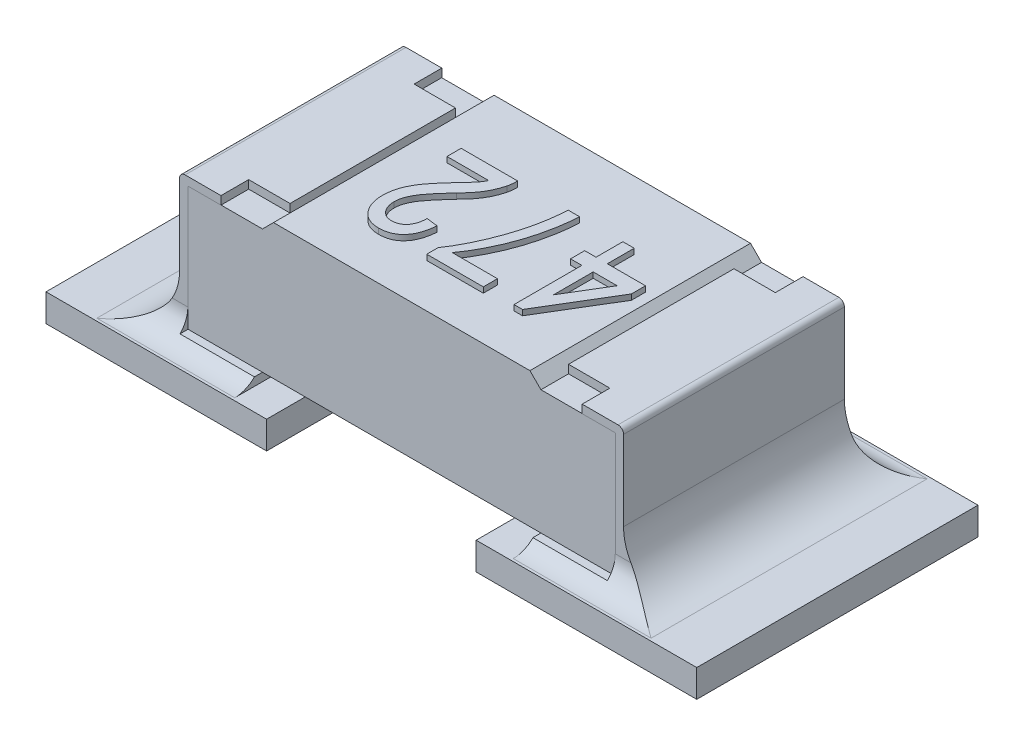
ISO-10303-21;
HEADER;
FILE_DESCRIPTION(('STEP AP214'),'2;1');
FILE_NAME('part.step','',(''),(''),'','','');
FILE_SCHEMA(('AUTOMOTIVE_DESIGN { 1 0 10303 214 1 1 1 1 }'));
ENDSEC;
DATA;
#1=APPLICATION_CONTEXT('core data for automotive mechanical design processes');
#2=APPLICATION_PROTOCOL_DEFINITION('international standard','automotive_design',2000,#1);
#3=PRODUCT_CONTEXT('',#1,'mechanical');
#4=PRODUCT('Part','Part','',(#3));
#5=PRODUCT_RELATED_PRODUCT_CATEGORY('part','',(#4));
#6=PRODUCT_DEFINITION_FORMATION('','',#4);
#7=PRODUCT_DEFINITION_CONTEXT('part definition',#1,'design');
#8=PRODUCT_DEFINITION('design','',#6,#7);
#9=PRODUCT_DEFINITION_SHAPE('','',#8);
#10=(LENGTH_UNIT() NAMED_UNIT(*) SI_UNIT(.MILLI.,.METRE.));
#11=(NAMED_UNIT(*) PLANE_ANGLE_UNIT() SI_UNIT($,.RADIAN.));
#12=(NAMED_UNIT(*) SI_UNIT($,.STERADIAN.) SOLID_ANGLE_UNIT());
#13=UNCERTAINTY_MEASURE_WITH_UNIT(LENGTH_MEASURE(1.E-05),#10,'distance_accuracy_value','');
#14=(GEOMETRIC_REPRESENTATION_CONTEXT(3) GLOBAL_UNCERTAINTY_ASSIGNED_CONTEXT((#13)) GLOBAL_UNIT_ASSIGNED_CONTEXT((#10,
#11,#12)) REPRESENTATION_CONTEXT('',''));
#15=CARTESIAN_POINT('',(0.,0.,0.));
#16=DIRECTION('',(0.,0.,1.));
#17=DIRECTION('',(1.,0.,0.));
#18=AXIS2_PLACEMENT_3D('',#15,#16,#17);
#19=CARTESIAN_POINT('',(-0.465,0.619999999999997,0.4));
#20=DIRECTION('',(0.,-1.,0.));
#21=DIRECTION('',(0.,0.,-1.));
#22=AXIS2_PLACEMENT_3D('',#19,#20,#21);
#23=PLANE('',#22);
#24=CARTESIAN_POINT('',(-0.247272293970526,0.619999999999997,-0.0280239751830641));
#25=CARTESIAN_POINT('',(-0.244549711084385,0.619999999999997,-0.0308835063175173));
#26=CARTESIAN_POINT('',(-0.239338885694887,0.619999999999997,-0.0363564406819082));
#27=CARTESIAN_POINT('',(-0.231845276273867,0.619999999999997,-0.0441720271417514));
#28=CARTESIAN_POINT('',(-0.225257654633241,0.619999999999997,-0.0514136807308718));
#29=CARTESIAN_POINT('',(-0.219283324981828,0.619999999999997,-0.0577852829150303));
#30=CARTESIAN_POINT('',(-0.214172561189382,0.619999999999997,-0.063514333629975));
#31=CARTESIAN_POINT('',(-0.209712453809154,0.619999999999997,-0.0684409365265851));
#32=CARTESIAN_POINT('',(-0.206158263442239,0.619999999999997,-0.0727824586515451));
#33=CARTESIAN_POINT('',(-0.200667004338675,0.619999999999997,-0.0794074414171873));
#34=CARTESIAN_POINT('',(-0.1938610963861,0.619999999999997,-0.0889475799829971));
#35=CARTESIAN_POINT('',(-0.188989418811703,0.619999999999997,-0.0978729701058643));
#36=CARTESIAN_POINT('',(-0.186615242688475,0.619999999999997,-0.102222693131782));
#37=B_SPLINE_CURVE_WITH_KNOTS('',3,(#24,#25,#26,#27,#28,#29,#30,#31,#32,#33,#34,#35,#36),
.UNSPECIFIED.,.F.,.F.,(4,1,1,1,1,1,1,1,1,1,4),(0.,0.12314411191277,0.235688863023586,
0.337675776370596,0.428456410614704,0.508083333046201,0.577123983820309,0.63567919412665,
0.683037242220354,0.845530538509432,1.),.UNSPECIFIED.);
#38=CARTESIAN_POINT('',(-0.247272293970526,0.619999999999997,-0.0280239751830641));
#39=VERTEX_POINT('',#38);
#40=CARTESIAN_POINT('',(-0.186615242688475,0.619999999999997,-0.102222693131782));
#41=VERTEX_POINT('',#40);
#42=EDGE_CURVE('E588',#39,#41,#37,.T.);
#43=ORIENTED_EDGE('',*,*,#42,.T.);
#44=DIRECTION('',(-1.,0.,0.));
#45=VECTOR('',#44,1.);
#46=CARTESIAN_POINT('',(-0.186615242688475,0.619999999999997,-0.102222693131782));
#47=LINE('',#46,#45);
#48=CARTESIAN_POINT('',(-0.338057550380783,0.619999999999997,-0.102222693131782));
#49=VERTEX_POINT('',#48);
#50=EDGE_CURVE('E570',#41,#49,#47,.T.);
#51=ORIENTED_EDGE('',*,*,#50,.T.);
#52=DIRECTION('',(0.,0.,-1.));
#53=VECTOR('',#52,1.);
#54=CARTESIAN_POINT('',(-0.338057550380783,0.619999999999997,-0.102222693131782));
#55=LINE('',#54,#53);
#56=CARTESIAN_POINT('',(-0.338057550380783,0.619999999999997,-0.153504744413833));
#57=VERTEX_POINT('',#56);
#58=EDGE_CURVE('E581',#49,#57,#55,.T.);
#59=ORIENTED_EDGE('',*,*,#58,.T.);
#60=DIRECTION('',(1.,0.,0.));
#61=VECTOR('',#60,1.);
#62=CARTESIAN_POINT('',(-0.338057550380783,0.619999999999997,-0.153504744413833));
#63=LINE('',#62,#61);
#64=CARTESIAN_POINT('',(-0.132929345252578,0.619999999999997,-0.153504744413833));
#65=VERTEX_POINT('',#64);
#66=EDGE_CURVE('E42',#57,#65,#63,.T.);
#67=ORIENTED_EDGE('',*,*,#66,.T.);
#68=CARTESIAN_POINT('',(-0.132929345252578,0.619999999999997,-0.153504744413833));
#69=CARTESIAN_POINT('',(-0.132917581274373,0.619999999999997,-0.150485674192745));
#70=CARTESIAN_POINT('',(-0.132894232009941,0.619999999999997,-0.144493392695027));
#71=CARTESIAN_POINT('',(-0.133535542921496,0.619999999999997,-0.135600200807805));
#72=CARTESIAN_POINT('',(-0.134821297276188,0.619999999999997,-0.126872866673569));
#73=CARTESIAN_POINT('',(-0.136123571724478,0.619999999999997,-0.121178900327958));
#74=CARTESIAN_POINT('',(-0.136775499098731,0.619999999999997,-0.118328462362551));
#75=B_SPLINE_CURVE_WITH_KNOTS('',3,(#68,#69,#70,#71,#72,#73,#74),.UNSPECIFIED.,.F.,.F.,(4,1,1,1,
4),(0.,0.255137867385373,0.506400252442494,0.752900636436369,1.),.UNSPECIFIED.);
#76=CARTESIAN_POINT('',(-0.136775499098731,0.619999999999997,-0.118328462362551));
#77=VERTEX_POINT('',#76);
#78=EDGE_CURVE('E592',#65,#77,#75,.T.);
#79=ORIENTED_EDGE('',*,*,#78,.T.);
#80=CARTESIAN_POINT('',(-0.136775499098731,0.619999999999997,-0.118328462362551));
#81=CARTESIAN_POINT('',(-0.13800865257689,0.619999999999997,-0.113710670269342));
#82=CARTESIAN_POINT('',(-0.140498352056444,0.619999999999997,-0.104387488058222));
#83=CARTESIAN_POINT('',(-0.145639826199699,0.619999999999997,-0.090785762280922));
#84=CARTESIAN_POINT('',(-0.151559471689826,0.619999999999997,-0.077250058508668));
#85=CARTESIAN_POINT('',(-0.157488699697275,0.619999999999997,-0.0662258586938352));
#86=CARTESIAN_POINT('',(-0.162736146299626,0.619999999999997,-0.057241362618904));
#87=CARTESIAN_POINT('',(-0.167462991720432,0.619999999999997,-0.0504023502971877));
#88=CARTESIAN_POINT('',(-0.172539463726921,0.619999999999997,-0.0432145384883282));
#89=CARTESIAN_POINT('',(-0.178370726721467,0.619999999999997,-0.0359777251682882));
#90=CARTESIAN_POINT('',(-0.184614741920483,0.619999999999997,-0.0284168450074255));
#91=CARTESIAN_POINT('',(-0.191411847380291,0.619999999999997,-0.0206273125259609));
#92=CARTESIAN_POINT('',(-0.198893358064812,0.619999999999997,-0.0127401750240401));
#93=CARTESIAN_POINT('',(-0.204076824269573,0.619999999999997,-0.00742474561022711));
#94=CARTESIAN_POINT('',(-0.206727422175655,0.619999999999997,-0.00470666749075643));
#95=B_SPLINE_CURVE_WITH_KNOTS('',3,(#80,#81,#82,#83,#84,#85,#86,#87,#88,#89,#90,#91,#92,#93,
#94),.UNSPECIFIED.,.F.,.F.,(4,1,1,1,1,1,1,1,1,1,1,1,4),(0.,0.105958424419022,0.213926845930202,
0.322146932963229,0.433460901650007,0.491377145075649,0.552833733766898,0.617780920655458,
0.686529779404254,0.75889780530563,0.835309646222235,0.915784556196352,1.),.UNSPECIFIED.);
#96=CARTESIAN_POINT('',(-0.206727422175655,0.619999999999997,-0.00470666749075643));
#97=VERTEX_POINT('',#96);
#98=EDGE_CURVE('E597',#77,#97,#95,.T.);
#99=ORIENTED_EDGE('',*,*,#98,.T.);
#100=CARTESIAN_POINT('',(-0.206727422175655,0.619999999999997,-0.00470666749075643));
#101=CARTESIAN_POINT('',(-0.210832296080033,0.619999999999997,-0.000289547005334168));
#102=CARTESIAN_POINT('',(-0.218736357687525,0.619999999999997,0.00821575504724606));
#103=CARTESIAN_POINT('',(-0.229839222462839,0.619999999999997,0.0207465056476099));
#104=CARTESIAN_POINT('',(-0.240007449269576,0.619999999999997,0.0323590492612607));
#105=CARTESIAN_POINT('',(-0.249036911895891,0.619999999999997,0.0432550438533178));
#106=CARTESIAN_POINT('',(-0.257079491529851,0.619999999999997,0.0533125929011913));
#107=CARTESIAN_POINT('',(-0.263982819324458,0.619999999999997,0.0626266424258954));
#108=CARTESIAN_POINT('',(-0.2698590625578,0.619999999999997,0.0711108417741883));
#109=CARTESIAN_POINT('',(-0.276204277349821,0.619999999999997,0.0811794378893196));
#110=CARTESIAN_POINT('',(-0.282391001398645,0.619999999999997,0.0932305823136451));
#111=CARTESIAN_POINT('',(-0.287886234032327,0.619999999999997,0.107518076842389));
#112=CARTESIAN_POINT('',(-0.291278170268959,0.619999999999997,0.121630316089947));
#113=CARTESIAN_POINT('',(-0.291698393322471,0.619999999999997,0.131013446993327));
#114=CARTESIAN_POINT('',(-0.291903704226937,0.619999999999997,0.135597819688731));
#115=B_SPLINE_CURVE_WITH_KNOTS('',3,(#100,#101,#102,#103,#104,#105,#106,#107,#108,#109,#110,
#111,#112,#113,#114),.UNSPECIFIED.,.F.,.F.,(4,1,1,1,1,1,1,1,1,1,1,1,4),(0.,0.107782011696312,
0.207537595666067,0.299250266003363,0.383669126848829,0.460468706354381,0.529410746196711,
0.590858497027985,0.644907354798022,0.74206184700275,0.832418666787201,0.918123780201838,1.),.UNSPECIFIED.);
#116=CARTESIAN_POINT('',(-0.291903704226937,0.619999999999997,0.135597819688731));
#117=VERTEX_POINT('',#116);
#118=EDGE_CURVE('E605',#97,#117,#115,.T.);
#119=ORIENTED_EDGE('',*,*,#118,.T.);
#120=CARTESIAN_POINT('',(-0.291903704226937,0.619999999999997,0.135597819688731));
#121=CARTESIAN_POINT('',(-0.291734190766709,0.619999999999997,0.139995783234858));
#122=CARTESIAN_POINT('',(-0.291405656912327,0.619999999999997,0.148519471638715));
#123=CARTESIAN_POINT('',(-0.288422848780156,0.619999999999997,0.160751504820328));
#124=CARTESIAN_POINT('',(-0.28359994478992,0.619999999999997,0.171907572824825));
#125=CARTESIAN_POINT('',(-0.277919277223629,0.619999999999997,0.180163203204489));
#126=CARTESIAN_POINT('',(-0.272658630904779,0.619999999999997,0.186012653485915));
#127=CARTESIAN_POINT('',(-0.268333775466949,0.619999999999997,0.189822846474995));
#128=CARTESIAN_POINT('',(-0.263800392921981,0.619999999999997,0.193120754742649));
#129=CARTESIAN_POINT('',(-0.258938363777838,0.619999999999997,0.195811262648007));
#130=CARTESIAN_POINT('',(-0.253751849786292,0.619999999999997,0.197809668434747));
#131=CARTESIAN_POINT('',(-0.248294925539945,0.619999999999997,0.199239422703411));
#132=CARTESIAN_POINT('',(-0.242548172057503,0.619999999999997,0.200152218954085));
#133=CARTESIAN_POINT('',(-0.238621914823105,0.619999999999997,0.200277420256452));
#134=CARTESIAN_POINT('',(-0.236615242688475,0.619999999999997,0.200341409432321));
#135=B_SPLINE_CURVE_WITH_KNOTS('',3,(#120,#121,#122,#123,#124,#125,#126,#127,#128,#129,#130,
#131,#132,#133,#134),.UNSPECIFIED.,.F.,.F.,(4,1,1,1,1,1,1,1,1,1,1,1,4),(0.,0.138524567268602,
0.268474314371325,0.394467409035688,0.519941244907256,0.58255786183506,0.642232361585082,
0.701381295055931,0.759066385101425,0.816947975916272,0.876204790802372,0.936729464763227,1.),.UNSPECIFIED.);
#136=CARTESIAN_POINT('',(-0.236615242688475,0.619999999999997,0.200341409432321));
#137=VERTEX_POINT('',#136);
#138=EDGE_CURVE('E613',#117,#137,#135,.T.);
#139=ORIENTED_EDGE('',*,*,#138,.T.);
#140=CARTESIAN_POINT('',(-0.236615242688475,0.619999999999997,0.200341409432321));
#141=CARTESIAN_POINT('',(-0.234501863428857,0.619999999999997,0.200277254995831));
#142=CARTESIAN_POINT('',(-0.230363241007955,0.619999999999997,0.200151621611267));
#143=CARTESIAN_POINT('',(-0.224324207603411,0.619999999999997,0.199243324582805));
#144=CARTESIAN_POINT('',(-0.218585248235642,0.619999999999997,0.197827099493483));
#145=CARTESIAN_POINT('',(-0.21317233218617,0.619999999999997,0.195728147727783));
#146=CARTESIAN_POINT('',(-0.208107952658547,0.619999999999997,0.192975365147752));
#147=CARTESIAN_POINT('',(-0.203354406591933,0.619999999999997,0.189667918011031));
#148=CARTESIAN_POINT('',(-0.1988961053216,0.619999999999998,0.185793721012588));
#149=CARTESIAN_POINT('',(-0.194856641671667,0.619999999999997,0.181296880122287));
#150=CARTESIAN_POINT('',(-0.191127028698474,0.619999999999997,0.176353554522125));
#151=CARTESIAN_POINT('',(-0.188026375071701,0.619999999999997,0.170818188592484));
#152=CARTESIAN_POINT('',(-0.185291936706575,0.619999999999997,0.164905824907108));
#153=CARTESIAN_POINT('',(-0.183048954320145,0.619999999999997,0.158520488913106));
#154=CARTESIAN_POINT('',(-0.181261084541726,0.619999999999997,0.151692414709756));
#155=CARTESIAN_POINT('',(-0.180131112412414,0.619999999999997,0.144359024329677));
#156=CARTESIAN_POINT('',(-0.179283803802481,0.619999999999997,0.136605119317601));
#157=CARTESIAN_POINT('',(-0.179151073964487,0.619999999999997,0.131273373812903));
#158=CARTESIAN_POINT('',(-0.179083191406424,0.619999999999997,0.128546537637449));
#159=B_SPLINE_CURVE_WITH_KNOTS('',3,(#140,#141,#142,#143,#144,#145,#146,#147,#148,#149,#150,
#151,#152,#153,#154,#155,#156,#157,#158),.UNSPECIFIED.,.F.,.F.,(4,1,1,1,1,1,1,1,1,1,1,1,1,1,1,1,
4),(0.,0.0611925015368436,0.119833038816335,0.176496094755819,0.232092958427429,
0.287474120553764,0.34305483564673,0.399527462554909,0.45812205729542,0.517844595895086,
0.578486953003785,0.641486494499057,0.706325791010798,0.774248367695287,0.845595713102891,
0.921032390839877,1.),.UNSPECIFIED.);
#160=CARTESIAN_POINT('',(-0.179083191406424,0.619999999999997,0.128546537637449));
#161=VERTEX_POINT('',#160);
#162=EDGE_CURVE('E621',#137,#161,#159,.T.);
#163=ORIENTED_EDGE('',*,*,#162,.T.);
#164=DIRECTION('',(0.992277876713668,0.,0.124034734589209));
#165=VECTOR('',#164,1.);
#166=CARTESIAN_POINT('',(-0.179083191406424,0.619999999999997,0.128546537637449));
#167=LINE('',#166,#165);
#168=CARTESIAN_POINT('',(-0.138057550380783,0.619999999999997,0.133674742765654));
#169=VERTEX_POINT('',#168);
#170=EDGE_CURVE('E629',#161,#169,#167,.T.);
#171=ORIENTED_EDGE('',*,*,#170,.T.);
#172=CARTESIAN_POINT('',(-0.138057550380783,0.619999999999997,0.133674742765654));
#173=CARTESIAN_POINT('',(-0.138459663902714,0.619999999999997,0.138141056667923));
#174=CARTESIAN_POINT('',(-0.1392402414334,0.619999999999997,0.146811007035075));
#175=CARTESIAN_POINT('',(-0.141237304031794,0.619999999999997,0.159373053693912));
#176=CARTESIAN_POINT('',(-0.143969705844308,0.619999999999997,0.171092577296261));
#177=CARTESIAN_POINT('',(-0.147301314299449,0.619999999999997,0.182044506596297));
#178=CARTESIAN_POINT('',(-0.151389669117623,0.619999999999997,0.192187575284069));
#179=CARTESIAN_POINT('',(-0.156188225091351,0.619999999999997,0.201499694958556));
#180=CARTESIAN_POINT('',(-0.161667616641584,0.619999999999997,0.2099791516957));
#181=CARTESIAN_POINT('',(-0.167783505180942,0.619999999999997,0.217634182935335));
#182=CARTESIAN_POINT('',(-0.174492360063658,0.619999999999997,0.224469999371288));
#183=CARTESIAN_POINT('',(-0.18185444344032,0.619999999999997,0.230356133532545));
#184=CARTESIAN_POINT('',(-0.189768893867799,0.619999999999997,0.235381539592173));
#185=CARTESIAN_POINT('',(-0.198249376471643,0.619999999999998,0.239442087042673));
#186=CARTESIAN_POINT('',(-0.207277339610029,0.619999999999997,0.242613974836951));
#187=CARTESIAN_POINT('',(-0.216844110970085,0.619999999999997,0.244823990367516));
#188=CARTESIAN_POINT('',(-0.226985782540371,0.619999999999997,0.246219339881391));
#189=CARTESIAN_POINT('',(-0.233939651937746,0.619999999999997,0.246401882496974));
#190=CARTESIAN_POINT('',(-0.237496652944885,0.619999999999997,0.246495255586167));
#191=B_SPLINE_CURVE_WITH_KNOTS('',3,(#172,#173,#174,#175,#176,#177,#178,#179,#180,#181,#182,
#183,#184,#185,#186,#187,#188,#189,#190),.UNSPECIFIED.,.F.,.F.,(4,1,1,1,1,1,1,1,1,1,1,1,1,1,1,1,
4),(0.,0.0798844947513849,0.155070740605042,0.226409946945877,0.294147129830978,
0.358835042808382,0.42098573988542,0.480517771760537,0.538414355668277,0.595284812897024,
0.650803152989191,0.705990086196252,0.761969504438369,0.817959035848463,0.876136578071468,
0.936642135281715,1.),.UNSPECIFIED.);
#192=CARTESIAN_POINT('',(-0.237496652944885,0.619999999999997,0.246495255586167));
#193=VERTEX_POINT('',#192);
#194=EDGE_CURVE('E635',#169,#193,#191,.T.);
#195=ORIENTED_EDGE('',*,*,#194,.T.);
#196=CARTESIAN_POINT('',(-0.237496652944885,0.619999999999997,0.246495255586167));
#197=CARTESIAN_POINT('',(-0.241081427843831,0.619999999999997,0.246413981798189));
#198=CARTESIAN_POINT('',(-0.248098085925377,0.619999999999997,0.246254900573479));
#199=CARTESIAN_POINT('',(-0.2583047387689,0.619999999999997,0.244688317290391));
#200=CARTESIAN_POINT('',(-0.267941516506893,0.619999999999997,0.242187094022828));
#201=CARTESIAN_POINT('',(-0.27704412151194,0.619999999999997,0.238782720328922));
#202=CARTESIAN_POINT('',(-0.285511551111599,0.619999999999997,0.234220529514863));
#203=CARTESIAN_POINT('',(-0.293414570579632,0.619999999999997,0.228766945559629));
#204=CARTESIAN_POINT('',(-0.300696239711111,0.619999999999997,0.222248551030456));
#205=CARTESIAN_POINT('',(-0.307360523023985,0.619999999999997,0.214843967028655));
#206=CARTESIAN_POINT('',(-0.313341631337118,0.619999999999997,0.20669033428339));
#207=CARTESIAN_POINT('',(-0.318556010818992,0.619999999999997,0.19797971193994));
#208=CARTESIAN_POINT('',(-0.323072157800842,0.619999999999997,0.188866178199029));
#209=CARTESIAN_POINT('',(-0.326695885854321,0.619999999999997,0.179225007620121));
#210=CARTESIAN_POINT('',(-0.329491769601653,0.619999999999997,0.16911169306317));
#211=CARTESIAN_POINT('',(-0.331471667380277,0.619999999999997,0.158523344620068));
#212=CARTESIAN_POINT('',(-0.332714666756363,0.619999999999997,0.147459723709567));
#213=CARTESIAN_POINT('',(-0.332856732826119,0.619999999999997,0.139928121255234));
#214=CARTESIAN_POINT('',(-0.332929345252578,0.619999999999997,0.1360785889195));
#215=B_SPLINE_CURVE_WITH_KNOTS('',3,(#196,#197,#198,#199,#200,#201,#202,#203,#204,#205,#206,
#207,#208,#209,#210,#211,#212,#213,#214),.UNSPECIFIED.,.F.,.F.,(4,1,1,1,1,1,1,1,1,1,1,1,1,1,1,1,
4),(0.,0.0656119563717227,0.128425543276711,0.188577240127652,0.247718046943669,
0.305927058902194,0.364273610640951,0.423175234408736,0.484475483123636,0.546404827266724,
0.608063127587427,0.670191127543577,0.732423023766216,0.796389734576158,0.862105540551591,
0.929519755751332,1.),.UNSPECIFIED.);
#216=CARTESIAN_POINT('',(-0.332929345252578,0.619999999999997,0.1360785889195));
#217=VERTEX_POINT('',#216);
#218=EDGE_CURVE('E640',#193,#217,#215,.T.);
#219=ORIENTED_EDGE('',*,*,#218,.T.);
#220=CARTESIAN_POINT('',(-0.332929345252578,0.619999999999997,0.1360785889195));
#221=CARTESIAN_POINT('',(-0.332867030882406,0.619999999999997,0.132121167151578));
#222=CARTESIAN_POINT('',(-0.332742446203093,0.619999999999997,0.124209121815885));
#223=CARTESIAN_POINT('',(-0.331272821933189,0.619999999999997,0.112408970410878));
#224=CARTESIAN_POINT('',(-0.329144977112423,0.619999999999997,0.100673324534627));
#225=CARTESIAN_POINT('',(-0.326082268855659,0.619999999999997,0.0889874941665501));
#226=CARTESIAN_POINT('',(-0.321990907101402,0.619999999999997,0.0772127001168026));
#227=CARTESIAN_POINT('',(-0.316887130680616,0.619999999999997,0.0651849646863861));
#228=CARTESIAN_POINT('',(-0.310432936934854,0.619999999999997,0.0529197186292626));
#229=CARTESIAN_POINT('',(-0.304342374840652,0.619999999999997,0.0423895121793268));
#230=CARTESIAN_POINT('',(-0.298491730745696,0.619999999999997,0.0336802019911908));
#231=CARTESIAN_POINT('',(-0.293492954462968,0.619999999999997,0.0263957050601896));
#232=CARTESIAN_POINT('',(-0.287453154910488,0.619999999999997,0.0187892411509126));
#233=CARTESIAN_POINT('',(-0.280973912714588,0.619999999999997,0.0103924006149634));
#234=CARTESIAN_POINT('',(-0.273498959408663,0.619999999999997,0.00165147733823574));
#235=CARTESIAN_POINT('',(-0.265568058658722,0.619999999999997,-0.00789055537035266));
#236=CARTESIAN_POINT('',(-0.256616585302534,0.619999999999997,-0.0177353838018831));
#237=CARTESIAN_POINT('',(-0.25045024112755,0.619999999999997,-0.0245248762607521));
#238=CARTESIAN_POINT('',(-0.247272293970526,0.619999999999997,-0.0280239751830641));
#239=B_SPLINE_CURVE_WITH_KNOTS('',3,(#220,#221,#222,#223,#224,#225,#226,#227,#228,#229,#230,
#231,#232,#233,#234,#235,#236,#237,#238),.UNSPECIFIED.,.F.,.F.,(4,1,1,1,1,1,1,1,1,1,1,1,1,1,1,1,
4),(0.,0.062456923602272,0.124869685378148,0.187491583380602,0.250712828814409,
0.315402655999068,0.38418537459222,0.456809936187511,0.534135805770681,0.576130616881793,
0.622465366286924,0.673587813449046,0.729445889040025,0.78992772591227,0.855163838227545,
0.925355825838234,1.),.UNSPECIFIED.);
#240=EDGE_CURVE('E648',#217,#39,#239,.T.);
#241=ORIENTED_EDGE('',*,*,#240,.T.);
#242=EDGE_LOOP('',(#43,#51,#59,#67,#79,#99,#119,#139,#163,#171,#195,#219,#241));
#243=FACE_BOUND('',#242,.T.);
#244=CARTESIAN_POINT('',(0.0911732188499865,0.619999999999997,-0.153504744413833));
#245=CARTESIAN_POINT('',(0.0910715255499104,0.619999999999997,-0.149523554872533));
#246=CARTESIAN_POINT('',(0.0908624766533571,0.619999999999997,-0.141339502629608));
#247=CARTESIAN_POINT('',(0.0899180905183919,0.619999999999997,-0.128757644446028));
#248=CARTESIAN_POINT('',(0.0886422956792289,0.619999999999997,-0.115559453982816));
#249=CARTESIAN_POINT('',(0.0869691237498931,0.619999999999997,-0.101767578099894));
#250=CARTESIAN_POINT('',(0.0847801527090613,0.619999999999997,-0.0873697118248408));
#251=CARTESIAN_POINT('',(0.082121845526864,0.619999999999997,-0.072362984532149));
#252=CARTESIAN_POINT('',(0.0790923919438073,0.619999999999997,-0.0567264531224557));
#253=CARTESIAN_POINT('',(0.0743827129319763,0.619999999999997,-0.0351324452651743));
#254=CARTESIAN_POINT('',(0.0674933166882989,0.619999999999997,-0.00798593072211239));
#255=CARTESIAN_POINT('',(0.0576476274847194,0.619999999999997,0.0242375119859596));
#256=CARTESIAN_POINT('',(0.0460888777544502,0.619999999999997,0.0558134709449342));
#257=CARTESIAN_POINT('',(0.0351425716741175,0.619999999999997,0.081544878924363));
#258=CARTESIAN_POINT('',(0.0257542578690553,0.619999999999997,0.101563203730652));
#259=CARTESIAN_POINT('',(0.0186247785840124,0.619999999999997,0.116032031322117));
#260=CARTESIAN_POINT('',(0.0113421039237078,0.619999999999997,0.129863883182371));
#261=CARTESIAN_POINT('',(0.00397260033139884,0.619999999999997,0.143091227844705));
#262=CARTESIAN_POINT('',(-0.00348056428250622,0.619999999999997,0.155720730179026));
#263=CARTESIAN_POINT('',(-0.0111159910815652,0.619999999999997,0.167713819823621));
#264=CARTESIAN_POINT('',(-0.0187466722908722,0.619999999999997,0.179214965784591));
#265=CARTESIAN_POINT('',(-0.024127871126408,0.619999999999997,0.186500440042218));
#266=CARTESIAN_POINT('',(-0.0267754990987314,0.619999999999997,0.19008499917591));
#267=B_SPLINE_CURVE_WITH_KNOTS('',3,(#244,#245,#246,#247,#248,#249,#250,#251,#252,#253,#254,
#255,#256,#257,#258,#259,#260,#261,#262,#263,#264,#265,#266),.UNSPECIFIED.,.F.,.F.,(4,1,1,1,1,1,
1,1,1,1,1,1,1,1,1,1,1,1,1,1,4),(0.,0.0324446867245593,0.0666958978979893,0.102772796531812,
0.14048261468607,0.179878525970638,0.22141794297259,0.264653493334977,0.30964496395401,
0.40148694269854,0.492768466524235,0.584060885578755,0.675332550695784,0.720506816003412,
0.764206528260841,0.806746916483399,0.847860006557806,0.88757202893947,0.926212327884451,
0.963695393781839,1.),.UNSPECIFIED.);
#268=CARTESIAN_POINT('',(0.0911732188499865,0.619999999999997,-0.153504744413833));
#269=VERTEX_POINT('',#268);
#270=CARTESIAN_POINT('',(-0.0267754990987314,0.619999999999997,0.19008499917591));
#271=VERTEX_POINT('',#270);
#272=EDGE_CURVE('E1365',#269,#271,#267,.T.);
#273=ORIENTED_EDGE('',*,*,#272,.T.);
#274=DIRECTION('',(1.,0.,0.));
#275=VECTOR('',#274,1.);
#276=CARTESIAN_POINT('',(-0.0267754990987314,0.619999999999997,0.19008499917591));
#277=LINE('',#276,#275);
#278=CARTESIAN_POINT('',(0.137327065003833,0.619999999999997,0.19008499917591));
#279=VERTEX_POINT('',#278);
#280=EDGE_CURVE('E1411',#271,#279,#277,.T.);
#281=ORIENTED_EDGE('',*,*,#280,.T.);
#282=DIRECTION('',(0.,0.,1.));
#283=VECTOR('',#282,1.);
#284=CARTESIAN_POINT('',(0.137327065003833,0.619999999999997,0.19008499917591));
#285=LINE('',#284,#283);
#286=CARTESIAN_POINT('',(0.137327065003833,0.619999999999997,0.241367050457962));
#287=VERTEX_POINT('',#286);
#288=EDGE_CURVE('E1402',#279,#287,#285,.T.);
#289=ORIENTED_EDGE('',*,*,#288,.T.);
#290=DIRECTION('',(-1.,0.,0.));
#291=VECTOR('',#290,1.);
#292=CARTESIAN_POINT('',(0.137327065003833,0.619999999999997,0.241367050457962));
#293=LINE('',#292,#291);
#294=CARTESIAN_POINT('',(-0.0678011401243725,0.619999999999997,0.241367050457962));
#295=VERTEX_POINT('',#294);
#296=EDGE_CURVE('E50',#287,#295,#293,.T.);
#297=ORIENTED_EDGE('',*,*,#296,.T.);
#298=DIRECTION('',(0.,0.,-1.));
#299=VECTOR('',#298,1.);
#300=CARTESIAN_POINT('',(-0.0678011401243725,0.619999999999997,0.241367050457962));
#301=LINE('',#300,#299);
#302=CARTESIAN_POINT('',(-0.0678011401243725,0.619999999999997,0.199860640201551));
#303=VERTEX_POINT('',#302);
#304=EDGE_CURVE('E1399',#295,#303,#301,.T.);
#305=ORIENTED_EDGE('',*,*,#304,.T.);
#306=CARTESIAN_POINT('',(-0.0678011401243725,0.619999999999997,0.199860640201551));
#307=CARTESIAN_POINT('',(-0.0653181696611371,0.619999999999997,0.196325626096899));
#308=CARTESIAN_POINT('',(-0.0602244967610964,0.619999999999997,0.189073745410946));
#309=CARTESIAN_POINT('',(-0.0528889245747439,0.619999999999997,0.177582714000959));
#310=CARTESIAN_POINT('',(-0.0454948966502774,0.619999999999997,0.165344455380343));
#311=CARTESIAN_POINT('',(-0.0382462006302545,0.619999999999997,0.152223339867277));
#312=CARTESIAN_POINT('',(-0.0308458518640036,0.619999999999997,0.138400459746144));
#313=CARTESIAN_POINT('',(-0.0235624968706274,0.619999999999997,0.123725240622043));
#314=CARTESIAN_POINT('',(-0.0163878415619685,0.619999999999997,0.108214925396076));
#315=CARTESIAN_POINT('',(-0.00665003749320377,0.619999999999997,0.0866159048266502));
#316=CARTESIAN_POINT('',(0.0047525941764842,0.619999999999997,0.0588061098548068));
#317=CARTESIAN_POINT('',(0.0167322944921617,0.619999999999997,0.024749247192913));
#318=CARTESIAN_POINT('',(0.0271737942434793,0.619999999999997,-0.00975756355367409));
#319=CARTESIAN_POINT('',(0.0327664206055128,0.619999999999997,-0.0330954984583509));
#320=CARTESIAN_POINT('',(0.0355642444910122,0.619999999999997,-0.044770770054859));
#321=B_SPLINE_CURVE_WITH_KNOTS('',3,(#306,#307,#308,#309,#310,#311,#312,#313,#314,#315,#316,
#317,#318,#319,#320),.UNSPECIFIED.,.F.,.F.,(4,1,1,1,1,1,1,1,1,1,1,1,4),(0.,0.0485150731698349,
0.0995259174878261,0.153084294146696,0.209088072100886,0.267869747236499,0.329182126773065,
0.39306725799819,0.459805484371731,0.595291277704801,0.730497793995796,0.865176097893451,1.),.UNSPECIFIED.);
#322=CARTESIAN_POINT('',(0.0355642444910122,0.619999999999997,-0.044770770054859));
#323=VERTEX_POINT('',#322);
#324=EDGE_CURVE('E1376',#303,#323,#321,.T.);
#325=ORIENTED_EDGE('',*,*,#324,.T.);
#326=CARTESIAN_POINT('',(0.0355642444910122,0.619999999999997,-0.044770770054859));
#327=CARTESIAN_POINT('',(0.0373853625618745,0.619999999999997,-0.0532216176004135));
#328=CARTESIAN_POINT('',(0.0410976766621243,0.619999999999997,-0.0704485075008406));
#329=CARTESIAN_POINT('',(0.0451544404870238,0.619999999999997,-0.0971001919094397));
#330=CARTESIAN_POINT('',(0.0483336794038,0.619999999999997,-0.124897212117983));
#331=CARTESIAN_POINT('',(0.0495357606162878,0.619999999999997,-0.14385559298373));
#332=CARTESIAN_POINT('',(0.0501475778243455,0.619999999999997,-0.153504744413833));
#333=B_SPLINE_CURVE_WITH_KNOTS('',3,(#326,#327,#328,#329,#330,#331,#332),.UNSPECIFIED.,.F.,.F.,
(4,1,1,1,4),(0.,0.236069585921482,0.481223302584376,0.735960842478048,1.),.UNSPECIFIED.);
#334=CARTESIAN_POINT('',(0.0501475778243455,0.619999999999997,-0.153504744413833));
#335=VERTEX_POINT('',#334);
#336=EDGE_CURVE('E1374',#323,#335,#333,.T.);
#337=ORIENTED_EDGE('',*,*,#336,.T.);
#338=DIRECTION('',(1.,0.,0.));
#339=VECTOR('',#338,1.);
#340=CARTESIAN_POINT('',(0.0501475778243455,0.619999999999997,-0.153504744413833));
#341=LINE('',#340,#339);
#342=EDGE_CURVE('E1368',#335,#269,#341,.T.);
#343=ORIENTED_EDGE('',*,*,#342,.T.);
#344=EDGE_LOOP('',(#273,#281,#289,#297,#305,#325,#337,#343));
#345=FACE_BOUND('',#344,.T.);
#346=DIRECTION('',(0.,0.,-1.));
#347=VECTOR('',#346,1.);
#348=CARTESIAN_POINT('',(0.248609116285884,0.619999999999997,-0.0560688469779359));
#349=LINE('',#348,#347);
#350=CARTESIAN_POINT('',(0.248609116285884,0.619999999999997,-0.0560688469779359));
#351=VERTEX_POINT('',#350);
#352=CARTESIAN_POINT('',(0.248609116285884,0.619999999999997,-0.153504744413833));
#353=VERTEX_POINT('',#352);
#354=EDGE_CURVE('E795',#351,#353,#349,.T.);
#355=ORIENTED_EDGE('',*,*,#354,.T.);
#356=DIRECTION('',(1.,0.,0.));
#357=VECTOR('',#356,1.);
#358=CARTESIAN_POINT('',(0.248609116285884,0.619999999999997,-0.153504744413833));
#359=LINE('',#358,#357);
#360=CARTESIAN_POINT('',(0.289634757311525,0.619999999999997,-0.153504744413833));
#361=VERTEX_POINT('',#360);
#362=EDGE_CURVE('E765',#353,#361,#359,.T.);
#363=ORIENTED_EDGE('',*,*,#362,.T.);
#364=DIRECTION('',(0.,0.,1.));
#365=VECTOR('',#364,1.);
#366=CARTESIAN_POINT('',(0.289634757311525,0.619999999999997,-0.153504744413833));
#367=LINE('',#366,#365);
#368=CARTESIAN_POINT('',(0.289634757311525,0.619999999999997,-0.0560688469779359));
#369=VERTEX_POINT('',#368);
#370=EDGE_CURVE('E768',#361,#369,#367,.T.);
#371=ORIENTED_EDGE('',*,*,#370,.T.);
#372=DIRECTION('',(1.,0.,0.));
#373=VECTOR('',#372,1.);
#374=CARTESIAN_POINT('',(0.289634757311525,0.619999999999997,-0.0560688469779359));
#375=LINE('',#374,#373);
#376=CARTESIAN_POINT('',(0.428096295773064,0.619999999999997,-0.0560688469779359));
#377=VERTEX_POINT('',#376);
#378=EDGE_CURVE('E771',#369,#377,#375,.T.);
#379=ORIENTED_EDGE('',*,*,#378,.T.);
#380=DIRECTION('',(0.,0.,1.));
#381=VECTOR('',#380,1.);
#382=CARTESIAN_POINT('',(0.428096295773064,0.619999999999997,-0.0560688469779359));
#383=LINE('',#382,#381);
#384=CARTESIAN_POINT('',(0.428096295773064,0.619999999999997,-0.00478679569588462));
#385=VERTEX_POINT('',#384);
#386=EDGE_CURVE('E774',#377,#385,#383,.T.);
#387=ORIENTED_EDGE('',*,*,#386,.T.);
#388=DIRECTION('',(-0.517115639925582,0.,0.855915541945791));
#389=VECTOR('',#388,1.);
#390=CARTESIAN_POINT('',(0.428096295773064,0.619999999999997,-0.00478679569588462));
#391=LINE('',#390,#389);
#392=CARTESIAN_POINT('',(0.279378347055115,0.619999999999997,0.241367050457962));
#393=VERTEX_POINT('',#392);
#394=EDGE_CURVE('E777',#385,#393,#391,.T.);
#395=ORIENTED_EDGE('',*,*,#394,.T.);
#396=DIRECTION('',(-1.,0.,0.));
#397=VECTOR('',#396,1.);
#398=CARTESIAN_POINT('',(0.279378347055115,0.619999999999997,0.241367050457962));
#399=LINE('',#398,#397);
#400=CARTESIAN_POINT('',(0.248609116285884,0.619999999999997,0.241367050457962));
#401=VERTEX_POINT('',#400);
#402=EDGE_CURVE('E780',#393,#401,#399,.T.);
#403=ORIENTED_EDGE('',*,*,#402,.T.);
#404=DIRECTION('',(0.,0.,-1.));
#405=VECTOR('',#404,1.);
#406=CARTESIAN_POINT('',(0.248609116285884,0.619999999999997,0.241367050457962));
#407=LINE('',#406,#405);
#408=CARTESIAN_POINT('',(0.248609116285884,0.619999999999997,-0.00478679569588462));
#409=VERTEX_POINT('',#408);
#410=EDGE_CURVE('E783',#401,#409,#407,.T.);
#411=ORIENTED_EDGE('',*,*,#410,.T.);
#412=DIRECTION('',(-1.,0.,0.));
#413=VECTOR('',#412,1.);
#414=CARTESIAN_POINT('',(0.248609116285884,0.619999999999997,-0.00478679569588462));
#415=LINE('',#414,#413);
#416=CARTESIAN_POINT('',(0.207583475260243,0.619999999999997,-0.00478679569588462));
#417=VERTEX_POINT('',#416);
#418=EDGE_CURVE('E786',#409,#417,#415,.T.);
#419=ORIENTED_EDGE('',*,*,#418,.T.);
#420=DIRECTION('',(0.,0.,-1.));
#421=VECTOR('',#420,1.);
#422=CARTESIAN_POINT('',(0.207583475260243,0.619999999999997,-0.00478679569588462));
#423=LINE('',#422,#421);
#424=CARTESIAN_POINT('',(0.207583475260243,0.619999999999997,-0.0560688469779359));
#425=VERTEX_POINT('',#424);
#426=EDGE_CURVE('E789',#417,#425,#423,.T.);
#427=ORIENTED_EDGE('',*,*,#426,.T.);
#428=DIRECTION('',(1.,0.,0.));
#429=VECTOR('',#428,1.);
#430=CARTESIAN_POINT('',(0.207583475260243,0.619999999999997,-0.0560688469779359));
#431=LINE('',#430,#429);
#432=EDGE_CURVE('E792',#425,#351,#431,.T.);
#433=ORIENTED_EDGE('',*,*,#432,.T.);
#434=EDGE_LOOP('',(#355,#363,#371,#379,#387,#395,#403,#411,#419,#427,#433));
#435=FACE_BOUND('',#434,.T.);
#436=DIRECTION('',(-1.,0.,0.));
#437=VECTOR('',#436,1.);
#438=CARTESIAN_POINT('',(-0.465,0.619999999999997,-0.4));
#439=LINE('',#438,#437);
#440=CARTESIAN_POINT('',(0.465,0.619999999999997,-0.4));
#441=VERTEX_POINT('',#440);
#442=CARTESIAN_POINT('',(-0.465,0.619999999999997,-0.4));
#443=VERTEX_POINT('',#442);
#444=EDGE_CURVE('E916',#441,#443,#439,.T.);
#445=ORIENTED_EDGE('',*,*,#444,.T.);
#446=DIRECTION('',(0.,0.,-1.));
#447=VECTOR('',#446,1.);
#448=CARTESIAN_POINT('',(-0.465,0.619999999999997,0.4));
#449=LINE('',#448,#447);
#450=CARTESIAN_POINT('',(-0.465,0.619999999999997,0.4));
#451=VERTEX_POINT('',#450);
#452=EDGE_CURVE('E931',#451,#443,#449,.T.);
#453=ORIENTED_EDGE('',*,*,#452,.F.);
#454=DIRECTION('',(-1.,0.,0.));
#455=VECTOR('',#454,1.);
#456=CARTESIAN_POINT('',(-0.465,0.619999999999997,0.4));
#457=LINE('',#456,#455);
#458=CARTESIAN_POINT('',(0.465,0.619999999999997,0.4));
#459=VERTEX_POINT('',#458);
#460=EDGE_CURVE('E923',#459,#451,#457,.T.);
#461=ORIENTED_EDGE('',*,*,#460,.F.);
#462=DIRECTION('',(0.,0.,-1.));
#463=VECTOR('',#462,1.);
#464=CARTESIAN_POINT('',(0.465,0.619999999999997,0.4));
#465=LINE('',#464,#463);
#466=EDGE_CURVE('E934',#459,#441,#465,.T.);
#467=ORIENTED_EDGE('',*,*,#466,.T.);
#468=EDGE_LOOP('',(#445,#453,#461,#467));
#469=FACE_BOUND('',#468,.T.);
#470=ADVANCED_FACE('F27',(#243,#345,#435,#469),#23,.F.);
#471=CARTESIAN_POINT('',(0.775,0.579999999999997,0.4));
#472=DIRECTION('',(0.,-1.,0.));
#473=DIRECTION('',(0.,0.,-1.));
#474=AXIS2_PLACEMENT_3D('',#471,#472,#473);
#475=PLANE('',#474);
#476=DIRECTION('',(0.,0.,-1.));
#477=VECTOR('',#476,1.);
#478=CARTESIAN_POINT('',(0.505,0.579999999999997,0.4));
#479=LINE('',#478,#477);
#480=CARTESIAN_POINT('',(0.505,0.579999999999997,0.4));
#481=VERTEX_POINT('',#480);
#482=CARTESIAN_POINT('',(0.505,0.579999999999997,0.3));
#483=VERTEX_POINT('',#482);
#484=EDGE_CURVE('E938',#481,#483,#479,.T.);
#485=ORIENTED_EDGE('',*,*,#484,.F.);
#486=DIRECTION('',(-1.,0.,0.));
#487=VECTOR('',#486,1.);
#488=CARTESIAN_POINT('',(0.775,0.579999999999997,0.4));
#489=LINE('',#488,#487);
#490=CARTESIAN_POINT('',(0.655,0.579999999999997,0.4));
#491=VERTEX_POINT('',#490);
#492=EDGE_CURVE('E1133',#491,#481,#489,.T.);
#493=ORIENTED_EDGE('',*,*,#492,.F.);
#494=DIRECTION('',(0.,0.,-1.));
#495=VECTOR('',#494,1.);
#496=CARTESIAN_POINT('',(0.655,0.579999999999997,0.5));
#497=LINE('',#496,#495);
#498=CARTESIAN_POINT('',(0.655,0.579999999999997,0.3));
#499=VERTEX_POINT('',#498);
#500=EDGE_CURVE('E961',#491,#499,#497,.T.);
#501=ORIENTED_EDGE('',*,*,#500,.T.);
#502=DIRECTION('',(-1.,0.,0.));
#503=VECTOR('',#502,1.);
#504=CARTESIAN_POINT('',(0.505,0.579999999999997,0.3));
#505=LINE('',#504,#503);
#506=EDGE_CURVE('E964',#499,#483,#505,.T.);
#507=ORIENTED_EDGE('',*,*,#506,.T.);
#508=EDGE_LOOP('',(#485,#493,#501,#507));
#509=FACE_BOUND('',#508,.T.);
#510=ADVANCED_FACE('F1550',(#509),#475,.F.);
#511=CARTESIAN_POINT('',(0.505,0.579999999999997,-0.3));
#512=VERTEX_POINT('',#511);
#513=CARTESIAN_POINT('',(0.505,0.579999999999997,-0.4));
#514=VERTEX_POINT('',#513);
#515=EDGE_CURVE('E937',#512,#514,#479,.T.);
#516=ORIENTED_EDGE('',*,*,#515,.F.);
#517=DIRECTION('',(1.,0.,0.));
#518=VECTOR('',#517,1.);
#519=CARTESIAN_POINT('',(0.505,0.579999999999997,-0.3));
#520=LINE('',#519,#518);
#521=CARTESIAN_POINT('',(0.655,0.579999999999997,-0.3));
#522=VERTEX_POINT('',#521);
#523=EDGE_CURVE('E978',#512,#522,#520,.T.);
#524=ORIENTED_EDGE('',*,*,#523,.T.);
#525=DIRECTION('',(0.,0.,-1.));
#526=VECTOR('',#525,1.);
#527=CARTESIAN_POINT('',(0.655,0.579999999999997,-0.5));
#528=LINE('',#527,#526);
#529=CARTESIAN_POINT('',(0.655,0.579999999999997,-0.4));
#530=VERTEX_POINT('',#529);
#531=EDGE_CURVE('E982',#522,#530,#528,.T.);
#532=ORIENTED_EDGE('',*,*,#531,.T.);
#533=DIRECTION('',(-1.,0.,0.));
#534=VECTOR('',#533,1.);
#535=CARTESIAN_POINT('',(0.775,0.579999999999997,-0.4));
#536=LINE('',#535,#534);
#537=EDGE_CURVE('E1107',#530,#514,#536,.T.);
#538=ORIENTED_EDGE('',*,*,#537,.T.);
#539=EDGE_LOOP('',(#516,#524,#532,#538));
#540=FACE_BOUND('',#539,.T.);
#541=ADVANCED_FACE('F1555',(#540),#475,.F.);
#542=DIRECTION('',(0.,0.,-1.));
#543=VECTOR('',#542,1.);
#544=CARTESIAN_POINT('',(-0.505,0.579999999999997,0.4));
#545=LINE('',#544,#543);
#546=CARTESIAN_POINT('',(-0.505,0.579999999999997,-0.3));
#547=VERTEX_POINT('',#546);
#548=CARTESIAN_POINT('',(-0.505,0.579999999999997,-0.4));
#549=VERTEX_POINT('',#548);
#550=EDGE_CURVE('E928',#547,#549,#545,.T.);
#551=ORIENTED_EDGE('',*,*,#550,.T.);
#552=CARTESIAN_POINT('',(-0.655,0.579999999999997,-0.4));
#553=VERTEX_POINT('',#552);
#554=EDGE_CURVE('E1110',#549,#553,#536,.T.);
#555=ORIENTED_EDGE('',*,*,#554,.T.);
#556=DIRECTION('',(0.,0.,1.));
#557=VECTOR('',#556,1.);
#558=CARTESIAN_POINT('',(-0.655,0.579999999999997,-0.5));
#559=LINE('',#558,#557);
#560=CARTESIAN_POINT('',(-0.655,0.579999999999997,-0.3));
#561=VERTEX_POINT('',#560);
#562=EDGE_CURVE('E995',#553,#561,#559,.T.);
#563=ORIENTED_EDGE('',*,*,#562,.T.);
#564=DIRECTION('',(1.,0.,0.));
#565=VECTOR('',#564,1.);
#566=CARTESIAN_POINT('',(-0.505,0.579999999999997,-0.3));
#567=LINE('',#566,#565);
#568=EDGE_CURVE('E998',#561,#547,#567,.T.);
#569=ORIENTED_EDGE('',*,*,#568,.T.);
#570=EDGE_LOOP('',(#551,#555,#563,#569));
#571=FACE_BOUND('',#570,.T.);
#572=ADVANCED_FACE('F1958',(#571),#475,.F.);
#573=CARTESIAN_POINT('',(-0.505,0.579999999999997,0.4));
#574=VERTEX_POINT('',#573);
#575=CARTESIAN_POINT('',(-0.505,0.579999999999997,0.3));
#576=VERTEX_POINT('',#575);
#577=EDGE_CURVE('E929',#574,#576,#545,.T.);
#578=ORIENTED_EDGE('',*,*,#577,.T.);
#579=DIRECTION('',(-1.,0.,0.));
#580=VECTOR('',#579,1.);
#581=CARTESIAN_POINT('',(-0.505,0.579999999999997,0.3));
#582=LINE('',#581,#580);
#583=CARTESIAN_POINT('',(-0.655,0.579999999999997,0.3));
#584=VERTEX_POINT('',#583);
#585=EDGE_CURVE('E946',#576,#584,#582,.T.);
#586=ORIENTED_EDGE('',*,*,#585,.T.);
#587=DIRECTION('',(0.,0.,1.));
#588=VECTOR('',#587,1.);
#589=CARTESIAN_POINT('',(-0.655,0.579999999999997,0.5));
#590=LINE('',#589,#588);
#591=CARTESIAN_POINT('',(-0.655,0.579999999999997,0.4));
#592=VERTEX_POINT('',#591);
#593=EDGE_CURVE('E950',#584,#592,#590,.T.);
#594=ORIENTED_EDGE('',*,*,#593,.T.);
#595=EDGE_CURVE('E1128',#574,#592,#489,.T.);
#596=ORIENTED_EDGE('',*,*,#595,.F.);
#597=EDGE_LOOP('',(#578,#586,#594,#596));
#598=FACE_BOUND('',#597,.T.);
#599=ADVANCED_FACE('F1558',(#598),#475,.F.);
#600=CARTESIAN_POINT('',(0.775,0.13,0.399999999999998));
#601=DIRECTION('',(0.,1.,0.));
#602=DIRECTION('',(0.,0.,1.));
#603=AXIS2_PLACEMENT_3D('',#600,#601,#602);
#604=PLANE('',#603);
#605=DIRECTION('',(0.,0.,-1.));
#606=VECTOR('',#605,1.);
#607=CARTESIAN_POINT('',(0.505,0.13,0.4005));
#608=LINE('',#607,#606);
#609=CARTESIAN_POINT('',(0.505,0.13,0.399999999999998));
#610=VERTEX_POINT('',#609);
#611=CARTESIAN_POINT('',(0.505,0.13,-0.399999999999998));
#612=VERTEX_POINT('',#611);
#613=EDGE_CURVE('E1038',#610,#612,#608,.T.);
#614=ORIENTED_EDGE('',*,*,#613,.F.);
#615=DIRECTION('',(-1.,0.,0.));
#616=VECTOR('',#615,1.);
#617=CARTESIAN_POINT('',(0.775,0.13,0.399999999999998));
#618=LINE('',#617,#616);
#619=CARTESIAN_POINT('',(-0.504999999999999,0.13,0.399999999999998));
#620=VERTEX_POINT('',#619);
#621=EDGE_CURVE('E1140',#610,#620,#618,.T.);
#622=ORIENTED_EDGE('',*,*,#621,.T.);
#623=DIRECTION('',(0.,0.,-1.));
#624=VECTOR('',#623,1.);
#625=CARTESIAN_POINT('',(-0.505,0.13,0.4005));
#626=LINE('',#625,#624);
#627=CARTESIAN_POINT('',(-0.504999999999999,0.13,-0.399999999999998));
#628=VERTEX_POINT('',#627);
#629=EDGE_CURVE('E1098',#620,#628,#626,.T.);
#630=ORIENTED_EDGE('',*,*,#629,.T.);
#631=DIRECTION('',(-1.,0.,0.));
#632=VECTOR('',#631,1.);
#633=CARTESIAN_POINT('',(0.775,0.13,-0.399999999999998));
#634=LINE('',#633,#632);
#635=EDGE_CURVE('E1136',#612,#628,#634,.T.);
#636=ORIENTED_EDGE('',*,*,#635,.F.);
#637=EDGE_LOOP('',(#614,#622,#630,#636));
#638=FACE_BOUND('',#637,.T.);
#639=ADVANCED_FACE('F1949',(#638),#604,.F.);
#640=CARTESIAN_POINT('',(0.775,0.579999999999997,0.4));
#641=DIRECTION('',(0.,0.,-1.));
#642=DIRECTION('',(0.,1.,0.));
#643=AXIS2_PLACEMENT_3D('',#640,#641,#642);
#644=PLANE('',#643);
#645=DIRECTION('',(0.,-1.,0.));
#646=VECTOR('',#645,1.);
#647=CARTESIAN_POINT('',(-0.775,0.579999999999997,0.4));
#648=LINE('',#647,#646);
#649=CARTESIAN_POINT('',(-0.775,0.579999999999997,0.4));
#650=VERTEX_POINT('',#649);
#651=CARTESIAN_POINT('',(-0.775,0.13,0.399999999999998));
#652=VERTEX_POINT('',#651);
#653=EDGE_CURVE('E1119',#650,#652,#648,.T.);
#654=ORIENTED_EDGE('',*,*,#653,.T.);
#655=DIRECTION('',(-1.,0.,0.));
#656=VECTOR('',#655,1.);
#657=CARTESIAN_POINT('',(0.775,0.13,0.399999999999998));
#658=LINE('',#657,#656);
#659=EDGE_CURVE('E1116',#620,#652,#658,.T.);
#660=ORIENTED_EDGE('',*,*,#659,.F.);
#661=ORIENTED_EDGE('',*,*,#621,.F.);
#662=CARTESIAN_POINT('',(0.775,0.13,0.4));
#663=VERTEX_POINT('',#662);
#664=EDGE_CURVE('E1141',#663,#610,#618,.T.);
#665=ORIENTED_EDGE('',*,*,#664,.F.);
#666=DIRECTION('',(0.,-1.,0.));
#667=VECTOR('',#666,1.);
#668=CARTESIAN_POINT('',(0.775,0.579999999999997,0.4));
#669=LINE('',#668,#667);
#670=CARTESIAN_POINT('',(0.775,0.579999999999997,0.4));
#671=VERTEX_POINT('',#670);
#672=EDGE_CURVE('E1124',#671,#663,#669,.T.);
#673=ORIENTED_EDGE('',*,*,#672,.F.);
#674=EDGE_CURVE('E1129',#671,#491,#489,.T.);
#675=ORIENTED_EDGE('',*,*,#674,.T.);
#676=ORIENTED_EDGE('',*,*,#492,.T.);
#677=DIRECTION('',(-0.707106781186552,0.707106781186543,0.));
#678=VECTOR('',#677,1.);
#679=CARTESIAN_POINT('',(0.465,0.619999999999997,0.4));
#680=LINE('',#679,#678);
#681=EDGE_CURVE('E921',#481,#459,#680,.T.);
#682=ORIENTED_EDGE('',*,*,#681,.T.);
#683=ORIENTED_EDGE('',*,*,#460,.T.);
#684=DIRECTION('',(-0.707106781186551,-0.707106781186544,0.));
#685=VECTOR('',#684,1.);
#686=CARTESIAN_POINT('',(-0.505,0.579999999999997,0.4));
#687=LINE('',#686,#685);
#688=EDGE_CURVE('E925',#451,#574,#687,.T.);
#689=ORIENTED_EDGE('',*,*,#688,.T.);
#690=ORIENTED_EDGE('',*,*,#595,.T.);
#691=DIRECTION('',(1.,0.,0.));
#692=VECTOR('',#691,1.);
#693=CARTESIAN_POINT('',(0.775,0.579999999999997,0.4));
#694=LINE('',#693,#692);
#695=EDGE_CURVE('E1109',#650,#592,#694,.T.);
#696=ORIENTED_EDGE('',*,*,#695,.F.);
#697=EDGE_LOOP('',(#654,#660,#661,#665,#673,#675,#676,#682,#683,#689,#690,#696));
#698=FACE_BOUND('',#697,.T.);
#699=ADVANCED_FACE('F29',(#698),#644,.F.);
#700=CARTESIAN_POINT('',(0.775,0.579999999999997,-0.4));
#701=DIRECTION('',(0.,0.,1.));
#702=DIRECTION('',(0.,-1.,0.));
#703=AXIS2_PLACEMENT_3D('',#700,#701,#702);
#704=PLANE('',#703);
#705=DIRECTION('',(0.,1.,0.));
#706=VECTOR('',#705,1.);
#707=CARTESIAN_POINT('',(-0.775,0.579999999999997,-0.4));
#708=LINE('',#707,#706);
#709=CARTESIAN_POINT('',(-0.775,0.13,-0.399999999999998));
#710=VERTEX_POINT('',#709);
#711=CARTESIAN_POINT('',(-0.775,0.579999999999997,-0.4));
#712=VERTEX_POINT('',#711);
#713=EDGE_CURVE('E1121',#710,#712,#708,.T.);
#714=ORIENTED_EDGE('',*,*,#713,.T.);
#715=EDGE_CURVE('E1106',#553,#712,#536,.T.);
#716=ORIENTED_EDGE('',*,*,#715,.F.);
#717=ORIENTED_EDGE('',*,*,#554,.F.);
#718=DIRECTION('',(-0.707106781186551,-0.707106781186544,0.));
#719=VECTOR('',#718,1.);
#720=CARTESIAN_POINT('',(-0.505,0.579999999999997,-0.4));
#721=LINE('',#720,#719);
#722=EDGE_CURVE('E918',#443,#549,#721,.T.);
#723=ORIENTED_EDGE('',*,*,#722,.F.);
#724=ORIENTED_EDGE('',*,*,#444,.F.);
#725=DIRECTION('',(-0.707106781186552,0.707106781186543,0.));
#726=VECTOR('',#725,1.);
#727=CARTESIAN_POINT('',(0.465,0.619999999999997,-0.4));
#728=LINE('',#727,#726);
#729=EDGE_CURVE('E914',#514,#441,#728,.T.);
#730=ORIENTED_EDGE('',*,*,#729,.F.);
#731=ORIENTED_EDGE('',*,*,#537,.F.);
#732=DIRECTION('',(-1.,0.,0.));
#733=VECTOR('',#732,1.);
#734=CARTESIAN_POINT('',(0.775,0.579999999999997,-0.4));
#735=LINE('',#734,#733);
#736=CARTESIAN_POINT('',(0.775,0.579999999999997,-0.4));
#737=VERTEX_POINT('',#736);
#738=EDGE_CURVE('E1132',#737,#530,#735,.T.);
#739=ORIENTED_EDGE('',*,*,#738,.F.);
#740=DIRECTION('',(0.,1.,0.));
#741=VECTOR('',#740,1.);
#742=CARTESIAN_POINT('',(0.775,0.579999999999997,-0.4));
#743=LINE('',#742,#741);
#744=CARTESIAN_POINT('',(0.775,0.13,-0.4));
#745=VERTEX_POINT('',#744);
#746=EDGE_CURVE('E1126',#745,#737,#743,.T.);
#747=ORIENTED_EDGE('',*,*,#746,.F.);
#748=EDGE_CURVE('E1137',#745,#612,#634,.T.);
#749=ORIENTED_EDGE('',*,*,#748,.T.);
#750=ORIENTED_EDGE('',*,*,#635,.T.);
#751=DIRECTION('',(1.,0.,0.));
#752=VECTOR('',#751,1.);
#753=CARTESIAN_POINT('',(0.775,0.13,-0.399999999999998));
#754=LINE('',#753,#752);
#755=EDGE_CURVE('E1113',#710,#628,#754,.T.);
#756=ORIENTED_EDGE('',*,*,#755,.F.);
#757=EDGE_LOOP('',(#714,#716,#717,#723,#724,#730,#731,#739,#747,#749,#750,#756));
#758=FACE_BOUND('',#757,.T.);
#759=ADVANCED_FACE('F1937',(#758),#704,.F.);
#760=CARTESIAN_POINT('',(-0.775,0.13,0.4005));
#761=DIRECTION('',(-1.,0.,0.));
#762=DIRECTION('',(0.,-1.,0.));
#763=AXIS2_PLACEMENT_3D('',#760,#761,#762);
#764=PLANE('',#763);
#765=DIRECTION('',(0.,0.,-1.));
#766=VECTOR('',#765,1.);
#767=CARTESIAN_POINT('',(-0.775,0.13,0.4005));
#768=LINE('',#767,#766);
#769=CARTESIAN_POINT('',(-0.775,0.13,0.429085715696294));
#770=VERTEX_POINT('',#769);
#771=EDGE_CURVE('E1090',#770,#652,#768,.T.);
#772=ORIENTED_EDGE('',*,*,#771,.T.);
#773=ORIENTED_EDGE('',*,*,#653,.F.);
#774=DIRECTION('',(0.,0.,-1.));
#775=VECTOR('',#774,1.);
#776=CARTESIAN_POINT('',(-0.775,0.579999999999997,0.4005));
#777=LINE('',#776,#775);
#778=CARTESIAN_POINT('',(-0.775,0.579999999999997,0.4005));
#779=VERTEX_POINT('',#778);
#780=EDGE_CURVE('E1086',#779,#650,#777,.T.);
#781=ORIENTED_EDGE('',*,*,#780,.F.);
#782=DIRECTION('',(0.,1.,0.));
#783=VECTOR('',#782,1.);
#784=CARTESIAN_POINT('',(-0.775,0.13,0.4005));
#785=LINE('',#784,#783);
#786=CARTESIAN_POINT('',(-0.775,0.2,0.4005));
#787=VERTEX_POINT('',#786);
#788=EDGE_CURVE('E1076',#787,#779,#785,.T.);
#789=ORIENTED_EDGE('',*,*,#788,.F.);
#790=CARTESIAN_POINT('',(-0.775,0.2,0.5005));
#791=DIRECTION('',(-1.,0.,0.));
#792=DIRECTION('',(0.,-1.,0.));
#793=AXIS2_PLACEMENT_3D('',#790,#791,#792);
#794=CIRCLE('',#793,0.1);
#795=EDGE_CURVE('E2201',#787,#770,#794,.T.);
#796=ORIENTED_EDGE('',*,*,#795,.T.);
#797=EDGE_LOOP('',(#772,#773,#781,#789,#796));
#798=FACE_BOUND('',#797,.T.);
#799=ADVANCED_FACE('F1940',(#798),#764,.F.);
#800=CARTESIAN_POINT('',(-0.775,0.579999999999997,-0.4005));
#801=VERTEX_POINT('',#800);
#802=EDGE_CURVE('E1085',#712,#801,#777,.T.);
#803=ORIENTED_EDGE('',*,*,#802,.F.);
#804=ORIENTED_EDGE('',*,*,#713,.F.);
#805=CARTESIAN_POINT('',(-0.775,0.13,-0.429085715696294));
#806=VERTEX_POINT('',#805);
#807=EDGE_CURVE('E1089',#710,#806,#768,.T.);
#808=ORIENTED_EDGE('',*,*,#807,.T.);
#809=CARTESIAN_POINT('',(-0.775,0.2,-0.5005));
#810=DIRECTION('',(-1.,0.,0.));
#811=DIRECTION('',(0.,-1.,0.));
#812=AXIS2_PLACEMENT_3D('',#809,#810,#811);
#813=CIRCLE('',#812,0.1);
#814=CARTESIAN_POINT('',(-0.775,0.2,-0.4005));
#815=VERTEX_POINT('',#814);
#816=EDGE_CURVE('E1237',#806,#815,#813,.T.);
#817=ORIENTED_EDGE('',*,*,#816,.T.);
#818=DIRECTION('',(0.,1.,0.));
#819=VECTOR('',#818,1.);
#820=CARTESIAN_POINT('',(-0.775,0.13,-0.4005));
#821=LINE('',#820,#819);
#822=EDGE_CURVE('E1064',#815,#801,#821,.T.);
#823=ORIENTED_EDGE('',*,*,#822,.T.);
#824=EDGE_LOOP('',(#803,#804,#808,#817,#823));
#825=FACE_BOUND('',#824,.T.);
#826=ADVANCED_FACE('F2094',(#825),#764,.F.);
#827=CARTESIAN_POINT('',(-0.505,0.13,0.4005));
#828=DIRECTION('',(0.,-1.,0.));
#829=DIRECTION('',(0.,0.,-1.));
#830=AXIS2_PLACEMENT_3D('',#827,#828,#829);
#831=PLANE('',#830);
#832=CARTESIAN_POINT('',(-0.505,0.13,0.429085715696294));
#833=VERTEX_POINT('',#832);
#834=EDGE_CURVE('E1094',#833,#620,#626,.T.);
#835=ORIENTED_EDGE('',*,*,#834,.T.);
#836=ORIENTED_EDGE('',*,*,#659,.T.);
#837=ORIENTED_EDGE('',*,*,#771,.F.);
#838=DIRECTION('',(-1.,0.,0.));
#839=VECTOR('',#838,1.);
#840=CARTESIAN_POINT('',(-0.775,0.13,0.429085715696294));
#841=LINE('',#840,#839);
#842=EDGE_CURVE('E2204',#770,#833,#841,.F.);
#843=ORIENTED_EDGE('',*,*,#842,.T.);
#844=EDGE_LOOP('',(#835,#836,#837,#843));
#845=FACE_BOUND('',#844,.T.);
#846=ADVANCED_FACE('F2103',(#845),#831,.F.);
#847=ORIENTED_EDGE('',*,*,#807,.F.);
#848=ORIENTED_EDGE('',*,*,#755,.T.);
#849=CARTESIAN_POINT('',(-0.505,0.13,-0.429085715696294));
#850=VERTEX_POINT('',#849);
#851=EDGE_CURVE('E1093',#628,#850,#626,.T.);
#852=ORIENTED_EDGE('',*,*,#851,.T.);
#853=DIRECTION('',(1.,0.,0.));
#854=VECTOR('',#853,1.);
#855=CARTESIAN_POINT('',(-0.505,0.13,-0.429085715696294));
#856=LINE('',#855,#854);
#857=EDGE_CURVE('E2214',#850,#806,#856,.F.);
#858=ORIENTED_EDGE('',*,*,#857,.T.);
#859=EDGE_LOOP('',(#847,#848,#852,#858));
#860=FACE_BOUND('',#859,.T.);
#861=ADVANCED_FACE('F2061',(#860),#831,.F.);
#862=CARTESIAN_POINT('',(-0.775,0.579999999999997,0.4005));
#863=DIRECTION('',(0.,1.,0.));
#864=DIRECTION('',(0.,0.,1.));
#865=AXIS2_PLACEMENT_3D('',#862,#863,#864);
#866=PLANE('',#865);
#867=ORIENTED_EDGE('',*,*,#695,.T.);
#868=CARTESIAN_POINT('',(-0.655,0.579999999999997,0.4005));
#869=VERTEX_POINT('',#868);
#870=EDGE_CURVE('E949',#592,#869,#590,.T.);
#871=ORIENTED_EDGE('',*,*,#870,.T.);
#872=DIRECTION('',(1.,0.,0.));
#873=VECTOR('',#872,1.);
#874=CARTESIAN_POINT('',(-0.775,0.579999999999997,0.4005));
#875=LINE('',#874,#873);
#876=EDGE_CURVE('E1078',#779,#869,#875,.T.);
#877=ORIENTED_EDGE('',*,*,#876,.F.);
#878=ORIENTED_EDGE('',*,*,#780,.T.);
#879=EDGE_LOOP('',(#867,#871,#877,#878));
#880=FACE_BOUND('',#879,.T.);
#881=ADVANCED_FACE('F2053',(#880),#866,.F.);
#882=DIRECTION('',(1.,0.,0.));
#883=VECTOR('',#882,1.);
#884=CARTESIAN_POINT('',(-0.775,0.579999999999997,-0.4005));
#885=LINE('',#884,#883);
#886=CARTESIAN_POINT('',(-0.655,0.579999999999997,-0.4005));
#887=VERTEX_POINT('',#886);
#888=EDGE_CURVE('E1066',#801,#887,#885,.T.);
#889=ORIENTED_EDGE('',*,*,#888,.T.);
#890=EDGE_CURVE('E997',#887,#553,#559,.T.);
#891=ORIENTED_EDGE('',*,*,#890,.T.);
#892=ORIENTED_EDGE('',*,*,#715,.T.);
#893=ORIENTED_EDGE('',*,*,#802,.T.);
#894=EDGE_LOOP('',(#889,#891,#892,#893));
#895=FACE_BOUND('',#894,.T.);
#896=ADVANCED_FACE('F2044',(#895),#866,.F.);
#897=CARTESIAN_POINT('',(-0.785,0.609999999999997,0.4005));
#898=DIRECTION('',(0.,-1.,0.));
#899=DIRECTION('',(0.,0.,-1.));
#900=AXIS2_PLACEMENT_3D('',#897,#898,#899);
#901=PLANE('',#900);
#902=DIRECTION('',(-1.,0.,0.));
#903=VECTOR('',#902,1.);
#904=CARTESIAN_POINT('',(-0.785,0.609999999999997,0.4005));
#905=LINE('',#904,#903);
#906=CARTESIAN_POINT('',(-0.655,0.609999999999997,0.4005));
#907=VERTEX_POINT('',#906);
#908=CARTESIAN_POINT('',(-0.785,0.609999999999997,0.4005));
#909=VERTEX_POINT('',#908);
#910=EDGE_CURVE('E1069',#907,#909,#905,.T.);
#911=ORIENTED_EDGE('',*,*,#910,.F.);
#912=DIRECTION('',(0.,0.,1.));
#913=VECTOR('',#912,1.);
#914=CARTESIAN_POINT('',(-0.655,0.609999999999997,0.5));
#915=LINE('',#914,#913);
#916=CARTESIAN_POINT('',(-0.655,0.609999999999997,0.3));
#917=VERTEX_POINT('',#916);
#918=EDGE_CURVE('E944',#917,#907,#915,.T.);
#919=ORIENTED_EDGE('',*,*,#918,.F.);
#920=DIRECTION('',(-1.,0.,0.));
#921=VECTOR('',#920,1.);
#922=CARTESIAN_POINT('',(-0.505,0.609999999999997,0.3));
#923=LINE('',#922,#921);
#924=CARTESIAN_POINT('',(-0.505,0.609999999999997,0.3));
#925=VERTEX_POINT('',#924);
#926=EDGE_CURVE('E941',#925,#917,#923,.T.);
#927=ORIENTED_EDGE('',*,*,#926,.F.);
#928=DIRECTION('',(0.,0.,-1.));
#929=VECTOR('',#928,1.);
#930=CARTESIAN_POINT('',(-0.505,0.609999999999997,0.4005));
#931=LINE('',#930,#929);
#932=CARTESIAN_POINT('',(-0.505,0.609999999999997,-0.3));
#933=VERTEX_POINT('',#932);
#934=EDGE_CURVE('E1081',#925,#933,#931,.T.);
#935=ORIENTED_EDGE('',*,*,#934,.T.);
#936=DIRECTION('',(1.,0.,0.));
#937=VECTOR('',#936,1.);
#938=CARTESIAN_POINT('',(-0.505,0.609999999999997,-0.3));
#939=LINE('',#938,#937);
#940=CARTESIAN_POINT('',(-0.655,0.609999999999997,-0.3));
#941=VERTEX_POINT('',#940);
#942=EDGE_CURVE('E992',#941,#933,#939,.T.);
#943=ORIENTED_EDGE('',*,*,#942,.F.);
#944=DIRECTION('',(0.,0.,1.));
#945=VECTOR('',#944,1.);
#946=CARTESIAN_POINT('',(-0.655,0.609999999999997,-0.5));
#947=LINE('',#946,#945);
#948=CARTESIAN_POINT('',(-0.655,0.609999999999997,-0.4005));
#949=VERTEX_POINT('',#948);
#950=EDGE_CURVE('E988',#949,#941,#947,.T.);
#951=ORIENTED_EDGE('',*,*,#950,.F.);
#952=DIRECTION('',(-1.,0.,0.));
#953=VECTOR('',#952,1.);
#954=CARTESIAN_POINT('',(-0.785,0.609999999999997,-0.4005));
#955=LINE('',#954,#953);
#956=CARTESIAN_POINT('',(-0.785,0.609999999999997,-0.4005));
#957=VERTEX_POINT('',#956);
#958=EDGE_CURVE('E1057',#949,#957,#955,.T.);
#959=ORIENTED_EDGE('',*,*,#958,.T.);
#960=DIRECTION('',(0.,0.,-1.));
#961=VECTOR('',#960,1.);
#962=CARTESIAN_POINT('',(-0.785,0.609999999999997,0.4005));
#963=LINE('',#962,#961);
#964=EDGE_CURVE('E1103',#909,#957,#963,.T.);
#965=ORIENTED_EDGE('',*,*,#964,.F.);
#966=EDGE_LOOP('',(#911,#919,#927,#935,#943,#951,#959,#965));
#967=FACE_BOUND('',#966,.T.);
#968=ADVANCED_FACE('F2039',(#967),#901,.F.);
#969=CARTESIAN_POINT('',(-0.785,0.589999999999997,0.4005));
#970=DIRECTION('',(0.,0.,-1.));
#971=DIRECTION('',(-1.,0.,0.));
#972=AXIS2_PLACEMENT_3D('',#969,#970,#971);
#973=CYLINDRICAL_SURFACE('',#972,0.0200000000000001);
#974=CARTESIAN_POINT('',(-0.785,0.589999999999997,-0.4005));
#975=DIRECTION('',(0.,0.,1.));
#976=DIRECTION('',(1.,0.,0.));
#977=AXIS2_PLACEMENT_3D('',#974,#975,#976);
#978=CIRCLE('',#977,0.0200000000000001);
#979=CARTESIAN_POINT('',(-0.805,0.589999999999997,-0.4005));
#980=VERTEX_POINT('',#979);
#981=EDGE_CURVE('E1059',#957,#980,#978,.T.);
#982=ORIENTED_EDGE('',*,*,#981,.T.);
#983=DIRECTION('',(0.,0.,-1.));
#984=VECTOR('',#983,1.);
#985=CARTESIAN_POINT('',(-0.805,0.589999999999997,0.4005));
#986=LINE('',#985,#984);
#987=CARTESIAN_POINT('',(-0.805,0.589999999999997,0.4005));
#988=VERTEX_POINT('',#987);
#989=EDGE_CURVE('E1100',#988,#980,#986,.T.);
#990=ORIENTED_EDGE('',*,*,#989,.F.);
#991=CARTESIAN_POINT('',(-0.785,0.589999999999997,0.4005));
#992=DIRECTION('',(0.,0.,1.));
#993=DIRECTION('',(1.,0.,0.));
#994=AXIS2_PLACEMENT_3D('',#991,#992,#993);
#995=CIRCLE('',#994,0.0200000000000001);
#996=EDGE_CURVE('E1071',#909,#988,#995,.T.);
#997=ORIENTED_EDGE('',*,*,#996,.F.);
#998=ORIENTED_EDGE('',*,*,#964,.T.);
#999=EDGE_LOOP('',(#982,#990,#997,#998));
#1000=FACE_BOUND('',#999,.T.);
#1001=ADVANCED_FACE('F2043',(#1000),#973,.T.);
#1002=CARTESIAN_POINT('',(-0.805,0.589999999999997,0.4005));
#1003=DIRECTION('',(1.,0.,0.));
#1004=DIRECTION('',(0.,0.,-1.));
#1005=AXIS2_PLACEMENT_3D('',#1002,#1003,#1004);
#1006=PLANE('',#1005);
#1007=DIRECTION('',(0.,-1.,0.));
#1008=VECTOR('',#1007,1.);
#1009=CARTESIAN_POINT('',(-0.805,0.589999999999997,-0.4005));
#1010=LINE('',#1009,#1008);
#1011=CARTESIAN_POINT('',(-0.805,0.3,-0.4005));
#1012=VERTEX_POINT('',#1011);
#1013=EDGE_CURVE('E1061',#980,#1012,#1010,.T.);
#1014=ORIENTED_EDGE('',*,*,#1013,.T.);
#1015=DIRECTION('',(0.,0.,-1.));
#1016=VECTOR('',#1015,1.);
#1017=CARTESIAN_POINT('',(-0.805,0.3,0.4005));
#1018=LINE('',#1017,#1016);
#1019=CARTESIAN_POINT('',(-0.805,0.3,0.4005));
#1020=VERTEX_POINT('',#1019);
#1021=EDGE_CURVE('E1160',#1012,#1020,#1018,.F.);
#1022=ORIENTED_EDGE('',*,*,#1021,.T.);
#1023=DIRECTION('',(0.,-1.,0.));
#1024=VECTOR('',#1023,1.);
#1025=CARTESIAN_POINT('',(-0.805,0.589999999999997,0.4005));
#1026=LINE('',#1025,#1024);
#1027=EDGE_CURVE('E1073',#988,#1020,#1026,.T.);
#1028=ORIENTED_EDGE('',*,*,#1027,.F.);
#1029=ORIENTED_EDGE('',*,*,#989,.T.);
#1030=EDGE_LOOP('',(#1014,#1022,#1028,#1029));
#1031=FACE_BOUND('',#1030,.T.);
#1032=ADVANCED_FACE('F2076',(#1031),#1006,.F.);
#1033=CARTESIAN_POINT('',(-0.505,0.13,0.4005));
#1034=DIRECTION('',(-1.,0.,0.));
#1035=DIRECTION('',(0.,0.,1.));
#1036=AXIS2_PLACEMENT_3D('',#1033,#1034,#1035);
#1037=PLANE('',#1036);
#1038=DIRECTION('',(0.,0.,-1.));
#1039=VECTOR('',#1038,1.);
#1040=CARTESIAN_POINT('',(-0.505,0.1,0.4005));
#1041=LINE('',#1040,#1039);
#1042=CARTESIAN_POINT('',(-0.505,0.1,0.5005));
#1043=VERTEX_POINT('',#1042);
#1044=CARTESIAN_POINT('',(-0.505,0.1,-0.5005));
#1045=VERTEX_POINT('',#1044);
#1046=EDGE_CURVE('E1097',#1043,#1045,#1041,.T.);
#1047=ORIENTED_EDGE('',*,*,#1046,.T.);
#1048=CARTESIAN_POINT('',(-0.505,0.2,-0.5005));
#1049=DIRECTION('',(-1.,0.,0.));
#1050=DIRECTION('',(0.,0.,1.));
#1051=AXIS2_PLACEMENT_3D('',#1048,#1049,#1050);
#1052=CIRCLE('',#1051,0.1);
#1053=EDGE_CURVE('E2212',#1045,#850,#1052,.T.);
#1054=ORIENTED_EDGE('',*,*,#1053,.T.);
#1055=ORIENTED_EDGE('',*,*,#851,.F.);
#1056=ORIENTED_EDGE('',*,*,#629,.F.);
#1057=ORIENTED_EDGE('',*,*,#834,.F.);
#1058=CARTESIAN_POINT('',(-0.505,0.2,0.5005));
#1059=DIRECTION('',(-1.,0.,0.));
#1060=DIRECTION('',(0.,0.,1.));
#1061=AXIS2_PLACEMENT_3D('',#1058,#1059,#1060);
#1062=CIRCLE('',#1061,0.1);
#1063=EDGE_CURVE('E2207',#833,#1043,#1062,.T.);
#1064=ORIENTED_EDGE('',*,*,#1063,.T.);
#1065=EDGE_LOOP('',(#1047,#1054,#1055,#1056,#1057,#1064));
#1066=FACE_BOUND('',#1065,.T.);
#1067=ADVANCED_FACE('F1930',(#1066),#1037,.F.);
#1068=CARTESIAN_POINT('',(-0.505,0.609999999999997,0.4005));
#1069=DIRECTION('',(-1.,0.,0.));
#1070=DIRECTION('',(0.,0.,1.));
#1071=AXIS2_PLACEMENT_3D('',#1068,#1069,#1070);
#1072=PLANE('',#1071);
#1073=ORIENTED_EDGE('',*,*,#934,.F.);
#1074=DIRECTION('',(0.,1.,0.));
#1075=VECTOR('',#1074,1.);
#1076=CARTESIAN_POINT('',(-0.505,0.579999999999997,0.3));
#1077=LINE('',#1076,#1075);
#1078=EDGE_CURVE('E953',#576,#925,#1077,.T.);
#1079=ORIENTED_EDGE('',*,*,#1078,.F.);
#1080=DIRECTION('',(0.,0.,-1.));
#1081=VECTOR('',#1080,1.);
#1082=CARTESIAN_POINT('',(-0.505,0.579999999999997,0.4005));
#1083=LINE('',#1082,#1081);
#1084=EDGE_CURVE('E1083',#576,#547,#1083,.T.);
#1085=ORIENTED_EDGE('',*,*,#1084,.T.);
#1086=DIRECTION('',(0.,1.,0.));
#1087=VECTOR('',#1086,1.);
#1088=CARTESIAN_POINT('',(-0.505,0.579999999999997,-0.3));
#1089=LINE('',#1088,#1087);
#1090=EDGE_CURVE('E1002',#547,#933,#1089,.T.);
#1091=ORIENTED_EDGE('',*,*,#1090,.T.);
#1092=EDGE_LOOP('',(#1073,#1079,#1085,#1091));
#1093=FACE_BOUND('',#1092,.T.);
#1094=ADVANCED_FACE('F1925',(#1093),#1072,.F.);
#1095=CARTESIAN_POINT('',(-0.785,0.589999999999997,0.4005));
#1096=DIRECTION('',(0.,0.,1.));
#1097=DIRECTION('',(1.,0.,0.));
#1098=AXIS2_PLACEMENT_3D('',#1095,#1096,#1097);
#1099=PLANE('',#1098);
#1100=CARTESIAN_POINT('',(-1.005,0.3,0.4005));
#1101=DIRECTION('',(0.,0.,1.));
#1102=DIRECTION('',(1.,0.,0.));
#1103=AXIS2_PLACEMENT_3D('',#1100,#1101,#1102);
#1104=CIRCLE('',#1103,0.2);
#1105=CARTESIAN_POINT('',(-0.831794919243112,0.2,0.4005));
#1106=VERTEX_POINT('',#1105);
#1107=EDGE_CURVE('E1169',#1020,#1106,#1104,.F.);
#1108=ORIENTED_EDGE('',*,*,#1107,.T.);
#1109=DIRECTION('',(1.,0.,0.));
#1110=VECTOR('',#1109,1.);
#1111=CARTESIAN_POINT('',(-0.505,0.2,0.4005));
#1112=LINE('',#1111,#1110);
#1113=EDGE_CURVE('E1181',#1106,#787,#1112,.T.);
#1114=ORIENTED_EDGE('',*,*,#1113,.T.);
#1115=ORIENTED_EDGE('',*,*,#788,.T.);
#1116=ORIENTED_EDGE('',*,*,#876,.T.);
#1117=DIRECTION('',(0.,-1.,0.));
#1118=VECTOR('',#1117,1.);
#1119=CARTESIAN_POINT('',(-0.655,0.589999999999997,0.4005));
#1120=LINE('',#1119,#1118);
#1121=EDGE_CURVE('E1151',#907,#869,#1120,.T.);
#1122=ORIENTED_EDGE('',*,*,#1121,.F.);
#1123=ORIENTED_EDGE('',*,*,#910,.T.);
#1124=ORIENTED_EDGE('',*,*,#996,.T.);
#1125=ORIENTED_EDGE('',*,*,#1027,.T.);
#1126=EDGE_LOOP('',(#1108,#1114,#1115,#1116,#1122,#1123,#1124,#1125));
#1127=FACE_BOUND('',#1126,.T.);
#1128=ADVANCED_FACE('F1929',(#1127),#1099,.T.);
#1129=CARTESIAN_POINT('',(-0.785,0.589999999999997,-0.4005));
#1130=DIRECTION('',(0.,0.,1.));
#1131=DIRECTION('',(1.,0.,0.));
#1132=AXIS2_PLACEMENT_3D('',#1129,#1130,#1131);
#1133=PLANE('',#1132);
#1134=ORIENTED_EDGE('',*,*,#822,.F.);
#1135=DIRECTION('',(1.,0.,0.));
#1136=VECTOR('',#1135,1.);
#1137=CARTESIAN_POINT('',(-0.785,0.2,-0.4005));
#1138=LINE('',#1137,#1136);
#1139=CARTESIAN_POINT('',(-0.831794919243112,0.2,-0.4005));
#1140=VERTEX_POINT('',#1139);
#1141=EDGE_CURVE('E1190',#815,#1140,#1138,.F.);
#1142=ORIENTED_EDGE('',*,*,#1141,.T.);
#1143=CARTESIAN_POINT('',(-1.005,0.3,-0.4005));
#1144=DIRECTION('',(0.,0.,1.));
#1145=DIRECTION('',(1.,0.,0.));
#1146=AXIS2_PLACEMENT_3D('',#1143,#1144,#1145);
#1147=CIRCLE('',#1146,0.2);
#1148=EDGE_CURVE('E1167',#1140,#1012,#1147,.T.);
#1149=ORIENTED_EDGE('',*,*,#1148,.T.);
#1150=ORIENTED_EDGE('',*,*,#1013,.F.);
#1151=ORIENTED_EDGE('',*,*,#981,.F.);
#1152=ORIENTED_EDGE('',*,*,#958,.F.);
#1153=DIRECTION('',(0.,-1.,0.));
#1154=VECTOR('',#1153,1.);
#1155=CARTESIAN_POINT('',(-0.655,0.589999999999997,-0.4005));
#1156=LINE('',#1155,#1154);
#1157=EDGE_CURVE('E1143',#949,#887,#1156,.T.);
#1158=ORIENTED_EDGE('',*,*,#1157,.T.);
#1159=ORIENTED_EDGE('',*,*,#888,.F.);
#1160=EDGE_LOOP('',(#1134,#1142,#1149,#1150,#1151,#1152,#1158,#1159));
#1161=FACE_BOUND('',#1160,.T.);
#1162=ADVANCED_FACE('F2126',(#1161),#1133,.F.);
#1163=CARTESIAN_POINT('',(0.775,0.13,0.4005));
#1164=DIRECTION('',(1.,0.,0.));
#1165=DIRECTION('',(0.,0.,-1.));
#1166=AXIS2_PLACEMENT_3D('',#1163,#1164,#1165);
#1167=PLANE('',#1166);
#1168=DIRECTION('',(0.,0.,-1.));
#1169=VECTOR('',#1168,1.);
#1170=CARTESIAN_POINT('',(0.775,0.579999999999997,0.4005));
#1171=LINE('',#1170,#1169);
#1172=CARTESIAN_POINT('',(0.775,0.579999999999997,0.4005));
#1173=VERTEX_POINT('',#1172);
#1174=EDGE_CURVE('E1043',#1173,#671,#1171,.T.);
#1175=ORIENTED_EDGE('',*,*,#1174,.T.);
#1176=ORIENTED_EDGE('',*,*,#672,.T.);
#1177=DIRECTION('',(0.,0.,-1.));
#1178=VECTOR('',#1177,1.);
#1179=CARTESIAN_POINT('',(0.775,0.13,0.4005));
#1180=LINE('',#1179,#1178);
#1181=CARTESIAN_POINT('',(0.775,0.13,0.429085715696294));
#1182=VERTEX_POINT('',#1181);
#1183=EDGE_CURVE('E1039',#1182,#663,#1180,.T.);
#1184=ORIENTED_EDGE('',*,*,#1183,.F.);
#1185=CARTESIAN_POINT('',(0.775,0.2,0.5005));
#1186=DIRECTION('',(1.,0.,0.));
#1187=DIRECTION('',(0.,0.,-1.));
#1188=AXIS2_PLACEMENT_3D('',#1185,#1186,#1187);
#1189=CIRCLE('',#1188,0.1);
#1190=CARTESIAN_POINT('',(0.775,0.2,0.4005));
#1191=VERTEX_POINT('',#1190);
#1192=EDGE_CURVE('E2205',#1182,#1191,#1189,.T.);
#1193=ORIENTED_EDGE('',*,*,#1192,.T.);
#1194=DIRECTION('',(0.,-1.,0.));
#1195=VECTOR('',#1194,1.);
#1196=CARTESIAN_POINT('',(0.775,0.13,0.4005));
#1197=LINE('',#1196,#1195);
#1198=EDGE_CURVE('E1028',#1173,#1191,#1197,.T.);
#1199=ORIENTED_EDGE('',*,*,#1198,.F.);
#1200=EDGE_LOOP('',(#1175,#1176,#1184,#1193,#1199));
#1201=FACE_BOUND('',#1200,.T.);
#1202=ADVANCED_FACE('F2134',(#1201),#1167,.F.);
#1203=CARTESIAN_POINT('',(0.775,0.13,-0.429085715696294));
#1204=VERTEX_POINT('',#1203);
#1205=EDGE_CURVE('E1037',#745,#1204,#1180,.T.);
#1206=ORIENTED_EDGE('',*,*,#1205,.F.);
#1207=ORIENTED_EDGE('',*,*,#746,.T.);
#1208=CARTESIAN_POINT('',(0.775,0.579999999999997,-0.4005));
#1209=VERTEX_POINT('',#1208);
#1210=EDGE_CURVE('E1042',#737,#1209,#1171,.T.);
#1211=ORIENTED_EDGE('',*,*,#1210,.T.);
#1212=DIRECTION('',(0.,-1.,0.));
#1213=VECTOR('',#1212,1.);
#1214=CARTESIAN_POINT('',(0.775,0.13,-0.4005));
#1215=LINE('',#1214,#1213);
#1216=CARTESIAN_POINT('',(0.775,0.2,-0.4005));
#1217=VERTEX_POINT('',#1216);
#1218=EDGE_CURVE('E1016',#1209,#1217,#1215,.T.);
#1219=ORIENTED_EDGE('',*,*,#1218,.T.);
#1220=CARTESIAN_POINT('',(0.775,0.2,-0.5005));
#1221=DIRECTION('',(1.,0.,0.));
#1222=DIRECTION('',(0.,0.,-1.));
#1223=AXIS2_PLACEMENT_3D('',#1220,#1221,#1222);
#1224=CIRCLE('',#1223,0.1);
#1225=EDGE_CURVE('E2297',#1217,#1204,#1224,.T.);
#1226=ORIENTED_EDGE('',*,*,#1225,.T.);
#1227=EDGE_LOOP('',(#1206,#1207,#1211,#1219,#1226));
#1228=FACE_BOUND('',#1227,.T.);
#1229=ADVANCED_FACE('F2034',(#1228),#1167,.F.);
#1230=CARTESIAN_POINT('',(0.775,0.579999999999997,0.4005));
#1231=DIRECTION('',(0.,1.,0.));
#1232=DIRECTION('',(0.,0.,1.));
#1233=AXIS2_PLACEMENT_3D('',#1230,#1231,#1232);
#1234=PLANE('',#1233);
#1235=DIRECTION('',(1.,0.,0.));
#1236=VECTOR('',#1235,1.);
#1237=CARTESIAN_POINT('',(0.775,0.579999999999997,0.4005));
#1238=LINE('',#1237,#1236);
#1239=CARTESIAN_POINT('',(0.655,0.579999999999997,0.4005));
#1240=VERTEX_POINT('',#1239);
#1241=EDGE_CURVE('E1026',#1240,#1173,#1238,.T.);
#1242=ORIENTED_EDGE('',*,*,#1241,.F.);
#1243=EDGE_CURVE('E963',#1240,#491,#497,.T.);
#1244=ORIENTED_EDGE('',*,*,#1243,.T.);
#1245=ORIENTED_EDGE('',*,*,#674,.F.);
#1246=ORIENTED_EDGE('',*,*,#1174,.F.);
#1247=EDGE_LOOP('',(#1242,#1244,#1245,#1246));
#1248=FACE_BOUND('',#1247,.T.);
#1249=ADVANCED_FACE('F2025',(#1248),#1234,.F.);
#1250=ORIENTED_EDGE('',*,*,#738,.T.);
#1251=CARTESIAN_POINT('',(0.655,0.579999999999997,-0.4005));
#1252=VERTEX_POINT('',#1251);
#1253=EDGE_CURVE('E981',#530,#1252,#528,.T.);
#1254=ORIENTED_EDGE('',*,*,#1253,.T.);
#1255=DIRECTION('',(1.,0.,0.));
#1256=VECTOR('',#1255,1.);
#1257=CARTESIAN_POINT('',(0.775,0.579999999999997,-0.4005));
#1258=LINE('',#1257,#1256);
#1259=EDGE_CURVE('E1014',#1252,#1209,#1258,.T.);
#1260=ORIENTED_EDGE('',*,*,#1259,.T.);
#1261=ORIENTED_EDGE('',*,*,#1210,.F.);
#1262=EDGE_LOOP('',(#1250,#1254,#1260,#1261));
#1263=FACE_BOUND('',#1262,.T.);
#1264=ADVANCED_FACE('F2020',(#1263),#1234,.F.);
#1265=CARTESIAN_POINT('',(0.505,0.13,0.4005));
#1266=DIRECTION('',(0.,-1.,0.));
#1267=DIRECTION('',(0.,0.,-1.));
#1268=AXIS2_PLACEMENT_3D('',#1265,#1266,#1267);
#1269=PLANE('',#1268);
#1270=ORIENTED_EDGE('',*,*,#1183,.T.);
#1271=ORIENTED_EDGE('',*,*,#664,.T.);
#1272=CARTESIAN_POINT('',(0.505,0.13,0.429085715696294));
#1273=VERTEX_POINT('',#1272);
#1274=EDGE_CURVE('E1034',#1273,#610,#608,.T.);
#1275=ORIENTED_EDGE('',*,*,#1274,.F.);
#1276=DIRECTION('',(-1.,0.,0.));
#1277=VECTOR('',#1276,1.);
#1278=CARTESIAN_POINT('',(0.505,0.13,0.429085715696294));
#1279=LINE('',#1278,#1277);
#1280=EDGE_CURVE('E2209',#1273,#1182,#1279,.F.);
#1281=ORIENTED_EDGE('',*,*,#1280,.T.);
#1282=EDGE_LOOP('',(#1270,#1271,#1275,#1281));
#1283=FACE_BOUND('',#1282,.T.);
#1284=ADVANCED_FACE('F2024',(#1283),#1269,.F.);
#1285=CARTESIAN_POINT('',(0.505,0.13,-0.429085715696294));
#1286=VERTEX_POINT('',#1285);
#1287=EDGE_CURVE('E1033',#612,#1286,#608,.T.);
#1288=ORIENTED_EDGE('',*,*,#1287,.F.);
#1289=ORIENTED_EDGE('',*,*,#748,.F.);
#1290=ORIENTED_EDGE('',*,*,#1205,.T.);
#1291=DIRECTION('',(1.,0.,0.));
#1292=VECTOR('',#1291,1.);
#1293=CARTESIAN_POINT('',(0.775,0.13,-0.429085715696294));
#1294=LINE('',#1293,#1292);
#1295=EDGE_CURVE('E35',#1204,#1286,#1294,.F.);
#1296=ORIENTED_EDGE('',*,*,#1295,.T.);
#1297=EDGE_LOOP('',(#1288,#1289,#1290,#1296));
#1298=FACE_BOUND('',#1297,.T.);
#1299=ADVANCED_FACE('F2153',(#1298),#1269,.F.);
#1300=CARTESIAN_POINT('',(0.805,0.1,0.4005));
#1301=DIRECTION('',(-1.,0.,0.));
#1302=DIRECTION('',(0.,0.,1.));
#1303=AXIS2_PLACEMENT_3D('',#1300,#1301,#1302);
#1304=PLANE('',#1303);
#1305=DIRECTION('',(0.,1.,0.));
#1306=VECTOR('',#1305,1.);
#1307=CARTESIAN_POINT('',(0.805,0.1,0.4005));
#1308=LINE('',#1307,#1306);
#1309=CARTESIAN_POINT('',(0.805,0.3,0.4005));
#1310=VERTEX_POINT('',#1309);
#1311=CARTESIAN_POINT('',(0.805,0.589999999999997,0.4005));
#1312=VERTEX_POINT('',#1311);
#1313=EDGE_CURVE('E1019',#1310,#1312,#1308,.T.);
#1314=ORIENTED_EDGE('',*,*,#1313,.F.);
#1315=DIRECTION('',(0.,0.,-1.));
#1316=VECTOR('',#1315,1.);
#1317=CARTESIAN_POINT('',(0.805,0.3,0.4005));
#1318=LINE('',#1317,#1316);
#1319=CARTESIAN_POINT('',(0.805,0.3,-0.4005));
#1320=VERTEX_POINT('',#1319);
#1321=EDGE_CURVE('E1153',#1310,#1320,#1318,.T.);
#1322=ORIENTED_EDGE('',*,*,#1321,.T.);
#1323=DIRECTION('',(0.,1.,0.));
#1324=VECTOR('',#1323,1.);
#1325=CARTESIAN_POINT('',(0.805,0.1,-0.4005));
#1326=LINE('',#1325,#1324);
#1327=CARTESIAN_POINT('',(0.805,0.589999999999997,-0.4005));
#1328=VERTEX_POINT('',#1327);
#1329=EDGE_CURVE('E1005',#1320,#1328,#1326,.T.);
#1330=ORIENTED_EDGE('',*,*,#1329,.T.);
#1331=DIRECTION('',(0.,0.,-1.));
#1332=VECTOR('',#1331,1.);
#1333=CARTESIAN_POINT('',(0.805,0.589999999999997,0.4005));
#1334=LINE('',#1333,#1332);
#1335=EDGE_CURVE('E1054',#1312,#1328,#1334,.T.);
#1336=ORIENTED_EDGE('',*,*,#1335,.F.);
#1337=EDGE_LOOP('',(#1314,#1322,#1330,#1336));
#1338=FACE_BOUND('',#1337,.T.);
#1339=ADVANCED_FACE('F2068',(#1338),#1304,.F.);
#1340=CARTESIAN_POINT('',(0.785,0.589999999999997,0.4005));
#1341=DIRECTION('',(0.,0.,-1.));
#1342=DIRECTION('',(-1.,0.,0.));
#1343=AXIS2_PLACEMENT_3D('',#1340,#1341,#1342);
#1344=CYLINDRICAL_SURFACE('',#1343,0.02);
#1345=CARTESIAN_POINT('',(0.785,0.589999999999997,-0.4005));
#1346=DIRECTION('',(0.,0.,1.));
#1347=DIRECTION('',(1.,0.,0.));
#1348=AXIS2_PLACEMENT_3D('',#1345,#1346,#1347);
#1349=CIRCLE('',#1348,0.02);
#1350=CARTESIAN_POINT('',(0.785,0.609999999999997,-0.4005));
#1351=VERTEX_POINT('',#1350);
#1352=EDGE_CURVE('E1009',#1328,#1351,#1349,.T.);
#1353=ORIENTED_EDGE('',*,*,#1352,.T.);
#1354=DIRECTION('',(0.,0.,-1.));
#1355=VECTOR('',#1354,1.);
#1356=CARTESIAN_POINT('',(0.785,0.609999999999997,0.4005));
#1357=LINE('',#1356,#1355);
#1358=CARTESIAN_POINT('',(0.785,0.609999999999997,0.4005));
#1359=VERTEX_POINT('',#1358);
#1360=EDGE_CURVE('E1051',#1359,#1351,#1357,.T.);
#1361=ORIENTED_EDGE('',*,*,#1360,.F.);
#1362=CARTESIAN_POINT('',(0.785,0.589999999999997,0.4005));
#1363=DIRECTION('',(0.,0.,1.));
#1364=DIRECTION('',(1.,0.,0.));
#1365=AXIS2_PLACEMENT_3D('',#1362,#1363,#1364);
#1366=CIRCLE('',#1365,0.02);
#1367=EDGE_CURVE('E1021',#1312,#1359,#1366,.T.);
#1368=ORIENTED_EDGE('',*,*,#1367,.F.);
#1369=ORIENTED_EDGE('',*,*,#1335,.T.);
#1370=EDGE_LOOP('',(#1353,#1361,#1368,#1369));
#1371=FACE_BOUND('',#1370,.T.);
#1372=ADVANCED_FACE('F2014',(#1371),#1344,.T.);
#1373=CARTESIAN_POINT('',(0.505,0.609999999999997,0.4005));
#1374=DIRECTION('',(0.,-1.,0.));
#1375=DIRECTION('',(1.,0.,0.));
#1376=AXIS2_PLACEMENT_3D('',#1373,#1374,#1375);
#1377=PLANE('',#1376);
#1378=DIRECTION('',(0.,0.,-1.));
#1379=VECTOR('',#1378,1.);
#1380=CARTESIAN_POINT('',(0.505,0.609999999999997,0.4005));
#1381=LINE('',#1380,#1379);
#1382=CARTESIAN_POINT('',(0.505,0.609999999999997,0.3));
#1383=VERTEX_POINT('',#1382);
#1384=CARTESIAN_POINT('',(0.505,0.609999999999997,-0.3));
#1385=VERTEX_POINT('',#1384);
#1386=EDGE_CURVE('E1049',#1383,#1385,#1381,.T.);
#1387=ORIENTED_EDGE('',*,*,#1386,.F.);
#1388=DIRECTION('',(-1.,0.,0.));
#1389=VECTOR('',#1388,1.);
#1390=CARTESIAN_POINT('',(0.505,0.609999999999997,0.3));
#1391=LINE('',#1390,#1389);
#1392=CARTESIAN_POINT('',(0.655,0.609999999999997,0.3));
#1393=VERTEX_POINT('',#1392);
#1394=EDGE_CURVE('E959',#1393,#1383,#1391,.T.);
#1395=ORIENTED_EDGE('',*,*,#1394,.F.);
#1396=DIRECTION('',(0.,0.,-1.));
#1397=VECTOR('',#1396,1.);
#1398=CARTESIAN_POINT('',(0.655,0.609999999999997,0.5));
#1399=LINE('',#1398,#1397);
#1400=CARTESIAN_POINT('',(0.655,0.609999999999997,0.4005));
#1401=VERTEX_POINT('',#1400);
#1402=EDGE_CURVE('E956',#1401,#1393,#1399,.T.);
#1403=ORIENTED_EDGE('',*,*,#1402,.F.);
#1404=DIRECTION('',(-1.,0.,0.));
#1405=VECTOR('',#1404,1.);
#1406=CARTESIAN_POINT('',(0.505,0.609999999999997,0.4005));
#1407=LINE('',#1406,#1405);
#1408=EDGE_CURVE('E1023',#1359,#1401,#1407,.T.);
#1409=ORIENTED_EDGE('',*,*,#1408,.F.);
#1410=ORIENTED_EDGE('',*,*,#1360,.T.);
#1411=DIRECTION('',(-1.,0.,0.));
#1412=VECTOR('',#1411,1.);
#1413=CARTESIAN_POINT('',(0.505,0.609999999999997,-0.4005));
#1414=LINE('',#1413,#1412);
#1415=CARTESIAN_POINT('',(0.655,0.609999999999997,-0.4005));
#1416=VERTEX_POINT('',#1415);
#1417=EDGE_CURVE('E1011',#1351,#1416,#1414,.T.);
#1418=ORIENTED_EDGE('',*,*,#1417,.T.);
#1419=DIRECTION('',(0.,0.,-1.));
#1420=VECTOR('',#1419,1.);
#1421=CARTESIAN_POINT('',(0.655,0.609999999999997,-0.5));
#1422=LINE('',#1421,#1420);
#1423=CARTESIAN_POINT('',(0.655,0.609999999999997,-0.3));
#1424=VERTEX_POINT('',#1423);
#1425=EDGE_CURVE('E976',#1424,#1416,#1422,.T.);
#1426=ORIENTED_EDGE('',*,*,#1425,.F.);
#1427=DIRECTION('',(1.,0.,0.));
#1428=VECTOR('',#1427,1.);
#1429=CARTESIAN_POINT('',(0.505,0.609999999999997,-0.3));
#1430=LINE('',#1429,#1428);
#1431=EDGE_CURVE('E971',#1385,#1424,#1430,.T.);
#1432=ORIENTED_EDGE('',*,*,#1431,.F.);
#1433=EDGE_LOOP('',(#1387,#1395,#1403,#1409,#1410,#1418,#1426,#1432));
#1434=FACE_BOUND('',#1433,.T.);
#1435=ADVANCED_FACE('F1918',(#1434),#1377,.F.);
#1436=CARTESIAN_POINT('',(0.505,0.609999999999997,0.4005));
#1437=DIRECTION('',(1.,0.,0.));
#1438=DIRECTION('',(0.,0.,-1.));
#1439=AXIS2_PLACEMENT_3D('',#1436,#1437,#1438);
#1440=PLANE('',#1439);
#1441=DIRECTION('',(0.,0.,-1.));
#1442=VECTOR('',#1441,1.);
#1443=CARTESIAN_POINT('',(0.505,0.579999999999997,0.4005));
#1444=LINE('',#1443,#1442);
#1445=EDGE_CURVE('E1046',#483,#512,#1444,.T.);
#1446=ORIENTED_EDGE('',*,*,#1445,.F.);
#1447=DIRECTION('',(0.,1.,0.));
#1448=VECTOR('',#1447,1.);
#1449=CARTESIAN_POINT('',(0.505,0.579999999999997,0.3));
#1450=LINE('',#1449,#1448);
#1451=EDGE_CURVE('E968',#483,#1383,#1450,.T.);
#1452=ORIENTED_EDGE('',*,*,#1451,.T.);
#1453=ORIENTED_EDGE('',*,*,#1386,.T.);
#1454=DIRECTION('',(0.,1.,0.));
#1455=VECTOR('',#1454,1.);
#1456=CARTESIAN_POINT('',(0.505,0.579999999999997,-0.3));
#1457=LINE('',#1456,#1455);
#1458=EDGE_CURVE('E985',#512,#1385,#1457,.T.);
#1459=ORIENTED_EDGE('',*,*,#1458,.F.);
#1460=EDGE_LOOP('',(#1446,#1452,#1453,#1459));
#1461=FACE_BOUND('',#1460,.T.);
#1462=ADVANCED_FACE('F1913',(#1461),#1440,.F.);
#1463=CARTESIAN_POINT('',(0.505,0.13,0.4005));
#1464=DIRECTION('',(1.,0.,0.));
#1465=DIRECTION('',(0.,0.,-1.));
#1466=AXIS2_PLACEMENT_3D('',#1463,#1464,#1465);
#1467=PLANE('',#1466);
#1468=ORIENTED_EDGE('',*,*,#1287,.T.);
#1469=CARTESIAN_POINT('',(0.505,0.2,-0.5005));
#1470=DIRECTION('',(1.,0.,0.));
#1471=DIRECTION('',(0.,0.,-1.));
#1472=AXIS2_PLACEMENT_3D('',#1469,#1470,#1471);
#1473=CIRCLE('',#1472,0.1);
#1474=CARTESIAN_POINT('',(0.505,0.1,-0.5005));
#1475=VERTEX_POINT('',#1474);
#1476=EDGE_CURVE('E11',#1286,#1475,#1473,.T.);
#1477=ORIENTED_EDGE('',*,*,#1476,.T.);
#1478=DIRECTION('',(0.,0.,-1.));
#1479=VECTOR('',#1478,1.);
#1480=CARTESIAN_POINT('',(0.505,0.1,0.4005));
#1481=LINE('',#1480,#1479);
#1482=CARTESIAN_POINT('',(0.505,0.1,0.5005));
#1483=VERTEX_POINT('',#1482);
#1484=EDGE_CURVE('E1031',#1483,#1475,#1481,.T.);
#1485=ORIENTED_EDGE('',*,*,#1484,.F.);
#1486=CARTESIAN_POINT('',(0.505,0.2,0.5005));
#1487=DIRECTION('',(1.,0.,0.));
#1488=DIRECTION('',(0.,0.,-1.));
#1489=AXIS2_PLACEMENT_3D('',#1486,#1487,#1488);
#1490=CIRCLE('',#1489,0.1);
#1491=EDGE_CURVE('E1202',#1483,#1273,#1490,.T.);
#1492=ORIENTED_EDGE('',*,*,#1491,.T.);
#1493=ORIENTED_EDGE('',*,*,#1274,.T.);
#1494=ORIENTED_EDGE('',*,*,#613,.T.);
#1495=EDGE_LOOP('',(#1468,#1477,#1485,#1492,#1493,#1494));
#1496=FACE_BOUND('',#1495,.T.);
#1497=ADVANCED_FACE('F1917',(#1496),#1467,.F.);
#1498=CARTESIAN_POINT('',(0.785,0.589999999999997,0.4005));
#1499=DIRECTION('',(0.,0.,1.));
#1500=DIRECTION('',(1.,0.,0.));
#1501=AXIS2_PLACEMENT_3D('',#1498,#1499,#1500);
#1502=PLANE('',#1501);
#1503=ORIENTED_EDGE('',*,*,#1198,.T.);
#1504=DIRECTION('',(1.,0.,0.));
#1505=VECTOR('',#1504,1.);
#1506=CARTESIAN_POINT('',(1.005,0.2,0.4005));
#1507=LINE('',#1506,#1505);
#1508=CARTESIAN_POINT('',(0.831794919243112,0.2,0.4005));
#1509=VERTEX_POINT('',#1508);
#1510=EDGE_CURVE('E1172',#1191,#1509,#1507,.T.);
#1511=ORIENTED_EDGE('',*,*,#1510,.T.);
#1512=CARTESIAN_POINT('',(1.005,0.3,0.4005));
#1513=DIRECTION('',(0.,0.,1.));
#1514=DIRECTION('',(1.,0.,0.));
#1515=AXIS2_PLACEMENT_3D('',#1512,#1513,#1514);
#1516=CIRCLE('',#1515,0.2);
#1517=EDGE_CURVE('E1165',#1509,#1310,#1516,.F.);
#1518=ORIENTED_EDGE('',*,*,#1517,.T.);
#1519=ORIENTED_EDGE('',*,*,#1313,.T.);
#1520=ORIENTED_EDGE('',*,*,#1367,.T.);
#1521=ORIENTED_EDGE('',*,*,#1408,.T.);
#1522=DIRECTION('',(0.,1.,0.));
#1523=VECTOR('',#1522,1.);
#1524=CARTESIAN_POINT('',(0.655,0.589999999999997,0.4005));
#1525=LINE('',#1524,#1523);
#1526=EDGE_CURVE('E1149',#1240,#1401,#1525,.T.);
#1527=ORIENTED_EDGE('',*,*,#1526,.F.);
#1528=ORIENTED_EDGE('',*,*,#1241,.T.);
#1529=EDGE_LOOP('',(#1503,#1511,#1518,#1519,#1520,#1521,#1527,#1528));
#1530=FACE_BOUND('',#1529,.T.);
#1531=ADVANCED_FACE('F2166',(#1530),#1502,.T.);
#1532=CARTESIAN_POINT('',(0.785,0.589999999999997,-0.4005));
#1533=DIRECTION('',(0.,0.,1.));
#1534=DIRECTION('',(1.,0.,0.));
#1535=AXIS2_PLACEMENT_3D('',#1532,#1533,#1534);
#1536=PLANE('',#1535);
#1537=CARTESIAN_POINT('',(1.005,0.3,-0.4005));
#1538=DIRECTION('',(0.,0.,1.));
#1539=DIRECTION('',(1.,0.,0.));
#1540=AXIS2_PLACEMENT_3D('',#1537,#1538,#1539);
#1541=CIRCLE('',#1540,0.2);
#1542=CARTESIAN_POINT('',(0.831794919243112,0.2,-0.4005));
#1543=VERTEX_POINT('',#1542);
#1544=EDGE_CURVE('E1162',#1320,#1543,#1541,.T.);
#1545=ORIENTED_EDGE('',*,*,#1544,.T.);
#1546=DIRECTION('',(1.,0.,0.));
#1547=VECTOR('',#1546,1.);
#1548=CARTESIAN_POINT('',(0.785,0.2,-0.4005));
#1549=LINE('',#1548,#1547);
#1550=EDGE_CURVE('E1192',#1543,#1217,#1549,.F.);
#1551=ORIENTED_EDGE('',*,*,#1550,.T.);
#1552=ORIENTED_EDGE('',*,*,#1218,.F.);
#1553=ORIENTED_EDGE('',*,*,#1259,.F.);
#1554=DIRECTION('',(0.,1.,0.));
#1555=VECTOR('',#1554,1.);
#1556=CARTESIAN_POINT('',(0.655,0.589999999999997,-0.4005));
#1557=LINE('',#1556,#1555);
#1558=EDGE_CURVE('E1146',#1252,#1416,#1557,.T.);
#1559=ORIENTED_EDGE('',*,*,#1558,.T.);
#1560=ORIENTED_EDGE('',*,*,#1417,.F.);
#1561=ORIENTED_EDGE('',*,*,#1352,.F.);
#1562=ORIENTED_EDGE('',*,*,#1329,.F.);
#1563=EDGE_LOOP('',(#1545,#1551,#1552,#1553,#1559,#1560,#1561,#1562));
#1564=FACE_BOUND('',#1563,.T.);
#1565=ADVANCED_FACE('F2006',(#1564),#1536,.F.);
#1566=CARTESIAN_POINT('',(-0.655,0.579999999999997,-0.5));
#1567=DIRECTION('',(-1.,0.,0.));
#1568=DIRECTION('',(0.,0.,1.));
#1569=AXIS2_PLACEMENT_3D('',#1566,#1567,#1568);
#1570=PLANE('',#1569);
#1571=ORIENTED_EDGE('',*,*,#950,.T.);
#1572=DIRECTION('',(0.,1.,0.));
#1573=VECTOR('',#1572,1.);
#1574=CARTESIAN_POINT('',(-0.655,0.579999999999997,-0.3));
#1575=LINE('',#1574,#1573);
#1576=EDGE_CURVE('E1001',#561,#941,#1575,.T.);
#1577=ORIENTED_EDGE('',*,*,#1576,.F.);
#1578=ORIENTED_EDGE('',*,*,#562,.F.);
#1579=ORIENTED_EDGE('',*,*,#890,.F.);
#1580=ORIENTED_EDGE('',*,*,#1157,.F.);
#1581=EDGE_LOOP('',(#1571,#1577,#1578,#1579,#1580));
#1582=FACE_BOUND('',#1581,.T.);
#1583=ADVANCED_FACE('F1906',(#1582),#1570,.F.);
#1584=CARTESIAN_POINT('',(-0.505,0.579999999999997,-0.3));
#1585=DIRECTION('',(0.,0.,1.));
#1586=DIRECTION('',(1.,0.,0.));
#1587=AXIS2_PLACEMENT_3D('',#1584,#1585,#1586);
#1588=PLANE('',#1587);
#1589=ORIENTED_EDGE('',*,*,#942,.T.);
#1590=ORIENTED_EDGE('',*,*,#1090,.F.);
#1591=ORIENTED_EDGE('',*,*,#568,.F.);
#1592=ORIENTED_EDGE('',*,*,#1576,.T.);
#1593=EDGE_LOOP('',(#1589,#1590,#1591,#1592));
#1594=FACE_BOUND('',#1593,.T.);
#1595=ADVANCED_FACE('F1901',(#1594),#1588,.F.);
#1596=CARTESIAN_POINT('',(0.655,0.579999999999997,-0.5));
#1597=DIRECTION('',(1.,0.,0.));
#1598=DIRECTION('',(0.,0.,-1.));
#1599=AXIS2_PLACEMENT_3D('',#1596,#1597,#1598);
#1600=PLANE('',#1599);
#1601=ORIENTED_EDGE('',*,*,#1253,.F.);
#1602=ORIENTED_EDGE('',*,*,#531,.F.);
#1603=DIRECTION('',(0.,1.,0.));
#1604=VECTOR('',#1603,1.);
#1605=CARTESIAN_POINT('',(0.655,0.579999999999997,-0.3));
#1606=LINE('',#1605,#1604);
#1607=EDGE_CURVE('E986',#522,#1424,#1606,.T.);
#1608=ORIENTED_EDGE('',*,*,#1607,.T.);
#1609=ORIENTED_EDGE('',*,*,#1425,.T.);
#1610=ORIENTED_EDGE('',*,*,#1558,.F.);
#1611=EDGE_LOOP('',(#1601,#1602,#1608,#1609,#1610));
#1612=FACE_BOUND('',#1611,.T.);
#1613=ADVANCED_FACE('F1905',(#1612),#1600,.F.);
#1614=CARTESIAN_POINT('',(0.505,0.579999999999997,-0.3));
#1615=DIRECTION('',(0.,0.,1.));
#1616=DIRECTION('',(1.,0.,0.));
#1617=AXIS2_PLACEMENT_3D('',#1614,#1615,#1616);
#1618=PLANE('',#1617);
#1619=ORIENTED_EDGE('',*,*,#1431,.T.);
#1620=ORIENTED_EDGE('',*,*,#1607,.F.);
#1621=ORIENTED_EDGE('',*,*,#523,.F.);
#1622=ORIENTED_EDGE('',*,*,#1458,.T.);
#1623=EDGE_LOOP('',(#1619,#1620,#1621,#1622));
#1624=FACE_BOUND('',#1623,.T.);
#1625=ADVANCED_FACE('F1894',(#1624),#1618,.F.);
#1626=CARTESIAN_POINT('',(0.505,0.579999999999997,0.3));
#1627=DIRECTION('',(0.,0.,-1.));
#1628=DIRECTION('',(-1.,0.,0.));
#1629=AXIS2_PLACEMENT_3D('',#1626,#1627,#1628);
#1630=PLANE('',#1629);
#1631=ORIENTED_EDGE('',*,*,#1394,.T.);
#1632=ORIENTED_EDGE('',*,*,#1451,.F.);
#1633=ORIENTED_EDGE('',*,*,#506,.F.);
#1634=DIRECTION('',(0.,1.,0.));
#1635=VECTOR('',#1634,1.);
#1636=CARTESIAN_POINT('',(0.655,0.579999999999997,0.3));
#1637=LINE('',#1636,#1635);
#1638=EDGE_CURVE('E967',#499,#1393,#1637,.T.);
#1639=ORIENTED_EDGE('',*,*,#1638,.T.);
#1640=EDGE_LOOP('',(#1631,#1632,#1633,#1639));
#1641=FACE_BOUND('',#1640,.T.);
#1642=ADVANCED_FACE('F1889',(#1641),#1630,.F.);
#1643=CARTESIAN_POINT('',(0.655,0.579999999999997,0.5));
#1644=DIRECTION('',(1.,0.,0.));
#1645=DIRECTION('',(0.,0.,-1.));
#1646=AXIS2_PLACEMENT_3D('',#1643,#1644,#1645);
#1647=PLANE('',#1646);
#1648=ORIENTED_EDGE('',*,*,#1526,.T.);
#1649=ORIENTED_EDGE('',*,*,#1402,.T.);
#1650=ORIENTED_EDGE('',*,*,#1638,.F.);
#1651=ORIENTED_EDGE('',*,*,#500,.F.);
#1652=ORIENTED_EDGE('',*,*,#1243,.F.);
#1653=EDGE_LOOP('',(#1648,#1649,#1650,#1651,#1652));
#1654=FACE_BOUND('',#1653,.T.);
#1655=ADVANCED_FACE('F1893',(#1654),#1647,.F.);
#1656=CARTESIAN_POINT('',(-0.655,0.579999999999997,0.5));
#1657=DIRECTION('',(-1.,0.,0.));
#1658=DIRECTION('',(0.,0.,1.));
#1659=AXIS2_PLACEMENT_3D('',#1656,#1657,#1658);
#1660=PLANE('',#1659);
#1661=ORIENTED_EDGE('',*,*,#1121,.T.);
#1662=ORIENTED_EDGE('',*,*,#870,.F.);
#1663=ORIENTED_EDGE('',*,*,#593,.F.);
#1664=DIRECTION('',(0.,1.,0.));
#1665=VECTOR('',#1664,1.);
#1666=CARTESIAN_POINT('',(-0.655,0.579999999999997,0.3));
#1667=LINE('',#1666,#1665);
#1668=EDGE_CURVE('E954',#584,#917,#1667,.T.);
#1669=ORIENTED_EDGE('',*,*,#1668,.T.);
#1670=ORIENTED_EDGE('',*,*,#918,.T.);
#1671=EDGE_LOOP('',(#1661,#1662,#1663,#1669,#1670));
#1672=FACE_BOUND('',#1671,.T.);
#1673=ADVANCED_FACE('F1882',(#1672),#1660,.F.);
#1674=CARTESIAN_POINT('',(-0.505,0.579999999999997,0.3));
#1675=DIRECTION('',(0.,0.,-1.));
#1676=DIRECTION('',(-1.,0.,0.));
#1677=AXIS2_PLACEMENT_3D('',#1674,#1675,#1676);
#1678=PLANE('',#1677);
#1679=ORIENTED_EDGE('',*,*,#926,.T.);
#1680=ORIENTED_EDGE('',*,*,#1668,.F.);
#1681=ORIENTED_EDGE('',*,*,#585,.F.);
#1682=ORIENTED_EDGE('',*,*,#1078,.T.);
#1683=EDGE_LOOP('',(#1679,#1680,#1681,#1682));
#1684=FACE_BOUND('',#1683,.T.);
#1685=ADVANCED_FACE('F1874',(#1684),#1678,.F.);
#1686=CARTESIAN_POINT('',(0.465,0.619999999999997,0.4));
#1687=DIRECTION('',(-0.707106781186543,-0.707106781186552,0.));
#1688=DIRECTION('',(0.707106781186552,-0.707106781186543,0.));
#1689=AXIS2_PLACEMENT_3D('',#1686,#1687,#1688);
#1690=PLANE('',#1689);
#1691=ORIENTED_EDGE('',*,*,#729,.T.);
#1692=ORIENTED_EDGE('',*,*,#466,.F.);
#1693=ORIENTED_EDGE('',*,*,#681,.F.);
#1694=ORIENTED_EDGE('',*,*,#484,.T.);
#1695=ORIENTED_EDGE('',*,*,#1445,.T.);
#1696=ORIENTED_EDGE('',*,*,#515,.T.);
#1697=EDGE_LOOP('',(#1691,#1692,#1693,#1694,#1695,#1696));
#1698=FACE_BOUND('',#1697,.T.);
#1699=ADVANCED_FACE('F1868',(#1698),#1690,.F.);
#1700=CARTESIAN_POINT('',(-0.505,0.579999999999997,0.4));
#1701=DIRECTION('',(0.707106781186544,-0.707106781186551,0.));
#1702=DIRECTION('',(0.707106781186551,0.707106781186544,0.));
#1703=AXIS2_PLACEMENT_3D('',#1700,#1701,#1702);
#1704=PLANE('',#1703);
#1705=ORIENTED_EDGE('',*,*,#722,.T.);
#1706=ORIENTED_EDGE('',*,*,#550,.F.);
#1707=ORIENTED_EDGE('',*,*,#1084,.F.);
#1708=ORIENTED_EDGE('',*,*,#577,.F.);
#1709=ORIENTED_EDGE('',*,*,#688,.F.);
#1710=ORIENTED_EDGE('',*,*,#452,.T.);
#1711=EDGE_LOOP('',(#1705,#1706,#1707,#1708,#1709,#1710));
#1712=FACE_BOUND('',#1711,.T.);
#1713=ADVANCED_FACE('F1861',(#1712),#1704,.F.);
#1714=CARTESIAN_POINT('',(-1.18,0.1,-0.51));
#1715=DIRECTION('',(1.,0.,0.));
#1716=DIRECTION('',(0.,0.,-1.));
#1717=AXIS2_PLACEMENT_3D('',#1714,#1715,#1716);
#1718=PLANE('',#1717);
#1719=DIRECTION('',(0.,0.,1.));
#1720=VECTOR('',#1719,1.);
#1721=CARTESIAN_POINT('',(-1.18,0.,-0.51));
#1722=LINE('',#1721,#1720);
#1723=CARTESIAN_POINT('',(-1.18,0.,-0.51));
#1724=VERTEX_POINT('',#1723);
#1725=CARTESIAN_POINT('',(-1.18,0.,0.51));
#1726=VERTEX_POINT('',#1725);
#1727=EDGE_CURVE('E884',#1724,#1726,#1722,.T.);
#1728=ORIENTED_EDGE('',*,*,#1727,.T.);
#1729=DIRECTION('',(0.,-1.,0.));
#1730=VECTOR('',#1729,1.);
#1731=CARTESIAN_POINT('',(-1.18,0.1,0.51));
#1732=LINE('',#1731,#1730);
#1733=CARTESIAN_POINT('',(-1.18,0.1,0.51));
#1734=VERTEX_POINT('',#1733);
#1735=EDGE_CURVE('E911',#1734,#1726,#1732,.T.);
#1736=ORIENTED_EDGE('',*,*,#1735,.F.);
#1737=DIRECTION('',(0.,0.,1.));
#1738=VECTOR('',#1737,1.);
#1739=CARTESIAN_POINT('',(-1.18,0.1,-0.51));
#1740=LINE('',#1739,#1738);
#1741=CARTESIAN_POINT('',(-1.18,0.1,-0.51));
#1742=VERTEX_POINT('',#1741);
#1743=EDGE_CURVE('E893',#1742,#1734,#1740,.T.);
#1744=ORIENTED_EDGE('',*,*,#1743,.F.);
#1745=DIRECTION('',(0.,-1.,0.));
#1746=VECTOR('',#1745,1.);
#1747=CARTESIAN_POINT('',(-1.18,0.1,-0.51));
#1748=LINE('',#1747,#1746);
#1749=EDGE_CURVE('E902',#1742,#1724,#1748,.T.);
#1750=ORIENTED_EDGE('',*,*,#1749,.T.);
#1751=EDGE_LOOP('',(#1728,#1736,#1744,#1750));
#1752=FACE_BOUND('',#1751,.T.);
#1753=ADVANCED_FACE('F1854',(#1752),#1718,.F.);
#1754=CARTESIAN_POINT('',(-1.18,0.1,0.51));
#1755=DIRECTION('',(0.,0.,-1.));
#1756=DIRECTION('',(-1.,0.,0.));
#1757=AXIS2_PLACEMENT_3D('',#1754,#1755,#1756);
#1758=PLANE('',#1757);
#1759=DIRECTION('',(1.,0.,0.));
#1760=VECTOR('',#1759,1.);
#1761=CARTESIAN_POINT('',(-1.18,0.,0.51));
#1762=LINE('',#1761,#1760);
#1763=CARTESIAN_POINT('',(-0.38,0.,0.51));
#1764=VERTEX_POINT('',#1763);
#1765=EDGE_CURVE('E887',#1726,#1764,#1762,.T.);
#1766=ORIENTED_EDGE('',*,*,#1765,.T.);
#1767=DIRECTION('',(0.,-1.,0.));
#1768=VECTOR('',#1767,1.);
#1769=CARTESIAN_POINT('',(-0.38,0.1,0.51));
#1770=LINE('',#1769,#1768);
#1771=CARTESIAN_POINT('',(-0.38,0.1,0.51));
#1772=VERTEX_POINT('',#1771);
#1773=EDGE_CURVE('E908',#1772,#1764,#1770,.T.);
#1774=ORIENTED_EDGE('',*,*,#1773,.F.);
#1775=DIRECTION('',(1.,0.,0.));
#1776=VECTOR('',#1775,1.);
#1777=CARTESIAN_POINT('',(-1.18,0.1,0.51));
#1778=LINE('',#1777,#1776);
#1779=EDGE_CURVE('E896',#1734,#1772,#1778,.T.);
#1780=ORIENTED_EDGE('',*,*,#1779,.F.);
#1781=ORIENTED_EDGE('',*,*,#1735,.T.);
#1782=EDGE_LOOP('',(#1766,#1774,#1780,#1781));
#1783=FACE_BOUND('',#1782,.T.);
#1784=ADVANCED_FACE('F1846',(#1783),#1758,.F.);
#1785=CARTESIAN_POINT('',(-0.38,0.1,-0.51));
#1786=DIRECTION('',(-1.,0.,0.));
#1787=DIRECTION('',(0.,0.,1.));
#1788=AXIS2_PLACEMENT_3D('',#1785,#1786,#1787);
#1789=PLANE('',#1788);
#1790=DIRECTION('',(0.,0.,-1.));
#1791=VECTOR('',#1790,1.);
#1792=CARTESIAN_POINT('',(-0.38,0.,-0.51));
#1793=LINE('',#1792,#1791);
#1794=CARTESIAN_POINT('',(-0.38,0.,-0.51));
#1795=VERTEX_POINT('',#1794);
#1796=EDGE_CURVE('E889',#1764,#1795,#1793,.T.);
#1797=ORIENTED_EDGE('',*,*,#1796,.T.);
#1798=DIRECTION('',(0.,-1.,0.));
#1799=VECTOR('',#1798,1.);
#1800=CARTESIAN_POINT('',(-0.38,0.1,-0.51));
#1801=LINE('',#1800,#1799);
#1802=CARTESIAN_POINT('',(-0.38,0.1,-0.51));
#1803=VERTEX_POINT('',#1802);
#1804=EDGE_CURVE('E905',#1803,#1795,#1801,.T.);
#1805=ORIENTED_EDGE('',*,*,#1804,.F.);
#1806=DIRECTION('',(0.,0.,-1.));
#1807=VECTOR('',#1806,1.);
#1808=CARTESIAN_POINT('',(-0.38,0.1,-0.51));
#1809=LINE('',#1808,#1807);
#1810=EDGE_CURVE('E898',#1772,#1803,#1809,.T.);
#1811=ORIENTED_EDGE('',*,*,#1810,.F.);
#1812=ORIENTED_EDGE('',*,*,#1773,.T.);
#1813=EDGE_LOOP('',(#1797,#1805,#1811,#1812));
#1814=FACE_BOUND('',#1813,.T.);
#1815=ADVANCED_FACE('F1838',(#1814),#1789,.F.);
#1816=CARTESIAN_POINT('',(-1.18,0.1,-0.51));
#1817=DIRECTION('',(0.,0.,1.));
#1818=DIRECTION('',(1.,0.,0.));
#1819=AXIS2_PLACEMENT_3D('',#1816,#1817,#1818);
#1820=PLANE('',#1819);
#1821=DIRECTION('',(-1.,0.,0.));
#1822=VECTOR('',#1821,1.);
#1823=CARTESIAN_POINT('',(-1.18,0.,-0.51));
#1824=LINE('',#1823,#1822);
#1825=EDGE_CURVE('E891',#1795,#1724,#1824,.T.);
#1826=ORIENTED_EDGE('',*,*,#1825,.T.);
#1827=ORIENTED_EDGE('',*,*,#1749,.F.);
#1828=DIRECTION('',(-1.,0.,0.));
#1829=VECTOR('',#1828,1.);
#1830=CARTESIAN_POINT('',(-1.18,0.1,-0.51));
#1831=LINE('',#1830,#1829);
#1832=EDGE_CURVE('E900',#1803,#1742,#1831,.T.);
#1833=ORIENTED_EDGE('',*,*,#1832,.F.);
#1834=ORIENTED_EDGE('',*,*,#1804,.T.);
#1835=EDGE_LOOP('',(#1826,#1827,#1833,#1834));
#1836=FACE_BOUND('',#1835,.T.);
#1837=ADVANCED_FACE('F1830',(#1836),#1820,.F.);
#1838=CARTESIAN_POINT('',(-1.18,0.1,-0.51));
#1839=DIRECTION('',(0.,1.,0.));
#1840=DIRECTION('',(0.,0.,1.));
#1841=AXIS2_PLACEMENT_3D('',#1838,#1839,#1840);
#1842=PLANE('',#1841);
#1843=ORIENTED_EDGE('',*,*,#1046,.F.);
#1844=DIRECTION('',(1.,0.,0.));
#1845=VECTOR('',#1844,1.);
#1846=CARTESIAN_POINT('',(-1.005,0.1,0.5005));
#1847=LINE('',#1846,#1845);
#1848=CARTESIAN_POINT('',(-1.005,0.1,0.5005));
#1849=VERTEX_POINT('',#1848);
#1850=EDGE_CURVE('E1187',#1043,#1849,#1847,.F.);
#1851=ORIENTED_EDGE('',*,*,#1850,.T.);
#1852=DIRECTION('',(0.,0.,-1.));
#1853=VECTOR('',#1852,1.);
#1854=CARTESIAN_POINT('',(-1.005,0.1,-0.51));
#1855=LINE('',#1854,#1853);
#1856=CARTESIAN_POINT('',(-1.005,0.1,-0.5005));
#1857=VERTEX_POINT('',#1856);
#1858=EDGE_CURVE('E1158',#1849,#1857,#1855,.T.);
#1859=ORIENTED_EDGE('',*,*,#1858,.T.);
#1860=DIRECTION('',(1.,0.,0.));
#1861=VECTOR('',#1860,1.);
#1862=CARTESIAN_POINT('',(-1.18,0.1,-0.5005));
#1863=LINE('',#1862,#1861);
#1864=EDGE_CURVE('E1184',#1857,#1045,#1863,.T.);
#1865=ORIENTED_EDGE('',*,*,#1864,.T.);
#1866=EDGE_LOOP('',(#1843,#1851,#1859,#1865));
#1867=FACE_BOUND('',#1866,.T.);
#1868=ORIENTED_EDGE('',*,*,#1743,.T.);
#1869=ORIENTED_EDGE('',*,*,#1779,.T.);
#1870=ORIENTED_EDGE('',*,*,#1810,.T.);
#1871=ORIENTED_EDGE('',*,*,#1832,.T.);
#1872=EDGE_LOOP('',(#1868,#1869,#1870,#1871));
#1873=FACE_BOUND('',#1872,.T.);
#1874=ADVANCED_FACE('F1822',(#1867,#1873),#1842,.T.);
#1875=CARTESIAN_POINT('',(-1.18,0.,-0.51));
#1876=DIRECTION('',(0.,1.,0.));
#1877=DIRECTION('',(0.,0.,1.));
#1878=AXIS2_PLACEMENT_3D('',#1875,#1876,#1877);
#1879=PLANE('',#1878);
#1880=ORIENTED_EDGE('',*,*,#1727,.F.);
#1881=ORIENTED_EDGE('',*,*,#1825,.F.);
#1882=ORIENTED_EDGE('',*,*,#1796,.F.);
#1883=ORIENTED_EDGE('',*,*,#1765,.F.);
#1884=EDGE_LOOP('',(#1880,#1881,#1882,#1883));
#1885=FACE_BOUND('',#1884,.T.);
#1886=ADVANCED_FACE('F1814',(#1885),#1879,.F.);
#1887=CARTESIAN_POINT('',(1.18,0.1,-0.51));
#1888=DIRECTION('',(0.,0.,1.));
#1889=DIRECTION('',(1.,0.,0.));
#1890=AXIS2_PLACEMENT_3D('',#1887,#1888,#1889);
#1891=PLANE('',#1890);
#1892=DIRECTION('',(-1.,0.,0.));
#1893=VECTOR('',#1892,1.);
#1894=CARTESIAN_POINT('',(1.18,0.,-0.51));
#1895=LINE('',#1894,#1893);
#1896=CARTESIAN_POINT('',(1.18,0.,-0.51));
#1897=VERTEX_POINT('',#1896);
#1898=CARTESIAN_POINT('',(0.38,0.,-0.51));
#1899=VERTEX_POINT('',#1898);
#1900=EDGE_CURVE('E834',#1897,#1899,#1895,.T.);
#1901=ORIENTED_EDGE('',*,*,#1900,.T.);
#1902=DIRECTION('',(0.,-1.,0.));
#1903=VECTOR('',#1902,1.);
#1904=CARTESIAN_POINT('',(0.38,0.1,-0.51));
#1905=LINE('',#1904,#1903);
#1906=CARTESIAN_POINT('',(0.38,0.1,-0.51));
#1907=VERTEX_POINT('',#1906);
#1908=EDGE_CURVE('E881',#1907,#1899,#1905,.T.);
#1909=ORIENTED_EDGE('',*,*,#1908,.F.);
#1910=DIRECTION('',(-1.,0.,0.));
#1911=VECTOR('',#1910,1.);
#1912=CARTESIAN_POINT('',(1.18,0.1,-0.51));
#1913=LINE('',#1912,#1911);
#1914=CARTESIAN_POINT('',(1.18,0.1,-0.51));
#1915=VERTEX_POINT('',#1914);
#1916=EDGE_CURVE('E863',#1915,#1907,#1913,.T.);
#1917=ORIENTED_EDGE('',*,*,#1916,.F.);
#1918=DIRECTION('',(0.,-1.,0.));
#1919=VECTOR('',#1918,1.);
#1920=CARTESIAN_POINT('',(1.18,0.1,-0.51));
#1921=LINE('',#1920,#1919);
#1922=EDGE_CURVE('E872',#1915,#1897,#1921,.T.);
#1923=ORIENTED_EDGE('',*,*,#1922,.T.);
#1924=EDGE_LOOP('',(#1901,#1909,#1917,#1923));
#1925=FACE_BOUND('',#1924,.T.);
#1926=ADVANCED_FACE('F1806',(#1925),#1891,.F.);
#1927=CARTESIAN_POINT('',(0.38,0.1,-0.51));
#1928=DIRECTION('',(1.,0.,0.));
#1929=DIRECTION('',(0.,0.,-1.));
#1930=AXIS2_PLACEMENT_3D('',#1927,#1928,#1929);
#1931=PLANE('',#1930);
#1932=DIRECTION('',(0.,0.,1.));
#1933=VECTOR('',#1932,1.);
#1934=CARTESIAN_POINT('',(0.38,0.,-0.51));
#1935=LINE('',#1934,#1933);
#1936=CARTESIAN_POINT('',(0.38,0.,0.51));
#1937=VERTEX_POINT('',#1936);
#1938=EDGE_CURVE('E857',#1899,#1937,#1935,.T.);
#1939=ORIENTED_EDGE('',*,*,#1938,.T.);
#1940=DIRECTION('',(0.,-1.,0.));
#1941=VECTOR('',#1940,1.);
#1942=CARTESIAN_POINT('',(0.38,0.1,0.51));
#1943=LINE('',#1942,#1941);
#1944=CARTESIAN_POINT('',(0.38,0.1,0.51));
#1945=VERTEX_POINT('',#1944);
#1946=EDGE_CURVE('E878',#1945,#1937,#1943,.T.);
#1947=ORIENTED_EDGE('',*,*,#1946,.F.);
#1948=DIRECTION('',(0.,0.,1.));
#1949=VECTOR('',#1948,1.);
#1950=CARTESIAN_POINT('',(0.38,0.1,-0.51));
#1951=LINE('',#1950,#1949);
#1952=EDGE_CURVE('E866',#1907,#1945,#1951,.T.);
#1953=ORIENTED_EDGE('',*,*,#1952,.F.);
#1954=ORIENTED_EDGE('',*,*,#1908,.T.);
#1955=EDGE_LOOP('',(#1939,#1947,#1953,#1954));
#1956=FACE_BOUND('',#1955,.T.);
#1957=ADVANCED_FACE('F1798',(#1956),#1931,.F.);
#1958=CARTESIAN_POINT('',(1.18,0.1,0.51));
#1959=DIRECTION('',(0.,0.,-1.));
#1960=DIRECTION('',(-1.,0.,0.));
#1961=AXIS2_PLACEMENT_3D('',#1958,#1959,#1960);
#1962=PLANE('',#1961);
#1963=DIRECTION('',(1.,0.,0.));
#1964=VECTOR('',#1963,1.);
#1965=CARTESIAN_POINT('',(1.18,0.,0.51));
#1966=LINE('',#1965,#1964);
#1967=CARTESIAN_POINT('',(1.18,0.,0.51));
#1968=VERTEX_POINT('',#1967);
#1969=EDGE_CURVE('E859',#1937,#1968,#1966,.T.);
#1970=ORIENTED_EDGE('',*,*,#1969,.T.);
#1971=DIRECTION('',(0.,-1.,0.));
#1972=VECTOR('',#1971,1.);
#1973=CARTESIAN_POINT('',(1.18,0.1,0.51));
#1974=LINE('',#1973,#1972);
#1975=CARTESIAN_POINT('',(1.18,0.1,0.51));
#1976=VERTEX_POINT('',#1975);
#1977=EDGE_CURVE('E875',#1976,#1968,#1974,.T.);
#1978=ORIENTED_EDGE('',*,*,#1977,.F.);
#1979=DIRECTION('',(1.,0.,0.));
#1980=VECTOR('',#1979,1.);
#1981=CARTESIAN_POINT('',(1.18,0.1,0.51));
#1982=LINE('',#1981,#1980);
#1983=EDGE_CURVE('E868',#1945,#1976,#1982,.T.);
#1984=ORIENTED_EDGE('',*,*,#1983,.F.);
#1985=ORIENTED_EDGE('',*,*,#1946,.T.);
#1986=EDGE_LOOP('',(#1970,#1978,#1984,#1985));
#1987=FACE_BOUND('',#1986,.T.);
#1988=ADVANCED_FACE('F1790',(#1987),#1962,.F.);
#1989=CARTESIAN_POINT('',(1.18,0.1,-0.51));
#1990=DIRECTION('',(-1.,0.,0.));
#1991=DIRECTION('',(0.,0.,1.));
#1992=AXIS2_PLACEMENT_3D('',#1989,#1990,#1991);
#1993=PLANE('',#1992);
#1994=DIRECTION('',(0.,0.,-1.));
#1995=VECTOR('',#1994,1.);
#1996=CARTESIAN_POINT('',(1.18,0.,-0.51));
#1997=LINE('',#1996,#1995);
#1998=EDGE_CURVE('E861',#1968,#1897,#1997,.T.);
#1999=ORIENTED_EDGE('',*,*,#1998,.T.);
#2000=ORIENTED_EDGE('',*,*,#1922,.F.);
#2001=DIRECTION('',(0.,0.,-1.));
#2002=VECTOR('',#2001,1.);
#2003=CARTESIAN_POINT('',(1.18,0.1,-0.51));
#2004=LINE('',#2003,#2002);
#2005=EDGE_CURVE('E870',#1976,#1915,#2004,.T.);
#2006=ORIENTED_EDGE('',*,*,#2005,.F.);
#2007=ORIENTED_EDGE('',*,*,#1977,.T.);
#2008=EDGE_LOOP('',(#1999,#2000,#2006,#2007));
#2009=FACE_BOUND('',#2008,.T.);
#2010=ADVANCED_FACE('F1782',(#2009),#1993,.F.);
#2011=CARTESIAN_POINT('',(0.38,0.1,-0.51));
#2012=DIRECTION('',(0.,1.,0.));
#2013=DIRECTION('',(0.,0.,1.));
#2014=AXIS2_PLACEMENT_3D('',#2011,#2012,#2013);
#2015=PLANE('',#2014);
#2016=DIRECTION('',(0.,0.,-1.));
#2017=VECTOR('',#2016,1.);
#2018=CARTESIAN_POINT('',(1.005,0.1,-0.51));
#2019=LINE('',#2018,#2017);
#2020=CARTESIAN_POINT('',(1.005,0.1,-0.5005));
#2021=VERTEX_POINT('',#2020);
#2022=CARTESIAN_POINT('',(1.005,0.1,0.5005));
#2023=VERTEX_POINT('',#2022);
#2024=EDGE_CURVE('E1156',#2021,#2023,#2019,.F.);
#2025=ORIENTED_EDGE('',*,*,#2024,.T.);
#2026=DIRECTION('',(1.,0.,0.));
#2027=VECTOR('',#2026,1.);
#2028=CARTESIAN_POINT('',(0.505,0.1,0.5005));
#2029=LINE('',#2028,#2027);
#2030=EDGE_CURVE('E1178',#2023,#1483,#2029,.F.);
#2031=ORIENTED_EDGE('',*,*,#2030,.T.);
#2032=ORIENTED_EDGE('',*,*,#1484,.T.);
#2033=DIRECTION('',(1.,0.,0.));
#2034=VECTOR('',#2033,1.);
#2035=CARTESIAN_POINT('',(0.38,0.1,-0.5005));
#2036=LINE('',#2035,#2034);
#2037=EDGE_CURVE('E1175',#1475,#2021,#2036,.T.);
#2038=ORIENTED_EDGE('',*,*,#2037,.T.);
#2039=EDGE_LOOP('',(#2025,#2031,#2032,#2038));
#2040=FACE_BOUND('',#2039,.T.);
#2041=ORIENTED_EDGE('',*,*,#1916,.T.);
#2042=ORIENTED_EDGE('',*,*,#1952,.T.);
#2043=ORIENTED_EDGE('',*,*,#1983,.T.);
#2044=ORIENTED_EDGE('',*,*,#2005,.T.);
#2045=EDGE_LOOP('',(#2041,#2042,#2043,#2044));
#2046=FACE_BOUND('',#2045,.T.);
#2047=ADVANCED_FACE('F1774',(#2040,#2046),#2015,.T.);
#2048=CARTESIAN_POINT('',(0.38,0.,-0.51));
#2049=DIRECTION('',(0.,1.,0.));
#2050=DIRECTION('',(0.,0.,1.));
#2051=AXIS2_PLACEMENT_3D('',#2048,#2049,#2050);
#2052=PLANE('',#2051);
#2053=ORIENTED_EDGE('',*,*,#1900,.F.);
#2054=ORIENTED_EDGE('',*,*,#1998,.F.);
#2055=ORIENTED_EDGE('',*,*,#1969,.F.);
#2056=ORIENTED_EDGE('',*,*,#1938,.F.);
#2057=EDGE_LOOP('',(#2053,#2054,#2055,#2056));
#2058=FACE_BOUND('',#2057,.T.);
#2059=ADVANCED_FACE('F1766',(#2058),#2052,.F.);
#2060=CARTESIAN_POINT('',(1.005,0.3,0.4005));
#2061=DIRECTION('',(0.,0.,-1.));
#2062=DIRECTION('',(-1.,0.,0.));
#2063=AXIS2_PLACEMENT_3D('',#2060,#2061,#2062);
#2064=CYLINDRICAL_SURFACE('',#2063,0.2);
#2065=ORIENTED_EDGE('',*,*,#1517,.F.);
#2066=CARTESIAN_POINT('',(0.831794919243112,0.2,0.4005));
#2067=CARTESIAN_POINT('',(0.836120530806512,0.192485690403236,0.40050885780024));
#2068=CARTESIAN_POINT('',(0.840916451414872,0.185326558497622,0.401342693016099));
#2069=CARTESIAN_POINT('',(0.851163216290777,0.171925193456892,0.404279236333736));
#2070=CARTESIAN_POINT('',(0.856604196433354,0.165671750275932,0.406364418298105));
#2071=CARTESIAN_POINT('',(0.869070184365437,0.152971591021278,0.411926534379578));
#2072=CARTESIAN_POINT('',(0.87619945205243,0.146715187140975,0.415592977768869));
#2073=CARTESIAN_POINT('',(0.890961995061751,0.135433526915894,0.423817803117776));
#2074=CARTESIAN_POINT('',(0.898598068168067,0.130415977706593,0.428381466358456));
#2075=CARTESIAN_POINT('',(0.91734089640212,0.11979325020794,0.440067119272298));
#2076=CARTESIAN_POINT('',(0.928599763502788,0.114774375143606,0.447476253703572));
#2077=CARTESIAN_POINT('',(0.951410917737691,0.10693634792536,0.462898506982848));
#2078=CARTESIAN_POINT('',(0.962962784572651,0.104114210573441,0.470910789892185));
#2079=CARTESIAN_POINT('',(0.983923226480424,0.10088958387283,0.485601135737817));
#2080=CARTESIAN_POINT('',(0.993308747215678,0.100121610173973,0.49223338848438));
#2081=CARTESIAN_POINT('',(1.0034604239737,0.10000444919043,0.499411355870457));
#2082=CARTESIAN_POINT('',(1.00423023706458,0.100000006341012,0.499955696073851));
#2083=CARTESIAN_POINT('',(1.005,0.1,0.5005));
#2084=B_SPLINE_CURVE_WITH_KNOTS('',3,(#2066,#2067,#2068,#2069,#2070,#2071,#2072,#2073,#2074,
#2075,#2076,#2077,#2078,#2079,#2080,#2081,#2082,#2083),.UNSPECIFIED.,.F.,.F.,(4,2,2,2,2,2,2,2,
4),(0.,0.025848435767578,0.0513430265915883,0.0816965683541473,0.11223443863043,
0.15515146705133,0.198010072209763,0.23247985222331,0.23530831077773),.UNSPECIFIED.);
#2085=EDGE_CURVE('E1194',#1509,#2023,#2084,.T.);
#2086=ORIENTED_EDGE('',*,*,#2085,.T.);
#2087=ORIENTED_EDGE('',*,*,#2024,.F.);
#2088=CARTESIAN_POINT('',(0.831794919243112,0.2,-0.4005));
#2089=CARTESIAN_POINT('',(0.836120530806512,0.192485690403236,-0.40050885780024));
#2090=CARTESIAN_POINT('',(0.840916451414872,0.185326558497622,-0.401342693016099));
#2091=CARTESIAN_POINT('',(0.851163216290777,0.171925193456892,-0.404279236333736));
#2092=CARTESIAN_POINT('',(0.856604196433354,0.165671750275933,-0.406364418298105));
#2093=CARTESIAN_POINT('',(0.869070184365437,0.152971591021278,-0.411926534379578));
#2094=CARTESIAN_POINT('',(0.876199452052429,0.146715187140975,-0.415592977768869));
#2095=CARTESIAN_POINT('',(0.890961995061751,0.135433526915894,-0.423817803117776));
#2096=CARTESIAN_POINT('',(0.898598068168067,0.130415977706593,-0.428381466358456));
#2097=CARTESIAN_POINT('',(0.91734089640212,0.11979325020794,-0.440067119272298));
#2098=CARTESIAN_POINT('',(0.928599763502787,0.114774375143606,-0.447476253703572));
#2099=CARTESIAN_POINT('',(0.951410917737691,0.10693634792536,-0.462898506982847));
#2100=CARTESIAN_POINT('',(0.962962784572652,0.104114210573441,-0.470910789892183));
#2101=CARTESIAN_POINT('',(0.983923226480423,0.10088958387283,-0.485601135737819));
#2102=CARTESIAN_POINT('',(0.993308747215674,0.100121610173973,-0.492233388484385));
#2103=CARTESIAN_POINT('',(1.0034604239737,0.10000444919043,-0.499411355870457));
#2104=CARTESIAN_POINT('',(1.00423023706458,0.100000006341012,-0.499955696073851));
#2105=CARTESIAN_POINT('',(1.005,0.1,-0.5005));
#2106=B_SPLINE_CURVE_WITH_KNOTS('',3,(#2088,#2089,#2090,#2091,#2092,#2093,#2094,#2095,#2096,
#2097,#2098,#2099,#2100,#2101,#2102,#2103,#2104,#2105),.UNSPECIFIED.,.F.,.F.,(4,2,2,2,2,2,2,2,
4),(0.,0.025848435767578,0.0513430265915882,0.0816965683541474,0.11223443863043,
0.15515146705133,0.198010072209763,0.23247985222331,0.23530831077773),.UNSPECIFIED.);
#2107=EDGE_CURVE('E1236',#2021,#1543,#2106,.F.);
#2108=ORIENTED_EDGE('',*,*,#2107,.T.);
#2109=ORIENTED_EDGE('',*,*,#1544,.F.);
#2110=ORIENTED_EDGE('',*,*,#1321,.F.);
#2111=EDGE_LOOP('',(#2065,#2086,#2087,#2108,#2109,#2110));
#2112=FACE_BOUND('',#2111,.T.);
#2113=ADVANCED_FACE('F1204',(#2112),#2064,.F.);
#2114=CARTESIAN_POINT('',(-1.005,0.3,-0.51));
#2115=DIRECTION('',(0.,0.,-1.));
#2116=DIRECTION('',(-1.,0.,0.));
#2117=AXIS2_PLACEMENT_3D('',#2114,#2115,#2116);
#2118=CYLINDRICAL_SURFACE('',#2117,0.2);
#2119=ORIENTED_EDGE('',*,*,#1107,.F.);
#2120=ORIENTED_EDGE('',*,*,#1021,.F.);
#2121=ORIENTED_EDGE('',*,*,#1148,.F.);
#2122=CARTESIAN_POINT('',(-0.831794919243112,0.2,-0.4005));
#2123=CARTESIAN_POINT('',(-0.836120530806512,0.192485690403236,-0.40050885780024));
#2124=CARTESIAN_POINT('',(-0.840916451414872,0.185326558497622,-0.401342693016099));
#2125=CARTESIAN_POINT('',(-0.851163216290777,0.171925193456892,-0.404279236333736));
#2126=CARTESIAN_POINT('',(-0.856604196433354,0.165671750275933,-0.406364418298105));
#2127=CARTESIAN_POINT('',(-0.869070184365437,0.152971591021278,-0.411926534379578));
#2128=CARTESIAN_POINT('',(-0.876199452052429,0.146715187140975,-0.415592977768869));
#2129=CARTESIAN_POINT('',(-0.890961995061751,0.135433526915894,-0.423817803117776));
#2130=CARTESIAN_POINT('',(-0.898598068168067,0.130415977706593,-0.428381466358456));
#2131=CARTESIAN_POINT('',(-0.91734089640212,0.11979325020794,-0.440067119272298));
#2132=CARTESIAN_POINT('',(-0.928599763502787,0.114774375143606,-0.447476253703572));
#2133=CARTESIAN_POINT('',(-0.951410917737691,0.10693634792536,-0.462898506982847));
#2134=CARTESIAN_POINT('',(-0.962962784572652,0.104114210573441,-0.470910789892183));
#2135=CARTESIAN_POINT('',(-0.983923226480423,0.10088958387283,-0.485601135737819));
#2136=CARTESIAN_POINT('',(-0.993308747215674,0.100121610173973,-0.492233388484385));
#2137=CARTESIAN_POINT('',(-1.0034604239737,0.10000444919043,-0.499411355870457));
#2138=CARTESIAN_POINT('',(-1.00423023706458,0.100000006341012,-0.499955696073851));
#2139=CARTESIAN_POINT('',(-1.005,0.1,-0.5005));
#2140=B_SPLINE_CURVE_WITH_KNOTS('',3,(#2122,#2123,#2124,#2125,#2126,#2127,#2128,#2129,#2130,
#2131,#2132,#2133,#2134,#2135,#2136,#2137,#2138,#2139),.UNSPECIFIED.,.F.,.F.,(4,2,2,2,2,2,2,2,
4),(0.,0.025848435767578,0.0513430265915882,0.0816965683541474,0.11223443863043,
0.15515146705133,0.198010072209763,0.23247985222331,0.23530831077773),.UNSPECIFIED.);
#2141=EDGE_CURVE('E1229',#1140,#1857,#2140,.T.);
#2142=ORIENTED_EDGE('',*,*,#2141,.T.);
#2143=ORIENTED_EDGE('',*,*,#1858,.F.);
#2144=CARTESIAN_POINT('',(-0.831794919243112,0.2,0.4005));
#2145=CARTESIAN_POINT('',(-0.836120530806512,0.192485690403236,0.40050885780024));
#2146=CARTESIAN_POINT('',(-0.840916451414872,0.185326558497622,0.401342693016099));
#2147=CARTESIAN_POINT('',(-0.851163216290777,0.171925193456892,0.404279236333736));
#2148=CARTESIAN_POINT('',(-0.856604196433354,0.165671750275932,0.406364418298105));
#2149=CARTESIAN_POINT('',(-0.869070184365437,0.152971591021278,0.411926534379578));
#2150=CARTESIAN_POINT('',(-0.87619945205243,0.146715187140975,0.415592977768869));
#2151=CARTESIAN_POINT('',(-0.890961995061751,0.135433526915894,0.423817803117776));
#2152=CARTESIAN_POINT('',(-0.898598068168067,0.130415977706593,0.428381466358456));
#2153=CARTESIAN_POINT('',(-0.91734089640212,0.11979325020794,0.440067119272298));
#2154=CARTESIAN_POINT('',(-0.928599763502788,0.114774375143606,0.447476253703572));
#2155=CARTESIAN_POINT('',(-0.951410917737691,0.10693634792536,0.462898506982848));
#2156=CARTESIAN_POINT('',(-0.962962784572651,0.104114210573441,0.470910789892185));
#2157=CARTESIAN_POINT('',(-0.983923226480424,0.10088958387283,0.485601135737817));
#2158=CARTESIAN_POINT('',(-0.993308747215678,0.100121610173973,0.49223338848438));
#2159=CARTESIAN_POINT('',(-1.0034604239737,0.10000444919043,0.499411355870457));
#2160=CARTESIAN_POINT('',(-1.00423023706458,0.100000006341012,0.499955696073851));
#2161=CARTESIAN_POINT('',(-1.005,0.1,0.5005));
#2162=B_SPLINE_CURVE_WITH_KNOTS('',3,(#2144,#2145,#2146,#2147,#2148,#2149,#2150,#2151,#2152,
#2153,#2154,#2155,#2156,#2157,#2158,#2159,#2160,#2161),.UNSPECIFIED.,.F.,.F.,(4,2,2,2,2,2,2,2,
4),(0.,0.025848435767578,0.0513430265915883,0.0816965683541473,0.11223443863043,
0.15515146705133,0.198010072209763,0.23247985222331,0.23530831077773),.UNSPECIFIED.);
#2163=EDGE_CURVE('E1222',#1849,#1106,#2162,.F.);
#2164=ORIENTED_EDGE('',*,*,#2163,.T.);
#2165=EDGE_LOOP('',(#2119,#2120,#2121,#2142,#2143,#2164));
#2166=FACE_BOUND('',#2165,.T.);
#2167=ADVANCED_FACE('F1213',(#2166),#2118,.F.);
#2168=CARTESIAN_POINT('',(0.785,0.2,0.5005));
#2169=DIRECTION('',(-1.,0.,0.));
#2170=DIRECTION('',(0.,0.,1.));
#2171=AXIS2_PLACEMENT_3D('',#2168,#2169,#2170);
#2172=CYLINDRICAL_SURFACE('',#2171,0.1);
#2173=ORIENTED_EDGE('',*,*,#1491,.F.);
#2174=ORIENTED_EDGE('',*,*,#2030,.F.);
#2175=ORIENTED_EDGE('',*,*,#2085,.F.);
#2176=ORIENTED_EDGE('',*,*,#1510,.F.);
#2177=ORIENTED_EDGE('',*,*,#1192,.F.);
#2178=ORIENTED_EDGE('',*,*,#1280,.F.);
#2179=EDGE_LOOP('',(#2173,#2174,#2175,#2176,#2177,#2178));
#2180=FACE_BOUND('',#2179,.T.);
#2181=ADVANCED_FACE('F1208',(#2180),#2172,.F.);
#2182=CARTESIAN_POINT('',(-0.785,0.2,0.5005));
#2183=DIRECTION('',(-1.,0.,0.));
#2184=DIRECTION('',(0.,0.,1.));
#2185=AXIS2_PLACEMENT_3D('',#2182,#2183,#2184);
#2186=CYLINDRICAL_SURFACE('',#2185,0.1);
#2187=ORIENTED_EDGE('',*,*,#2163,.F.);
#2188=ORIENTED_EDGE('',*,*,#1850,.F.);
#2189=ORIENTED_EDGE('',*,*,#1063,.F.);
#2190=ORIENTED_EDGE('',*,*,#842,.F.);
#2191=ORIENTED_EDGE('',*,*,#795,.F.);
#2192=ORIENTED_EDGE('',*,*,#1113,.F.);
#2193=EDGE_LOOP('',(#2187,#2188,#2189,#2190,#2191,#2192));
#2194=FACE_BOUND('',#2193,.T.);
#2195=ADVANCED_FACE('F1212',(#2194),#2186,.F.);
#2196=CARTESIAN_POINT('',(-1.18,0.2,-0.5005));
#2197=DIRECTION('',(1.,0.,0.));
#2198=DIRECTION('',(0.,0.,-1.));
#2199=AXIS2_PLACEMENT_3D('',#2196,#2197,#2198);
#2200=CYLINDRICAL_SURFACE('',#2199,0.1);
#2201=ORIENTED_EDGE('',*,*,#2141,.F.);
#2202=ORIENTED_EDGE('',*,*,#1141,.F.);
#2203=ORIENTED_EDGE('',*,*,#816,.F.);
#2204=ORIENTED_EDGE('',*,*,#857,.F.);
#2205=ORIENTED_EDGE('',*,*,#1053,.F.);
#2206=ORIENTED_EDGE('',*,*,#1864,.F.);
#2207=EDGE_LOOP('',(#2201,#2202,#2203,#2204,#2205,#2206));
#2208=FACE_BOUND('',#2207,.T.);
#2209=ADVANCED_FACE('F1244',(#2208),#2200,.F.);
#2210=CARTESIAN_POINT('',(0.38,0.2,-0.5005));
#2211=DIRECTION('',(1.,0.,0.));
#2212=DIRECTION('',(0.,0.,-1.));
#2213=AXIS2_PLACEMENT_3D('',#2210,#2211,#2212);
#2214=CYLINDRICAL_SURFACE('',#2213,0.1);
#2215=ORIENTED_EDGE('',*,*,#1225,.F.);
#2216=ORIENTED_EDGE('',*,*,#1550,.F.);
#2217=ORIENTED_EDGE('',*,*,#2107,.F.);
#2218=ORIENTED_EDGE('',*,*,#2037,.F.);
#2219=ORIENTED_EDGE('',*,*,#1476,.F.);
#2220=ORIENTED_EDGE('',*,*,#1295,.F.);
#2221=EDGE_LOOP('',(#2215,#2216,#2217,#2218,#2219,#2220));
#2222=FACE_BOUND('',#2221,.T.);
#2223=ADVANCED_FACE('F1247',(#2222),#2214,.F.);
#2224=CARTESIAN_POINT('',(0.289634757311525,0.639999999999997,-0.153504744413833));
#2225=DIRECTION('',(0.,-1.,0.));
#2226=DIRECTION('',(0.,0.,-1.));
#2227=AXIS2_PLACEMENT_3D('',#2224,#2225,#2226);
#2228=PLANE('',#2227);
#2229=DIRECTION('',(1.,0.,0.));
#2230=VECTOR('',#2229,1.);
#2231=CARTESIAN_POINT('',(0.248609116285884,0.639999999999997,-0.153504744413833));
#2232=LINE('',#2231,#2230);
#2233=CARTESIAN_POINT('',(0.248609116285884,0.639999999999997,-0.153504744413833));
#2234=VERTEX_POINT('',#2233);
#2235=CARTESIAN_POINT('',(0.289634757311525,0.639999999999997,-0.153504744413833));
#2236=VERTEX_POINT('',#2235);
#2237=EDGE_CURVE('E798',#2234,#2236,#2232,.T.);
#2238=ORIENTED_EDGE('',*,*,#2237,.F.);
#2239=DIRECTION('',(0.,0.,-1.));
#2240=VECTOR('',#2239,1.);
#2241=CARTESIAN_POINT('',(0.248609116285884,0.639999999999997,-0.0560688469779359));
#2242=LINE('',#2241,#2240);
#2243=CARTESIAN_POINT('',(0.248609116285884,0.639999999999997,-0.0560688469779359));
#2244=VERTEX_POINT('',#2243);
#2245=EDGE_CURVE('E828',#2244,#2234,#2242,.T.);
#2246=ORIENTED_EDGE('',*,*,#2245,.F.);
#2247=DIRECTION('',(1.,0.,0.));
#2248=VECTOR('',#2247,1.);
#2249=CARTESIAN_POINT('',(0.207583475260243,0.639999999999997,-0.0560688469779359));
#2250=LINE('',#2249,#2248);
#2251=CARTESIAN_POINT('',(0.207583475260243,0.639999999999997,-0.0560688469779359));
#2252=VERTEX_POINT('',#2251);
#2253=EDGE_CURVE('E825',#2252,#2244,#2250,.T.);
#2254=ORIENTED_EDGE('',*,*,#2253,.F.);
#2255=DIRECTION('',(0.,0.,-1.));
#2256=VECTOR('',#2255,1.);
#2257=CARTESIAN_POINT('',(0.207583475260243,0.639999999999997,-0.00478679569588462));
#2258=LINE('',#2257,#2256);
#2259=CARTESIAN_POINT('',(0.207583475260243,0.639999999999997,-0.00478679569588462));
#2260=VERTEX_POINT('',#2259);
#2261=EDGE_CURVE('E822',#2260,#2252,#2258,.T.);
#2262=ORIENTED_EDGE('',*,*,#2261,.F.);
#2263=DIRECTION('',(-1.,0.,0.));
#2264=VECTOR('',#2263,1.);
#2265=CARTESIAN_POINT('',(0.248609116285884,0.639999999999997,-0.00478679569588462));
#2266=LINE('',#2265,#2264);
#2267=CARTESIAN_POINT('',(0.248609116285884,0.639999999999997,-0.00478679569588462));
#2268=VERTEX_POINT('',#2267);
#2269=EDGE_CURVE('E819',#2268,#2260,#2266,.T.);
#2270=ORIENTED_EDGE('',*,*,#2269,.F.);
#2271=DIRECTION('',(0.,0.,-1.));
#2272=VECTOR('',#2271,1.);
#2273=CARTESIAN_POINT('',(0.248609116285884,0.639999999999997,0.241367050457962));
#2274=LINE('',#2273,#2272);
#2275=CARTESIAN_POINT('',(0.248609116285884,0.639999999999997,0.241367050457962));
#2276=VERTEX_POINT('',#2275);
#2277=EDGE_CURVE('E816',#2276,#2268,#2274,.T.);
#2278=ORIENTED_EDGE('',*,*,#2277,.F.);
#2279=DIRECTION('',(-1.,0.,0.));
#2280=VECTOR('',#2279,1.);
#2281=CARTESIAN_POINT('',(0.279378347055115,0.639999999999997,0.241367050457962));
#2282=LINE('',#2281,#2280);
#2283=CARTESIAN_POINT('',(0.279378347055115,0.639999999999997,0.241367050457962));
#2284=VERTEX_POINT('',#2283);
#2285=EDGE_CURVE('E813',#2284,#2276,#2282,.T.);
#2286=ORIENTED_EDGE('',*,*,#2285,.F.);
#2287=DIRECTION('',(-0.517115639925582,0.,0.855915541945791));
#2288=VECTOR('',#2287,1.);
#2289=CARTESIAN_POINT('',(0.428096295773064,0.639999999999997,-0.00478679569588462));
#2290=LINE('',#2289,#2288);
#2291=CARTESIAN_POINT('',(0.428096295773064,0.639999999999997,-0.00478679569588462));
#2292=VERTEX_POINT('',#2291);
#2293=EDGE_CURVE('E810',#2292,#2284,#2290,.T.);
#2294=ORIENTED_EDGE('',*,*,#2293,.F.);
#2295=DIRECTION('',(0.,0.,1.));
#2296=VECTOR('',#2295,1.);
#2297=CARTESIAN_POINT('',(0.428096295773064,0.639999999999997,-0.0560688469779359));
#2298=LINE('',#2297,#2296);
#2299=CARTESIAN_POINT('',(0.428096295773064,0.639999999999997,-0.0560688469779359));
#2300=VERTEX_POINT('',#2299);
#2301=EDGE_CURVE('E807',#2300,#2292,#2298,.T.);
#2302=ORIENTED_EDGE('',*,*,#2301,.F.);
#2303=DIRECTION('',(1.,0.,0.));
#2304=VECTOR('',#2303,1.);
#2305=CARTESIAN_POINT('',(0.289634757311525,0.639999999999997,-0.0560688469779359));
#2306=LINE('',#2305,#2304);
#2307=CARTESIAN_POINT('',(0.289634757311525,0.639999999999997,-0.0560688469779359));
#2308=VERTEX_POINT('',#2307);
#2309=EDGE_CURVE('E804',#2308,#2300,#2306,.T.);
#2310=ORIENTED_EDGE('',*,*,#2309,.F.);
#2311=DIRECTION('',(0.,0.,1.));
#2312=VECTOR('',#2311,1.);
#2313=CARTESIAN_POINT('',(0.289634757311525,0.639999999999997,-0.153504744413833));
#2314=LINE('',#2313,#2312);
#2315=EDGE_CURVE('E801',#2236,#2308,#2314,.T.);
#2316=ORIENTED_EDGE('',*,*,#2315,.F.);
#2317=EDGE_LOOP('',(#2238,#2246,#2254,#2262,#2270,#2278,#2286,#2294,#2302,#2310,#2316));
#2318=FACE_BOUND('',#2317,.T.);
#2319=DIRECTION('',(-1.,0.,0.));
#2320=VECTOR('',#2319,1.);
#2321=CARTESIAN_POINT('',(0.376653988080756,0.639999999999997,-0.00478679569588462));
#2322=LINE('',#2321,#2320);
#2323=CARTESIAN_POINT('',(0.376653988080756,0.639999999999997,-0.00478679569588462));
#2324=VERTEX_POINT('',#2323);
#2325=CARTESIAN_POINT('',(0.289634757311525,0.639999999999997,-0.00478679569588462));
#2326=VERTEX_POINT('',#2325);
#2327=EDGE_CURVE('E751',#2324,#2326,#2322,.T.);
#2328=ORIENTED_EDGE('',*,*,#2327,.F.);
#2329=DIRECTION('',(0.516803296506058,0.,-0.8561041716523));
#2330=VECTOR('',#2329,1.);
#2331=CARTESIAN_POINT('',(0.289634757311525,0.639999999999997,0.139363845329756));
#2332=LINE('',#2331,#2330);
#2333=CARTESIAN_POINT('',(0.289634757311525,0.639999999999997,0.139363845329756));
#2334=VERTEX_POINT('',#2333);
#2335=EDGE_CURVE('E756',#2334,#2324,#2332,.T.);
#2336=ORIENTED_EDGE('',*,*,#2335,.F.);
#2337=DIRECTION('',(0.,0.,1.));
#2338=VECTOR('',#2337,1.);
#2339=CARTESIAN_POINT('',(0.289634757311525,0.639999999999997,-0.00478679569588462));
#2340=LINE('',#2339,#2338);
#2341=EDGE_CURVE('E753',#2326,#2334,#2340,.T.);
#2342=ORIENTED_EDGE('',*,*,#2341,.F.);
#2343=EDGE_LOOP('',(#2328,#2336,#2342));
#2344=FACE_BOUND('',#2343,.T.);
#2345=ADVANCED_FACE('F1252',(#2318,#2344),#2228,.F.);
#2346=CARTESIAN_POINT('',(0.248609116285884,0.639999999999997,-0.153504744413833));
#2347=DIRECTION('',(0.,0.,-1.));
#2348=DIRECTION('',(-1.,0.,0.));
#2349=AXIS2_PLACEMENT_3D('',#2346,#2347,#2348);
#2350=PLANE('',#2349);
#2351=ORIENTED_EDGE('',*,*,#362,.F.);
#2352=DIRECTION('',(0.,-1.,0.));
#2353=VECTOR('',#2352,1.);
#2354=CARTESIAN_POINT('',(0.248609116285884,0.639999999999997,-0.153504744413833));
#2355=LINE('',#2354,#2353);
#2356=EDGE_CURVE('E832',#2234,#353,#2355,.T.);
#2357=ORIENTED_EDGE('',*,*,#2356,.F.);
#2358=ORIENTED_EDGE('',*,*,#2237,.T.);
#2359=DIRECTION('',(0.,-1.,0.));
#2360=VECTOR('',#2359,1.);
#2361=CARTESIAN_POINT('',(0.289634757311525,0.639999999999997,-0.153504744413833));
#2362=LINE('',#2361,#2360);
#2363=EDGE_CURVE('E831',#2236,#361,#2362,.T.);
#2364=ORIENTED_EDGE('',*,*,#2363,.T.);
#2365=EDGE_LOOP('',(#2351,#2357,#2358,#2364));
#2366=FACE_BOUND('',#2365,.T.);
#2367=ADVANCED_FACE('F1254',(#2366),#2350,.T.);
#2368=CARTESIAN_POINT('',(0.248609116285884,0.639999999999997,-0.0560688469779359));
#2369=DIRECTION('',(-1.,0.,0.));
#2370=DIRECTION('',(0.,0.,1.));
#2371=AXIS2_PLACEMENT_3D('',#2368,#2369,#2370);
#2372=PLANE('',#2371);
#2373=ORIENTED_EDGE('',*,*,#354,.F.);
#2374=DIRECTION('',(0.,-1.,0.));
#2375=VECTOR('',#2374,1.);
#2376=CARTESIAN_POINT('',(0.248609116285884,0.639999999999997,-0.0560688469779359));
#2377=LINE('',#2376,#2375);
#2378=EDGE_CURVE('E835',#2244,#351,#2377,.T.);
#2379=ORIENTED_EDGE('',*,*,#2378,.F.);
#2380=ORIENTED_EDGE('',*,*,#2245,.T.);
#2381=ORIENTED_EDGE('',*,*,#2356,.T.);
#2382=EDGE_LOOP('',(#2373,#2379,#2380,#2381));
#2383=FACE_BOUND('',#2382,.T.);
#2384=ADVANCED_FACE('F1257',(#2383),#2372,.T.);
#2385=CARTESIAN_POINT('',(0.207583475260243,0.639999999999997,-0.0560688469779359));
#2386=DIRECTION('',(0.,0.,-1.));
#2387=DIRECTION('',(-1.,0.,0.));
#2388=AXIS2_PLACEMENT_3D('',#2385,#2386,#2387);
#2389=PLANE('',#2388);
#2390=ORIENTED_EDGE('',*,*,#432,.F.);
#2391=DIRECTION('',(0.,-1.,0.));
#2392=VECTOR('',#2391,1.);
#2393=CARTESIAN_POINT('',(0.207583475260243,0.639999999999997,-0.0560688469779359));
#2394=LINE('',#2393,#2392);
#2395=EDGE_CURVE('E837',#2252,#425,#2394,.T.);
#2396=ORIENTED_EDGE('',*,*,#2395,.F.);
#2397=ORIENTED_EDGE('',*,*,#2253,.T.);
#2398=ORIENTED_EDGE('',*,*,#2378,.T.);
#2399=EDGE_LOOP('',(#2390,#2396,#2397,#2398));
#2400=FACE_BOUND('',#2399,.T.);
#2401=ADVANCED_FACE('F1291',(#2400),#2389,.T.);
#2402=CARTESIAN_POINT('',(0.207583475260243,0.639999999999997,-0.00478679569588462));
#2403=DIRECTION('',(-1.,0.,0.));
#2404=DIRECTION('',(0.,0.,1.));
#2405=AXIS2_PLACEMENT_3D('',#2402,#2403,#2404);
#2406=PLANE('',#2405);
#2407=ORIENTED_EDGE('',*,*,#426,.F.);
#2408=DIRECTION('',(0.,-1.,0.));
#2409=VECTOR('',#2408,1.);
#2410=CARTESIAN_POINT('',(0.207583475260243,0.639999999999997,-0.00478679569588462));
#2411=LINE('',#2410,#2409);
#2412=EDGE_CURVE('E839',#2260,#417,#2411,.T.);
#2413=ORIENTED_EDGE('',*,*,#2412,.F.);
#2414=ORIENTED_EDGE('',*,*,#2261,.T.);
#2415=ORIENTED_EDGE('',*,*,#2395,.T.);
#2416=EDGE_LOOP('',(#2407,#2413,#2414,#2415));
#2417=FACE_BOUND('',#2416,.T.);
#2418=ADVANCED_FACE('F1287',(#2417),#2406,.T.);
#2419=CARTESIAN_POINT('',(0.248609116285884,0.639999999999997,-0.00478679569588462));
#2420=DIRECTION('',(0.,0.,1.));
#2421=DIRECTION('',(1.,0.,0.));
#2422=AXIS2_PLACEMENT_3D('',#2419,#2420,#2421);
#2423=PLANE('',#2422);
#2424=ORIENTED_EDGE('',*,*,#418,.F.);
#2425=DIRECTION('',(0.,-1.,0.));
#2426=VECTOR('',#2425,1.);
#2427=CARTESIAN_POINT('',(0.248609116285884,0.639999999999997,-0.00478679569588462));
#2428=LINE('',#2427,#2426);
#2429=EDGE_CURVE('E841',#2268,#409,#2428,.T.);
#2430=ORIENTED_EDGE('',*,*,#2429,.F.);
#2431=ORIENTED_EDGE('',*,*,#2269,.T.);
#2432=ORIENTED_EDGE('',*,*,#2412,.T.);
#2433=EDGE_LOOP('',(#2424,#2430,#2431,#2432));
#2434=FACE_BOUND('',#2433,.T.);
#2435=ADVANCED_FACE('F1283',(#2434),#2423,.T.);
#2436=CARTESIAN_POINT('',(0.248609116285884,0.639999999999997,0.241367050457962));
#2437=DIRECTION('',(-1.,0.,0.));
#2438=DIRECTION('',(0.,0.,1.));
#2439=AXIS2_PLACEMENT_3D('',#2436,#2437,#2438);
#2440=PLANE('',#2439);
#2441=ORIENTED_EDGE('',*,*,#410,.F.);
#2442=DIRECTION('',(0.,-1.,0.));
#2443=VECTOR('',#2442,1.);
#2444=CARTESIAN_POINT('',(0.248609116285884,0.639999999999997,0.241367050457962));
#2445=LINE('',#2444,#2443);
#2446=EDGE_CURVE('E843',#2276,#401,#2445,.T.);
#2447=ORIENTED_EDGE('',*,*,#2446,.F.);
#2448=ORIENTED_EDGE('',*,*,#2277,.T.);
#2449=ORIENTED_EDGE('',*,*,#2429,.T.);
#2450=EDGE_LOOP('',(#2441,#2447,#2448,#2449));
#2451=FACE_BOUND('',#2450,.T.);
#2452=ADVANCED_FACE('F1279',(#2451),#2440,.T.);
#2453=CARTESIAN_POINT('',(0.279378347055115,0.639999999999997,0.241367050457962));
#2454=DIRECTION('',(0.,0.,1.));
#2455=DIRECTION('',(1.,0.,0.));
#2456=AXIS2_PLACEMENT_3D('',#2453,#2454,#2455);
#2457=PLANE('',#2456);
#2458=ORIENTED_EDGE('',*,*,#402,.F.);
#2459=DIRECTION('',(0.,-1.,0.));
#2460=VECTOR('',#2459,1.);
#2461=CARTESIAN_POINT('',(0.279378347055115,0.639999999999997,0.241367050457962));
#2462=LINE('',#2461,#2460);
#2463=EDGE_CURVE('E845',#2284,#393,#2462,.T.);
#2464=ORIENTED_EDGE('',*,*,#2463,.F.);
#2465=ORIENTED_EDGE('',*,*,#2285,.T.);
#2466=ORIENTED_EDGE('',*,*,#2446,.T.);
#2467=EDGE_LOOP('',(#2458,#2464,#2465,#2466));
#2468=FACE_BOUND('',#2467,.T.);
#2469=ADVANCED_FACE('F1275',(#2468),#2457,.T.);
#2470=CARTESIAN_POINT('',(0.428096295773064,0.639999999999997,-0.00478679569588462));
#2471=DIRECTION('',(0.855915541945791,0.,0.517115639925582));
#2472=DIRECTION('',(0.517115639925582,0.,-0.855915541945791));
#2473=AXIS2_PLACEMENT_3D('',#2470,#2471,#2472);
#2474=PLANE('',#2473);
#2475=ORIENTED_EDGE('',*,*,#394,.F.);
#2476=DIRECTION('',(0.,-1.,0.));
#2477=VECTOR('',#2476,1.);
#2478=CARTESIAN_POINT('',(0.428096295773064,0.639999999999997,-0.00478679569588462));
#2479=LINE('',#2478,#2477);
#2480=EDGE_CURVE('E847',#2292,#385,#2479,.T.);
#2481=ORIENTED_EDGE('',*,*,#2480,.F.);
#2482=ORIENTED_EDGE('',*,*,#2293,.T.);
#2483=ORIENTED_EDGE('',*,*,#2463,.T.);
#2484=EDGE_LOOP('',(#2475,#2481,#2482,#2483));
#2485=FACE_BOUND('',#2484,.T.);
#2486=ADVANCED_FACE('F1271',(#2485),#2474,.T.);
#2487=CARTESIAN_POINT('',(0.428096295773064,0.639999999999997,-0.0560688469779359));
#2488=DIRECTION('',(1.,0.,0.));
#2489=DIRECTION('',(0.,0.,-1.));
#2490=AXIS2_PLACEMENT_3D('',#2487,#2488,#2489);
#2491=PLANE('',#2490);
#2492=ORIENTED_EDGE('',*,*,#386,.F.);
#2493=DIRECTION('',(0.,-1.,0.));
#2494=VECTOR('',#2493,1.);
#2495=CARTESIAN_POINT('',(0.428096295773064,0.639999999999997,-0.0560688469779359));
#2496=LINE('',#2495,#2494);
#2497=EDGE_CURVE('E849',#2300,#377,#2496,.T.);
#2498=ORIENTED_EDGE('',*,*,#2497,.F.);
#2499=ORIENTED_EDGE('',*,*,#2301,.T.);
#2500=ORIENTED_EDGE('',*,*,#2480,.T.);
#2501=EDGE_LOOP('',(#2492,#2498,#2499,#2500));
#2502=FACE_BOUND('',#2501,.T.);
#2503=ADVANCED_FACE('F1267',(#2502),#2491,.T.);
#2504=CARTESIAN_POINT('',(0.289634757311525,0.639999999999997,-0.0560688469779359));
#2505=DIRECTION('',(0.,0.,-1.));
#2506=DIRECTION('',(-1.,0.,0.));
#2507=AXIS2_PLACEMENT_3D('',#2504,#2505,#2506);
#2508=PLANE('',#2507);
#2509=ORIENTED_EDGE('',*,*,#378,.F.);
#2510=DIRECTION('',(0.,-1.,0.));
#2511=VECTOR('',#2510,1.);
#2512=CARTESIAN_POINT('',(0.289634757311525,0.639999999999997,-0.0560688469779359));
#2513=LINE('',#2512,#2511);
#2514=EDGE_CURVE('E851',#2308,#369,#2513,.T.);
#2515=ORIENTED_EDGE('',*,*,#2514,.F.);
#2516=ORIENTED_EDGE('',*,*,#2309,.T.);
#2517=ORIENTED_EDGE('',*,*,#2497,.T.);
#2518=EDGE_LOOP('',(#2509,#2515,#2516,#2517));
#2519=FACE_BOUND('',#2518,.T.);
#2520=ADVANCED_FACE('F1263',(#2519),#2508,.T.);
#2521=CARTESIAN_POINT('',(0.289634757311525,0.639999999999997,-0.153504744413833));
#2522=DIRECTION('',(1.,0.,0.));
#2523=DIRECTION('',(0.,0.,-1.));
#2524=AXIS2_PLACEMENT_3D('',#2521,#2522,#2523);
#2525=PLANE('',#2524);
#2526=ORIENTED_EDGE('',*,*,#370,.F.);
#2527=ORIENTED_EDGE('',*,*,#2363,.F.);
#2528=ORIENTED_EDGE('',*,*,#2315,.T.);
#2529=ORIENTED_EDGE('',*,*,#2514,.T.);
#2530=EDGE_LOOP('',(#2526,#2527,#2528,#2529));
#2531=FACE_BOUND('',#2530,.T.);
#2532=ADVANCED_FACE('F1259',(#2531),#2525,.T.);
#2533=CARTESIAN_POINT('',(0.376653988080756,0.639999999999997,-0.00478679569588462));
#2534=DIRECTION('',(0.,0.,1.));
#2535=DIRECTION('',(1.,0.,0.));
#2536=AXIS2_PLACEMENT_3D('',#2533,#2534,#2535);
#2537=PLANE('',#2536);
#2538=DIRECTION('',(-1.,0.,0.));
#2539=VECTOR('',#2538,1.);
#2540=CARTESIAN_POINT('',(0.376653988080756,0.619999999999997,-0.00478679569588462));
#2541=LINE('',#2540,#2539);
#2542=CARTESIAN_POINT('',(0.376653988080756,0.619999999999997,-0.00478679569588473));
#2543=VERTEX_POINT('',#2542);
#2544=CARTESIAN_POINT('',(0.289634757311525,0.619999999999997,-0.00478679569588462));
#2545=VERTEX_POINT('',#2544);
#2546=EDGE_CURVE('E729',#2543,#2545,#2541,.T.);
#2547=ORIENTED_EDGE('',*,*,#2546,.F.);
#2548=DIRECTION('',(0.,-1.,0.));
#2549=VECTOR('',#2548,1.);
#2550=CARTESIAN_POINT('',(0.376653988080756,0.639999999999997,-0.00478679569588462));
#2551=LINE('',#2550,#2549);
#2552=EDGE_CURVE('E758',#2324,#2543,#2551,.T.);
#2553=ORIENTED_EDGE('',*,*,#2552,.F.);
#2554=ORIENTED_EDGE('',*,*,#2327,.T.);
#2555=DIRECTION('',(0.,-1.,0.));
#2556=VECTOR('',#2555,1.);
#2557=CARTESIAN_POINT('',(0.289634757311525,0.639999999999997,-0.00478679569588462));
#2558=LINE('',#2557,#2556);
#2559=EDGE_CURVE('E762',#2326,#2545,#2558,.T.);
#2560=ORIENTED_EDGE('',*,*,#2559,.T.);
#2561=EDGE_LOOP('',(#2547,#2553,#2554,#2560));
#2562=FACE_BOUND('',#2561,.T.);
#2563=ADVANCED_FACE('F1262',(#2562),#2537,.T.);
#2564=CARTESIAN_POINT('',(0.289634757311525,0.639999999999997,-0.00478679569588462));
#2565=DIRECTION('',(1.,0.,0.));
#2566=DIRECTION('',(0.,0.,-1.));
#2567=AXIS2_PLACEMENT_3D('',#2564,#2565,#2566);
#2568=PLANE('',#2567);
#2569=DIRECTION('',(0.,0.,1.));
#2570=VECTOR('',#2569,1.);
#2571=CARTESIAN_POINT('',(0.289634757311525,0.619999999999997,-0.00478679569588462));
#2572=LINE('',#2571,#2570);
#2573=CARTESIAN_POINT('',(0.289634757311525,0.619999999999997,0.139363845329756));
#2574=VERTEX_POINT('',#2573);
#2575=EDGE_CURVE('E745',#2545,#2574,#2572,.T.);
#2576=ORIENTED_EDGE('',*,*,#2575,.F.);
#2577=ORIENTED_EDGE('',*,*,#2559,.F.);
#2578=ORIENTED_EDGE('',*,*,#2341,.T.);
#2579=DIRECTION('',(0.,-1.,0.));
#2580=VECTOR('',#2579,1.);
#2581=CARTESIAN_POINT('',(0.289634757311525,0.639999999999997,0.139363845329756));
#2582=LINE('',#2581,#2580);
#2583=EDGE_CURVE('E760',#2334,#2574,#2582,.T.);
#2584=ORIENTED_EDGE('',*,*,#2583,.T.);
#2585=EDGE_LOOP('',(#2576,#2577,#2578,#2584));
#2586=FACE_BOUND('',#2585,.T.);
#2587=ADVANCED_FACE('F1304',(#2586),#2568,.T.);
#2588=CARTESIAN_POINT('',(0.289634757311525,0.639999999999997,0.139363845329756));
#2589=DIRECTION('',(-0.8561041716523,0.,-0.516803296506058));
#2590=DIRECTION('',(-0.516803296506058,0.,0.8561041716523));
#2591=AXIS2_PLACEMENT_3D('',#2588,#2589,#2590);
#2592=PLANE('',#2591);
#2593=DIRECTION('',(0.516803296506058,0.,-0.8561041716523));
#2594=VECTOR('',#2593,1.);
#2595=CARTESIAN_POINT('',(0.289634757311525,0.619999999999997,0.139363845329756));
#2596=LINE('',#2595,#2594);
#2597=EDGE_CURVE('E748',#2574,#2543,#2596,.T.);
#2598=ORIENTED_EDGE('',*,*,#2597,.F.);
#2599=ORIENTED_EDGE('',*,*,#2583,.F.);
#2600=ORIENTED_EDGE('',*,*,#2335,.T.);
#2601=ORIENTED_EDGE('',*,*,#2552,.T.);
#2602=EDGE_LOOP('',(#2598,#2599,#2600,#2601));
#2603=FACE_BOUND('',#2602,.T.);
#2604=ADVANCED_FACE('F1308',(#2603),#2592,.T.);
#2605=ORIENTED_EDGE('',*,*,#2597,.T.);
#2606=ORIENTED_EDGE('',*,*,#2546,.T.);
#2607=ORIENTED_EDGE('',*,*,#2575,.T.);
#2608=EDGE_LOOP('',(#2605,#2606,#2607));
#2609=FACE_BOUND('',#2608,.T.);
#2610=ADVANCED_FACE('F1312',(#2609),#23,.F.);
#2611=CARTESIAN_POINT('',(-0.0267754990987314,0.639999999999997,0.19008499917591));
#2612=DIRECTION('',(0.,0.,-1.));
#2613=DIRECTION('',(-1.,0.,0.));
#2614=AXIS2_PLACEMENT_3D('',#2611,#2612,#2613);
#2615=PLANE('',#2614);
#2616=ORIENTED_EDGE('',*,*,#280,.F.);
#2617=DIRECTION('',(0.,-1.,0.));
#2618=VECTOR('',#2617,1.);
#2619=CARTESIAN_POINT('',(-0.0267754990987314,0.639999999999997,0.19008499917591));
#2620=LINE('',#2619,#2618);
#2621=CARTESIAN_POINT('',(-0.0267754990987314,0.639999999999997,0.19008499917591));
#2622=VERTEX_POINT('',#2621);
#2623=EDGE_CURVE('E724',#2622,#271,#2620,.T.);
#2624=ORIENTED_EDGE('',*,*,#2623,.F.);
#2625=DIRECTION('',(1.,0.,0.));
#2626=VECTOR('',#2625,1.);
#2627=CARTESIAN_POINT('',(-0.0267754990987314,0.639999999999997,0.19008499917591));
#2628=LINE('',#2627,#2626);
#2629=CARTESIAN_POINT('',(0.137327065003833,0.639999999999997,0.19008499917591));
#2630=VERTEX_POINT('',#2629);
#2631=EDGE_CURVE('E1362',#2622,#2630,#2628,.T.);
#2632=ORIENTED_EDGE('',*,*,#2631,.T.);
#2633=DIRECTION('',(0.,-1.,0.));
#2634=VECTOR('',#2633,1.);
#2635=CARTESIAN_POINT('',(0.137327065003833,0.639999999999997,0.19008499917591));
#2636=LINE('',#2635,#2634);
#2637=EDGE_CURVE('E721',#2630,#279,#2636,.T.);
#2638=ORIENTED_EDGE('',*,*,#2637,.T.);
#2639=EDGE_LOOP('',(#2616,#2624,#2632,#2638));
#2640=FACE_BOUND('',#2639,.T.);
#2641=ADVANCED_FACE('F711',(#2640),#2615,.T.);
#2642=CARTESIAN_POINT('',(0.0911732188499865,0.639999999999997,-0.153504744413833));
#2643=CARTESIAN_POINT('',(0.0910715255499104,0.639999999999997,-0.149523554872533));
#2644=CARTESIAN_POINT('',(0.0908624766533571,0.639999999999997,-0.141339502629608));
#2645=CARTESIAN_POINT('',(0.0899180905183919,0.639999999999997,-0.128757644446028));
#2646=CARTESIAN_POINT('',(0.0886422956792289,0.639999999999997,-0.115559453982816));
#2647=CARTESIAN_POINT('',(0.0869691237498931,0.639999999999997,-0.101767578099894));
#2648=CARTESIAN_POINT('',(0.0847801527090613,0.639999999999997,-0.0873697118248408));
#2649=CARTESIAN_POINT('',(0.082121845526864,0.639999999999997,-0.072362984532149));
#2650=CARTESIAN_POINT('',(0.0790923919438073,0.639999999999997,-0.0567264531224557));
#2651=CARTESIAN_POINT('',(0.0743827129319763,0.639999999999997,-0.0351324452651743));
#2652=CARTESIAN_POINT('',(0.0674933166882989,0.639999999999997,-0.00798593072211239));
#2653=CARTESIAN_POINT('',(0.0576476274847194,0.639999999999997,0.0242375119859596));
#2654=CARTESIAN_POINT('',(0.0460888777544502,0.639999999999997,0.0558134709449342));
#2655=CARTESIAN_POINT('',(0.0351425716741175,0.639999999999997,0.081544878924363));
#2656=CARTESIAN_POINT('',(0.0257542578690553,0.639999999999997,0.101563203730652));
#2657=CARTESIAN_POINT('',(0.0186247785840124,0.639999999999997,0.116032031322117));
#2658=CARTESIAN_POINT('',(0.0113421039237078,0.639999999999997,0.129863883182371));
#2659=CARTESIAN_POINT('',(0.00397260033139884,0.639999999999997,0.143091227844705));
#2660=CARTESIAN_POINT('',(-0.00348056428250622,0.639999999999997,0.155720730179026));
#2661=CARTESIAN_POINT('',(-0.0111159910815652,0.639999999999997,0.167713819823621));
#2662=CARTESIAN_POINT('',(-0.0187466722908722,0.639999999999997,0.179214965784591));
#2663=CARTESIAN_POINT('',(-0.024127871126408,0.639999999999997,0.186500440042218));
#2664=CARTESIAN_POINT('',(-0.0267754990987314,0.639999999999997,0.19008499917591));
#2665=B_SPLINE_CURVE_WITH_KNOTS('',3,(#2642,#2643,#2644,#2645,#2646,#2647,#2648,#2649,#2650,
#2651,#2652,#2653,#2654,#2655,#2656,#2657,#2658,#2659,#2660,#2661,#2662,#2663,#2664),
.UNSPECIFIED.,.F.,.F.,(4,1,1,1,1,1,1,1,1,1,1,1,1,1,1,1,1,1,1,1,4),(0.,0.0324446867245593,
0.0666958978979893,0.102772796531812,0.14048261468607,0.179878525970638,0.22141794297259,
0.264653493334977,0.30964496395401,0.40148694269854,0.492768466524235,0.584060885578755,
0.675332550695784,0.720506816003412,0.764206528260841,0.806746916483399,0.847860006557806,
0.88757202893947,0.926212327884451,0.963695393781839,1.),.UNSPECIFIED.);
#2666=DIRECTION('',(0.,-1.,0.));
#2667=VECTOR('',#2666,1.);
#2668=SURFACE_OF_LINEAR_EXTRUSION('',#2665,#2667);
#2669=ORIENTED_EDGE('',*,*,#272,.F.);
#2670=DIRECTION('',(0.,-1.,0.));
#2671=VECTOR('',#2670,1.);
#2672=CARTESIAN_POINT('',(0.0911732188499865,0.639999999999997,-0.153504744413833));
#2673=LINE('',#2672,#2671);
#2674=CARTESIAN_POINT('',(0.0911732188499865,0.639999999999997,-0.153504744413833));
#2675=VERTEX_POINT('',#2674);
#2676=EDGE_CURVE('E730',#2675,#269,#2673,.T.);
#2677=ORIENTED_EDGE('',*,*,#2676,.F.);
#2678=EDGE_CURVE('E714',#2675,#2622,#2665,.T.);
#2679=ORIENTED_EDGE('',*,*,#2678,.T.);
#2680=ORIENTED_EDGE('',*,*,#2623,.T.);
#2681=EDGE_LOOP('',(#2669,#2677,#2679,#2680));
#2682=FACE_BOUND('',#2681,.T.);
#2683=ADVANCED_FACE('F706',(#2682),#2668,.T.);
#2684=CARTESIAN_POINT('',(0.0501475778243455,0.639999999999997,-0.153504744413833));
#2685=DIRECTION('',(0.,0.,-1.));
#2686=DIRECTION('',(-1.,0.,0.));
#2687=AXIS2_PLACEMENT_3D('',#2684,#2685,#2686);
#2688=PLANE('',#2687);
#2689=ORIENTED_EDGE('',*,*,#342,.F.);
#2690=DIRECTION('',(0.,-1.,0.));
#2691=VECTOR('',#2690,1.);
#2692=CARTESIAN_POINT('',(0.0501475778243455,0.639999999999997,-0.153504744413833));
#2693=LINE('',#2692,#2691);
#2694=CARTESIAN_POINT('',(0.0501475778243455,0.639999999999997,-0.153504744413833));
#2695=VERTEX_POINT('',#2694);
#2696=EDGE_CURVE('E732',#2695,#335,#2693,.T.);
#2697=ORIENTED_EDGE('',*,*,#2696,.F.);
#2698=DIRECTION('',(1.,0.,0.));
#2699=VECTOR('',#2698,1.);
#2700=CARTESIAN_POINT('',(0.0501475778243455,0.639999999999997,-0.153504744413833));
#2701=LINE('',#2700,#2699);
#2702=EDGE_CURVE('E722',#2695,#2675,#2701,.T.);
#2703=ORIENTED_EDGE('',*,*,#2702,.T.);
#2704=ORIENTED_EDGE('',*,*,#2676,.T.);
#2705=EDGE_LOOP('',(#2689,#2697,#2703,#2704));
#2706=FACE_BOUND('',#2705,.T.);
#2707=ADVANCED_FACE('F710',(#2706),#2688,.T.);
#2708=CARTESIAN_POINT('',(0.0355642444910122,0.639999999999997,-0.044770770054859));
#2709=CARTESIAN_POINT('',(0.0373853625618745,0.639999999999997,-0.0532216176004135));
#2710=CARTESIAN_POINT('',(0.0410976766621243,0.639999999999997,-0.0704485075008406));
#2711=CARTESIAN_POINT('',(0.0451544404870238,0.639999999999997,-0.0971001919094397));
#2712=CARTESIAN_POINT('',(0.0483336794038,0.639999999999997,-0.124897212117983));
#2713=CARTESIAN_POINT('',(0.0495357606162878,0.639999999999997,-0.14385559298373));
#2714=CARTESIAN_POINT('',(0.0501475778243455,0.639999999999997,-0.153504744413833));
#2715=B_SPLINE_CURVE_WITH_KNOTS('',3,(#2708,#2709,#2710,#2711,#2712,#2713,#2714),.UNSPECIFIED.,
.F.,.F.,(4,1,1,1,4),(0.,0.236069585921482,0.481223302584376,0.735960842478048,1.),.UNSPECIFIED.);
#2716=DIRECTION('',(0.,-1.,0.));
#2717=VECTOR('',#2716,1.);
#2718=SURFACE_OF_LINEAR_EXTRUSION('',#2715,#2717);
#2719=ORIENTED_EDGE('',*,*,#336,.F.);
#2720=DIRECTION('',(0.,-1.,0.));
#2721=VECTOR('',#2720,1.);
#2722=CARTESIAN_POINT('',(0.0355642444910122,0.639999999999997,-0.044770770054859));
#2723=LINE('',#2722,#2721);
#2724=CARTESIAN_POINT('',(0.0355642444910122,0.639999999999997,-0.044770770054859));
#2725=VERTEX_POINT('',#2724);
#2726=EDGE_CURVE('E734',#2725,#323,#2723,.T.);
#2727=ORIENTED_EDGE('',*,*,#2726,.F.);
#2728=EDGE_CURVE('E1338',#2725,#2695,#2715,.T.);
#2729=ORIENTED_EDGE('',*,*,#2728,.T.);
#2730=ORIENTED_EDGE('',*,*,#2696,.T.);
#2731=EDGE_LOOP('',(#2719,#2727,#2729,#2730));
#2732=FACE_BOUND('',#2731,.T.);
#2733=ADVANCED_FACE('F1330',(#2732),#2718,.T.);
#2734=CARTESIAN_POINT('',(-0.0678011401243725,0.639999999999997,0.199860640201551));
#2735=CARTESIAN_POINT('',(-0.0653181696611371,0.639999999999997,0.196325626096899));
#2736=CARTESIAN_POINT('',(-0.0602244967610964,0.639999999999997,0.189073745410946));
#2737=CARTESIAN_POINT('',(-0.0528889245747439,0.639999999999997,0.177582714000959));
#2738=CARTESIAN_POINT('',(-0.0454948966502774,0.639999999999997,0.165344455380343));
#2739=CARTESIAN_POINT('',(-0.0382462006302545,0.639999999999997,0.152223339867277));
#2740=CARTESIAN_POINT('',(-0.0308458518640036,0.639999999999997,0.138400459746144));
#2741=CARTESIAN_POINT('',(-0.0235624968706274,0.639999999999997,0.123725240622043));
#2742=CARTESIAN_POINT('',(-0.0163878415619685,0.639999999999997,0.108214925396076));
#2743=CARTESIAN_POINT('',(-0.00665003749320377,0.639999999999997,0.0866159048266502));
#2744=CARTESIAN_POINT('',(0.0047525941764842,0.639999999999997,0.0588061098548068));
#2745=CARTESIAN_POINT('',(0.0167322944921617,0.639999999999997,0.024749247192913));
#2746=CARTESIAN_POINT('',(0.0271737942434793,0.639999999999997,-0.00975756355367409));
#2747=CARTESIAN_POINT('',(0.0327664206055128,0.639999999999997,-0.0330954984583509));
#2748=CARTESIAN_POINT('',(0.0355642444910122,0.639999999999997,-0.044770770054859));
#2749=B_SPLINE_CURVE_WITH_KNOTS('',3,(#2734,#2735,#2736,#2737,#2738,#2739,#2740,#2741,#2742,
#2743,#2744,#2745,#2746,#2747,#2748),.UNSPECIFIED.,.F.,.F.,(4,1,1,1,1,1,1,1,1,1,1,1,4),(0.,
0.0485150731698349,0.0995259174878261,0.153084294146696,0.209088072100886,0.267869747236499,
0.329182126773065,0.39306725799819,0.459805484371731,0.595291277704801,0.730497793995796,
0.865176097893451,1.),.UNSPECIFIED.);
#2750=DIRECTION('',(0.,-1.,0.));
#2751=VECTOR('',#2750,1.);
#2752=SURFACE_OF_LINEAR_EXTRUSION('',#2749,#2751);
#2753=ORIENTED_EDGE('',*,*,#324,.F.);
#2754=DIRECTION('',(0.,-1.,0.));
#2755=VECTOR('',#2754,1.);
#2756=CARTESIAN_POINT('',(-0.0678011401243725,0.639999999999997,0.199860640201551));
#2757=LINE('',#2756,#2755);
#2758=CARTESIAN_POINT('',(-0.0678011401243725,0.639999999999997,0.199860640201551));
#2759=VERTEX_POINT('',#2758);
#2760=EDGE_CURVE('E736',#2759,#303,#2757,.T.);
#2761=ORIENTED_EDGE('',*,*,#2760,.F.);
#2762=EDGE_CURVE('E1332',#2759,#2725,#2749,.T.);
#2763=ORIENTED_EDGE('',*,*,#2762,.T.);
#2764=ORIENTED_EDGE('',*,*,#2726,.T.);
#2765=EDGE_LOOP('',(#2753,#2761,#2763,#2764));
#2766=FACE_BOUND('',#2765,.T.);
#2767=ADVANCED_FACE('F1326',(#2766),#2752,.T.);
#2768=CARTESIAN_POINT('',(-0.0678011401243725,0.639999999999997,0.241367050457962));
#2769=DIRECTION('',(-1.,0.,0.));
#2770=DIRECTION('',(0.,0.,1.));
#2771=AXIS2_PLACEMENT_3D('',#2768,#2769,#2770);
#2772=PLANE('',#2771);
#2773=ORIENTED_EDGE('',*,*,#304,.F.);
#2774=DIRECTION('',(0.,-1.,0.));
#2775=VECTOR('',#2774,1.);
#2776=CARTESIAN_POINT('',(-0.0678011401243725,0.639999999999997,0.241367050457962));
#2777=LINE('',#2776,#2775);
#2778=CARTESIAN_POINT('',(-0.0678011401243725,0.639999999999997,0.241367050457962));
#2779=VERTEX_POINT('',#2778);
#2780=EDGE_CURVE('E738',#2779,#295,#2777,.T.);
#2781=ORIENTED_EDGE('',*,*,#2780,.F.);
#2782=DIRECTION('',(0.,0.,-1.));
#2783=VECTOR('',#2782,1.);
#2784=CARTESIAN_POINT('',(-0.0678011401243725,0.639999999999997,0.241367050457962));
#2785=LINE('',#2784,#2783);
#2786=EDGE_CURVE('E1339',#2779,#2759,#2785,.T.);
#2787=ORIENTED_EDGE('',*,*,#2786,.T.);
#2788=ORIENTED_EDGE('',*,*,#2760,.T.);
#2789=EDGE_LOOP('',(#2773,#2781,#2787,#2788));
#2790=FACE_BOUND('',#2789,.T.);
#2791=ADVANCED_FACE('F1323',(#2790),#2772,.T.);
#2792=CARTESIAN_POINT('',(0.137327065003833,0.639999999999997,0.241367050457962));
#2793=DIRECTION('',(0.,0.,1.));
#2794=DIRECTION('',(1.,0.,0.));
#2795=AXIS2_PLACEMENT_3D('',#2792,#2793,#2794);
#2796=PLANE('',#2795);
#2797=ORIENTED_EDGE('',*,*,#296,.F.);
#2798=DIRECTION('',(0.,-1.,0.));
#2799=VECTOR('',#2798,1.);
#2800=CARTESIAN_POINT('',(0.137327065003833,0.639999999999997,0.241367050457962));
#2801=LINE('',#2800,#2799);
#2802=CARTESIAN_POINT('',(0.137327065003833,0.639999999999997,0.241367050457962));
#2803=VERTEX_POINT('',#2802);
#2804=EDGE_CURVE('E740',#2803,#287,#2801,.T.);
#2805=ORIENTED_EDGE('',*,*,#2804,.F.);
#2806=DIRECTION('',(-1.,0.,0.));
#2807=VECTOR('',#2806,1.);
#2808=CARTESIAN_POINT('',(0.137327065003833,0.639999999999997,0.241367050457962));
#2809=LINE('',#2808,#2807);
#2810=EDGE_CURVE('E1390',#2803,#2779,#2809,.T.);
#2811=ORIENTED_EDGE('',*,*,#2810,.T.);
#2812=ORIENTED_EDGE('',*,*,#2780,.T.);
#2813=EDGE_LOOP('',(#2797,#2805,#2811,#2812));
#2814=FACE_BOUND('',#2813,.T.);
#2815=ADVANCED_FACE('F1319',(#2814),#2796,.T.);
#2816=CARTESIAN_POINT('',(0.137327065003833,0.639999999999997,0.19008499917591));
#2817=DIRECTION('',(1.,0.,0.));
#2818=DIRECTION('',(0.,0.,-1.));
#2819=AXIS2_PLACEMENT_3D('',#2816,#2817,#2818);
#2820=PLANE('',#2819);
#2821=ORIENTED_EDGE('',*,*,#288,.F.);
#2822=ORIENTED_EDGE('',*,*,#2637,.F.);
#2823=DIRECTION('',(0.,0.,1.));
#2824=VECTOR('',#2823,1.);
#2825=CARTESIAN_POINT('',(0.137327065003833,0.639999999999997,0.19008499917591));
#2826=LINE('',#2825,#2824);
#2827=EDGE_CURVE('E1388',#2630,#2803,#2826,.T.);
#2828=ORIENTED_EDGE('',*,*,#2827,.T.);
#2829=ORIENTED_EDGE('',*,*,#2804,.T.);
#2830=EDGE_LOOP('',(#2821,#2822,#2828,#2829));
#2831=FACE_BOUND('',#2830,.T.);
#2832=ADVANCED_FACE('F704',(#2831),#2820,.T.);
#2833=CARTESIAN_POINT('',(-0.00499432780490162,0.639999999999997,0.0823014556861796));
#2834=DIRECTION('',(0.,-1.,0.));
#2835=DIRECTION('',(0.,0.,-1.));
#2836=AXIS2_PLACEMENT_3D('',#2833,#2834,#2835);
#2837=PLANE('',#2836);
#2838=ORIENTED_EDGE('',*,*,#2631,.F.);
#2839=ORIENTED_EDGE('',*,*,#2678,.F.);
#2840=ORIENTED_EDGE('',*,*,#2702,.F.);
#2841=ORIENTED_EDGE('',*,*,#2728,.F.);
#2842=ORIENTED_EDGE('',*,*,#2762,.F.);
#2843=ORIENTED_EDGE('',*,*,#2786,.F.);
#2844=ORIENTED_EDGE('',*,*,#2810,.F.);
#2845=ORIENTED_EDGE('',*,*,#2827,.F.);
#2846=EDGE_LOOP('',(#2838,#2839,#2840,#2841,#2842,#2843,#2844,#2845));
#2847=FACE_BOUND('',#2846,.T.);
#2848=ADVANCED_FACE('F701',(#2847),#2837,.F.);
#2849=CARTESIAN_POINT('',(-0.186615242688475,0.639999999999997,-0.102222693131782));
#2850=DIRECTION('',(0.,0.,1.));
#2851=DIRECTION('',(1.,0.,0.));
#2852=AXIS2_PLACEMENT_3D('',#2849,#2850,#2851);
#2853=PLANE('',#2852);
#2854=ORIENTED_EDGE('',*,*,#50,.F.);
#2855=DIRECTION('',(0.,-1.,0.));
#2856=VECTOR('',#2855,1.);
#2857=CARTESIAN_POINT('',(-0.186615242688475,0.639999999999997,-0.102222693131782));
#2858=LINE('',#2857,#2856);
#2859=CARTESIAN_POINT('',(-0.186615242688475,0.639999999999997,-0.102222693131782));
#2860=VERTEX_POINT('',#2859);
#2861=EDGE_CURVE('E1412',#2860,#41,#2858,.T.);
#2862=ORIENTED_EDGE('',*,*,#2861,.F.);
#2863=DIRECTION('',(-1.,0.,0.));
#2864=VECTOR('',#2863,1.);
#2865=CARTESIAN_POINT('',(-0.186615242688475,0.639999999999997,-0.102222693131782));
#2866=LINE('',#2865,#2864);
#2867=CARTESIAN_POINT('',(-0.338057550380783,0.639999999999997,-0.102222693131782));
#2868=VERTEX_POINT('',#2867);
#2869=EDGE_CURVE('E573',#2860,#2868,#2866,.T.);
#2870=ORIENTED_EDGE('',*,*,#2869,.T.);
#2871=DIRECTION('',(0.,-1.,0.));
#2872=VECTOR('',#2871,1.);
#2873=CARTESIAN_POINT('',(-0.338057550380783,0.639999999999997,-0.102222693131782));
#2874=LINE('',#2873,#2872);
#2875=EDGE_CURVE('E566',#2868,#49,#2874,.T.);
#2876=ORIENTED_EDGE('',*,*,#2875,.T.);
#2877=EDGE_LOOP('',(#2854,#2862,#2870,#2876));
#2878=FACE_BOUND('',#2877,.T.);
#2879=ADVANCED_FACE('F568',(#2878),#2853,.T.);
#2880=CARTESIAN_POINT('',(-0.247272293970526,0.639999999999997,-0.0280239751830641));
#2881=CARTESIAN_POINT('',(-0.244549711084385,0.639999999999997,-0.0308835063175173));
#2882=CARTESIAN_POINT('',(-0.239338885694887,0.639999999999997,-0.0363564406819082));
#2883=CARTESIAN_POINT('',(-0.231845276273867,0.639999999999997,-0.0441720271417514));
#2884=CARTESIAN_POINT('',(-0.225257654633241,0.639999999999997,-0.0514136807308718));
#2885=CARTESIAN_POINT('',(-0.219283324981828,0.639999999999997,-0.0577852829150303));
#2886=CARTESIAN_POINT('',(-0.214172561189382,0.639999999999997,-0.063514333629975));
#2887=CARTESIAN_POINT('',(-0.209712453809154,0.639999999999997,-0.0684409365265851));
#2888=CARTESIAN_POINT('',(-0.206158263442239,0.639999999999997,-0.0727824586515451));
#2889=CARTESIAN_POINT('',(-0.200667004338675,0.639999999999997,-0.0794074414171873));
#2890=CARTESIAN_POINT('',(-0.1938610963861,0.639999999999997,-0.0889475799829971));
#2891=CARTESIAN_POINT('',(-0.188989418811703,0.639999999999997,-0.0978729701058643));
#2892=CARTESIAN_POINT('',(-0.186615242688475,0.639999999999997,-0.102222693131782));
#2893=B_SPLINE_CURVE_WITH_KNOTS('',3,(#2880,#2881,#2882,#2883,#2884,#2885,#2886,#2887,#2888,
#2889,#2890,#2891,#2892),.UNSPECIFIED.,.F.,.F.,(4,1,1,1,1,1,1,1,1,1,4),(0.,0.12314411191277,
0.235688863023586,0.337675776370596,0.428456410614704,0.508083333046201,0.577123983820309,
0.63567919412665,0.683037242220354,0.845530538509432,1.),.UNSPECIFIED.);
#2894=DIRECTION('',(0.,-1.,0.));
#2895=VECTOR('',#2894,1.);
#2896=SURFACE_OF_LINEAR_EXTRUSION('',#2893,#2895);
#2897=ORIENTED_EDGE('',*,*,#42,.F.);
#2898=DIRECTION('',(0.,-1.,0.));
#2899=VECTOR('',#2898,1.);
#2900=CARTESIAN_POINT('',(-0.247272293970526,0.639999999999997,-0.0280239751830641));
#2901=LINE('',#2900,#2899);
#2902=CARTESIAN_POINT('',(-0.247272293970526,0.639999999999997,-0.0280239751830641));
#2903=VERTEX_POINT('',#2902);
#2904=EDGE_CURVE('E1433',#2903,#39,#2901,.T.);
#2905=ORIENTED_EDGE('',*,*,#2904,.F.);
#2906=EDGE_CURVE('E578',#2903,#2860,#2893,.T.);
#2907=ORIENTED_EDGE('',*,*,#2906,.T.);
#2908=ORIENTED_EDGE('',*,*,#2861,.T.);
#2909=EDGE_LOOP('',(#2897,#2905,#2907,#2908));
#2910=FACE_BOUND('',#2909,.T.);
#2911=ADVANCED_FACE('F700',(#2910),#2896,.T.);
#2912=CARTESIAN_POINT('',(-0.332929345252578,0.639999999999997,0.1360785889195));
#2913=CARTESIAN_POINT('',(-0.332867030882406,0.639999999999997,0.132121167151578));
#2914=CARTESIAN_POINT('',(-0.332742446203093,0.639999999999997,0.124209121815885));
#2915=CARTESIAN_POINT('',(-0.331272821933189,0.639999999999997,0.112408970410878));
#2916=CARTESIAN_POINT('',(-0.329144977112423,0.639999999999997,0.100673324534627));
#2917=CARTESIAN_POINT('',(-0.326082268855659,0.639999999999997,0.0889874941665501));
#2918=CARTESIAN_POINT('',(-0.321990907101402,0.639999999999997,0.0772127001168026));
#2919=CARTESIAN_POINT('',(-0.316887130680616,0.639999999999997,0.0651849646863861));
#2920=CARTESIAN_POINT('',(-0.310432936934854,0.639999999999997,0.0529197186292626));
#2921=CARTESIAN_POINT('',(-0.304342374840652,0.639999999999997,0.0423895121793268));
#2922=CARTESIAN_POINT('',(-0.298491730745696,0.639999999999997,0.0336802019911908));
#2923=CARTESIAN_POINT('',(-0.293492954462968,0.639999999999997,0.0263957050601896));
#2924=CARTESIAN_POINT('',(-0.287453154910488,0.639999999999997,0.0187892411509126));
#2925=CARTESIAN_POINT('',(-0.280973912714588,0.639999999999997,0.0103924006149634));
#2926=CARTESIAN_POINT('',(-0.273498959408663,0.639999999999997,0.00165147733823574));
#2927=CARTESIAN_POINT('',(-0.265568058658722,0.639999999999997,-0.00789055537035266));
#2928=CARTESIAN_POINT('',(-0.256616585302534,0.639999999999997,-0.0177353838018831));
#2929=CARTESIAN_POINT('',(-0.25045024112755,0.639999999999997,-0.0245248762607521));
#2930=CARTESIAN_POINT('',(-0.247272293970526,0.639999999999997,-0.0280239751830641));
#2931=B_SPLINE_CURVE_WITH_KNOTS('',3,(#2912,#2913,#2914,#2915,#2916,#2917,#2918,#2919,#2920,
#2921,#2922,#2923,#2924,#2925,#2926,#2927,#2928,#2929,#2930),.UNSPECIFIED.,.F.,.F.,(4,1,1,1,1,1,
1,1,1,1,1,1,1,1,1,1,4),(0.,0.062456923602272,0.124869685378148,0.187491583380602,
0.250712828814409,0.315402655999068,0.38418537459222,0.456809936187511,0.534135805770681,
0.576130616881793,0.622465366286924,0.673587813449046,0.729445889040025,0.78992772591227,
0.855163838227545,0.925355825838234,1.),.UNSPECIFIED.);
#2932=DIRECTION('',(0.,-1.,0.));
#2933=VECTOR('',#2932,1.);
#2934=SURFACE_OF_LINEAR_EXTRUSION('',#2931,#2933);
#2935=ORIENTED_EDGE('',*,*,#240,.F.);
#2936=DIRECTION('',(0.,-1.,0.));
#2937=VECTOR('',#2936,1.);
#2938=CARTESIAN_POINT('',(-0.332929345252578,0.639999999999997,0.1360785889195));
#2939=LINE('',#2938,#2937);
#2940=CARTESIAN_POINT('',(-0.332929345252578,0.639999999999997,0.1360785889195));
#2941=VERTEX_POINT('',#2940);
#2942=EDGE_CURVE('E1431',#2941,#217,#2939,.T.);
#2943=ORIENTED_EDGE('',*,*,#2942,.F.);
#2944=EDGE_CURVE('E1441',#2941,#2903,#2931,.T.);
#2945=ORIENTED_EDGE('',*,*,#2944,.T.);
#2946=ORIENTED_EDGE('',*,*,#2904,.T.);
#2947=EDGE_LOOP('',(#2935,#2943,#2945,#2946));
#2948=FACE_BOUND('',#2947,.T.);
#2949=ADVANCED_FACE('F1453',(#2948),#2934,.T.);
#2950=CARTESIAN_POINT('',(-0.237496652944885,0.639999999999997,0.246495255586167));
#2951=CARTESIAN_POINT('',(-0.241081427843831,0.639999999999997,0.246413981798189));
#2952=CARTESIAN_POINT('',(-0.248098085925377,0.639999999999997,0.246254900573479));
#2953=CARTESIAN_POINT('',(-0.2583047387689,0.639999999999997,0.244688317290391));
#2954=CARTESIAN_POINT('',(-0.267941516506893,0.639999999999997,0.242187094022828));
#2955=CARTESIAN_POINT('',(-0.27704412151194,0.639999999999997,0.238782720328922));
#2956=CARTESIAN_POINT('',(-0.285511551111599,0.639999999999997,0.234220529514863));
#2957=CARTESIAN_POINT('',(-0.293414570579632,0.639999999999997,0.228766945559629));
#2958=CARTESIAN_POINT('',(-0.300696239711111,0.639999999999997,0.222248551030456));
#2959=CARTESIAN_POINT('',(-0.307360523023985,0.639999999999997,0.214843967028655));
#2960=CARTESIAN_POINT('',(-0.313341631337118,0.639999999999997,0.20669033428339));
#2961=CARTESIAN_POINT('',(-0.318556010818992,0.639999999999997,0.19797971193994));
#2962=CARTESIAN_POINT('',(-0.323072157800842,0.639999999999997,0.188866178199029));
#2963=CARTESIAN_POINT('',(-0.326695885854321,0.639999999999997,0.179225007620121));
#2964=CARTESIAN_POINT('',(-0.329491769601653,0.639999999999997,0.16911169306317));
#2965=CARTESIAN_POINT('',(-0.331471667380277,0.639999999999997,0.158523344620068));
#2966=CARTESIAN_POINT('',(-0.332714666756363,0.639999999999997,0.147459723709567));
#2967=CARTESIAN_POINT('',(-0.332856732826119,0.639999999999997,0.139928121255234));
#2968=CARTESIAN_POINT('',(-0.332929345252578,0.639999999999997,0.1360785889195));
#2969=B_SPLINE_CURVE_WITH_KNOTS('',3,(#2950,#2951,#2952,#2953,#2954,#2955,#2956,#2957,#2958,
#2959,#2960,#2961,#2962,#2963,#2964,#2965,#2966,#2967,#2968),.UNSPECIFIED.,.F.,.F.,(4,1,1,1,1,1,
1,1,1,1,1,1,1,1,1,1,4),(0.,0.0656119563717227,0.128425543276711,0.188577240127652,
0.247718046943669,0.305927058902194,0.364273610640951,0.423175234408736,0.484475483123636,
0.546404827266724,0.608063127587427,0.670191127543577,0.732423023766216,0.796389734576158,
0.862105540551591,0.929519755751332,1.),.UNSPECIFIED.);
#2970=DIRECTION('',(0.,-1.,0.));
#2971=VECTOR('',#2970,1.);
#2972=SURFACE_OF_LINEAR_EXTRUSION('',#2969,#2971);
#2973=ORIENTED_EDGE('',*,*,#218,.F.);
#2974=DIRECTION('',(0.,-1.,0.));
#2975=VECTOR('',#2974,1.);
#2976=CARTESIAN_POINT('',(-0.237496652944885,0.639999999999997,0.246495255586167));
#2977=LINE('',#2976,#2975);
#2978=CARTESIAN_POINT('',(-0.237496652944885,0.639999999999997,0.246495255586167));
#2979=VERTEX_POINT('',#2978);
#2980=EDGE_CURVE('E1429',#2979,#193,#2977,.T.);
#2981=ORIENTED_EDGE('',*,*,#2980,.F.);
#2982=EDGE_CURVE('E1465',#2979,#2941,#2969,.T.);
#2983=ORIENTED_EDGE('',*,*,#2982,.T.);
#2984=ORIENTED_EDGE('',*,*,#2942,.T.);
#2985=EDGE_LOOP('',(#2973,#2981,#2983,#2984));
#2986=FACE_BOUND('',#2985,.T.);
#2987=ADVANCED_FACE('F1457',(#2986),#2972,.T.);
#2988=CARTESIAN_POINT('',(-0.138057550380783,0.639999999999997,0.133674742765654));
#2989=CARTESIAN_POINT('',(-0.138459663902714,0.639999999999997,0.138141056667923));
#2990=CARTESIAN_POINT('',(-0.1392402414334,0.639999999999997,0.146811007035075));
#2991=CARTESIAN_POINT('',(-0.141237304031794,0.639999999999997,0.159373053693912));
#2992=CARTESIAN_POINT('',(-0.143969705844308,0.639999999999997,0.171092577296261));
#2993=CARTESIAN_POINT('',(-0.147301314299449,0.639999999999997,0.182044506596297));
#2994=CARTESIAN_POINT('',(-0.151389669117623,0.639999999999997,0.192187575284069));
#2995=CARTESIAN_POINT('',(-0.156188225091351,0.639999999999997,0.201499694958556));
#2996=CARTESIAN_POINT('',(-0.161667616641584,0.639999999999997,0.2099791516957));
#2997=CARTESIAN_POINT('',(-0.167783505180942,0.639999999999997,0.217634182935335));
#2998=CARTESIAN_POINT('',(-0.174492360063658,0.639999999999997,0.224469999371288));
#2999=CARTESIAN_POINT('',(-0.18185444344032,0.639999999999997,0.230356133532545));
#3000=CARTESIAN_POINT('',(-0.189768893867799,0.639999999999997,0.235381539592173));
#3001=CARTESIAN_POINT('',(-0.198249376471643,0.639999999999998,0.239442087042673));
#3002=CARTESIAN_POINT('',(-0.207277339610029,0.639999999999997,0.242613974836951));
#3003=CARTESIAN_POINT('',(-0.216844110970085,0.639999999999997,0.244823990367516));
#3004=CARTESIAN_POINT('',(-0.226985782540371,0.639999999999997,0.246219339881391));
#3005=CARTESIAN_POINT('',(-0.233939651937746,0.639999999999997,0.246401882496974));
#3006=CARTESIAN_POINT('',(-0.237496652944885,0.639999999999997,0.246495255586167));
#3007=B_SPLINE_CURVE_WITH_KNOTS('',3,(#2988,#2989,#2990,#2991,#2992,#2993,#2994,#2995,#2996,
#2997,#2998,#2999,#3000,#3001,#3002,#3003,#3004,#3005,#3006),.UNSPECIFIED.,.F.,.F.,(4,1,1,1,1,1,
1,1,1,1,1,1,1,1,1,1,4),(0.,0.0798844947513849,0.155070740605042,0.226409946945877,
0.294147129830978,0.358835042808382,0.42098573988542,0.480517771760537,0.538414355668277,
0.595284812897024,0.650803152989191,0.705990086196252,0.761969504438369,0.817959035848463,
0.876136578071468,0.936642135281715,1.),.UNSPECIFIED.);
#3008=DIRECTION('',(0.,-1.,0.));
#3009=VECTOR('',#3008,1.);
#3010=SURFACE_OF_LINEAR_EXTRUSION('',#3007,#3009);
#3011=ORIENTED_EDGE('',*,*,#194,.F.);
#3012=DIRECTION('',(0.,-1.,0.));
#3013=VECTOR('',#3012,1.);
#3014=CARTESIAN_POINT('',(-0.138057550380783,0.639999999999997,0.133674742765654));
#3015=LINE('',#3014,#3013);
#3016=CARTESIAN_POINT('',(-0.138057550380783,0.639999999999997,0.133674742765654));
#3017=VERTEX_POINT('',#3016);
#3018=EDGE_CURVE('E1427',#3017,#169,#3015,.T.);
#3019=ORIENTED_EDGE('',*,*,#3018,.F.);
#3020=EDGE_CURVE('E1470',#3017,#2979,#3007,.T.);
#3021=ORIENTED_EDGE('',*,*,#3020,.T.);
#3022=ORIENTED_EDGE('',*,*,#2980,.T.);
#3023=EDGE_LOOP('',(#3011,#3019,#3021,#3022));
#3024=FACE_BOUND('',#3023,.T.);
#3025=ADVANCED_FACE('F1461',(#3024),#3010,.T.);
#3026=CARTESIAN_POINT('',(-0.179083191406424,0.639999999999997,0.128546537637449));
#3027=DIRECTION('',(0.124034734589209,0.,-0.992277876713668));
#3028=DIRECTION('',(-0.992277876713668,0.,-0.124034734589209));
#3029=AXIS2_PLACEMENT_3D('',#3026,#3027,#3028);
#3030=PLANE('',#3029);
#3031=ORIENTED_EDGE('',*,*,#170,.F.);
#3032=DIRECTION('',(0.,-1.,0.));
#3033=VECTOR('',#3032,1.);
#3034=CARTESIAN_POINT('',(-0.179083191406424,0.639999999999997,0.128546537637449));
#3035=LINE('',#3034,#3033);
#3036=CARTESIAN_POINT('',(-0.179083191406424,0.639999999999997,0.128546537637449));
#3037=VERTEX_POINT('',#3036);
#3038=EDGE_CURVE('E1425',#3037,#161,#3035,.T.);
#3039=ORIENTED_EDGE('',*,*,#3038,.F.);
#3040=DIRECTION('',(0.992277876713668,0.,0.124034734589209));
#3041=VECTOR('',#3040,1.);
#3042=CARTESIAN_POINT('',(-0.179083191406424,0.639999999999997,0.128546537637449));
#3043=LINE('',#3042,#3041);
#3044=EDGE_CURVE('E1479',#3037,#3017,#3043,.T.);
#3045=ORIENTED_EDGE('',*,*,#3044,.T.);
#3046=ORIENTED_EDGE('',*,*,#3018,.T.);
#3047=EDGE_LOOP('',(#3031,#3039,#3045,#3046));
#3048=FACE_BOUND('',#3047,.T.);
#3049=ADVANCED_FACE('F1503',(#3048),#3030,.T.);
#3050=CARTESIAN_POINT('',(-0.236615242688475,0.639999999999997,0.200341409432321));
#3051=CARTESIAN_POINT('',(-0.234501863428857,0.639999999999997,0.200277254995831));
#3052=CARTESIAN_POINT('',(-0.230363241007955,0.639999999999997,0.200151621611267));
#3053=CARTESIAN_POINT('',(-0.224324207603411,0.639999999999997,0.199243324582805));
#3054=CARTESIAN_POINT('',(-0.218585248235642,0.639999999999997,0.197827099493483));
#3055=CARTESIAN_POINT('',(-0.21317233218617,0.639999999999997,0.195728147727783));
#3056=CARTESIAN_POINT('',(-0.208107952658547,0.639999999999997,0.192975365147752));
#3057=CARTESIAN_POINT('',(-0.203354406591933,0.639999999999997,0.189667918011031));
#3058=CARTESIAN_POINT('',(-0.1988961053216,0.639999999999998,0.185793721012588));
#3059=CARTESIAN_POINT('',(-0.194856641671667,0.639999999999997,0.181296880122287));
#3060=CARTESIAN_POINT('',(-0.191127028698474,0.639999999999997,0.176353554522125));
#3061=CARTESIAN_POINT('',(-0.188026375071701,0.639999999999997,0.170818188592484));
#3062=CARTESIAN_POINT('',(-0.185291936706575,0.639999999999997,0.164905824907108));
#3063=CARTESIAN_POINT('',(-0.183048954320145,0.639999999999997,0.158520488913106));
#3064=CARTESIAN_POINT('',(-0.181261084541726,0.639999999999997,0.151692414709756));
#3065=CARTESIAN_POINT('',(-0.180131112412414,0.639999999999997,0.144359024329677));
#3066=CARTESIAN_POINT('',(-0.179283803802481,0.639999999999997,0.136605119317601));
#3067=CARTESIAN_POINT('',(-0.179151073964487,0.639999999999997,0.131273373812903));
#3068=CARTESIAN_POINT('',(-0.179083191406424,0.639999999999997,0.128546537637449));
#3069=B_SPLINE_CURVE_WITH_KNOTS('',3,(#3050,#3051,#3052,#3053,#3054,#3055,#3056,#3057,#3058,
#3059,#3060,#3061,#3062,#3063,#3064,#3065,#3066,#3067,#3068),.UNSPECIFIED.,.F.,.F.,(4,1,1,1,1,1,
1,1,1,1,1,1,1,1,1,1,4),(0.,0.0611925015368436,0.119833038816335,0.176496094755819,
0.232092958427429,0.287474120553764,0.34305483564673,0.399527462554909,0.45812205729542,
0.517844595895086,0.578486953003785,0.641486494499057,0.706325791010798,0.774248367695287,
0.845595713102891,0.921032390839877,1.),.UNSPECIFIED.);
#3070=DIRECTION('',(0.,-1.,0.));
#3071=VECTOR('',#3070,1.);
#3072=SURFACE_OF_LINEAR_EXTRUSION('',#3069,#3071);
#3073=ORIENTED_EDGE('',*,*,#162,.F.);
#3074=DIRECTION('',(0.,-1.,0.));
#3075=VECTOR('',#3074,1.);
#3076=CARTESIAN_POINT('',(-0.236615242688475,0.639999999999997,0.200341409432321));
#3077=LINE('',#3076,#3075);
#3078=CARTESIAN_POINT('',(-0.236615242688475,0.639999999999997,0.200341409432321));
#3079=VERTEX_POINT('',#3078);
#3080=EDGE_CURVE('E1423',#3079,#137,#3077,.T.);
#3081=ORIENTED_EDGE('',*,*,#3080,.F.);
#3082=EDGE_CURVE('E1485',#3079,#3037,#3069,.T.);
#3083=ORIENTED_EDGE('',*,*,#3082,.T.);
#3084=ORIENTED_EDGE('',*,*,#3038,.T.);
#3085=EDGE_LOOP('',(#3073,#3081,#3083,#3084));
#3086=FACE_BOUND('',#3085,.T.);
#3087=ADVANCED_FACE('F1499',(#3086),#3072,.T.);
#3088=CARTESIAN_POINT('',(-0.291903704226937,0.639999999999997,0.135597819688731));
#3089=CARTESIAN_POINT('',(-0.291734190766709,0.639999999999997,0.139995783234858));
#3090=CARTESIAN_POINT('',(-0.291405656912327,0.639999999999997,0.148519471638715));
#3091=CARTESIAN_POINT('',(-0.288422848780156,0.639999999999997,0.160751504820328));
#3092=CARTESIAN_POINT('',(-0.28359994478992,0.639999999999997,0.171907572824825));
#3093=CARTESIAN_POINT('',(-0.277919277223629,0.639999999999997,0.180163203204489));
#3094=CARTESIAN_POINT('',(-0.272658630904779,0.639999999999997,0.186012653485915));
#3095=CARTESIAN_POINT('',(-0.268333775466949,0.639999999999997,0.189822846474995));
#3096=CARTESIAN_POINT('',(-0.263800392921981,0.639999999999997,0.193120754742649));
#3097=CARTESIAN_POINT('',(-0.258938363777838,0.639999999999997,0.195811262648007));
#3098=CARTESIAN_POINT('',(-0.253751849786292,0.639999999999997,0.197809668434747));
#3099=CARTESIAN_POINT('',(-0.248294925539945,0.639999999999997,0.199239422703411));
#3100=CARTESIAN_POINT('',(-0.242548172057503,0.639999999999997,0.200152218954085));
#3101=CARTESIAN_POINT('',(-0.238621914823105,0.639999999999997,0.200277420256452));
#3102=CARTESIAN_POINT('',(-0.236615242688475,0.639999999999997,0.200341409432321));
#3103=B_SPLINE_CURVE_WITH_KNOTS('',3,(#3088,#3089,#3090,#3091,#3092,#3093,#3094,#3095,#3096,
#3097,#3098,#3099,#3100,#3101,#3102),.UNSPECIFIED.,.F.,.F.,(4,1,1,1,1,1,1,1,1,1,1,1,4),(0.,
0.138524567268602,0.268474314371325,0.394467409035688,0.519941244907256,0.58255786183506,
0.642232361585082,0.701381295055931,0.759066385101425,0.816947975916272,0.876204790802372,
0.936729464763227,1.),.UNSPECIFIED.);
#3104=DIRECTION('',(0.,-1.,0.));
#3105=VECTOR('',#3104,1.);
#3106=SURFACE_OF_LINEAR_EXTRUSION('',#3103,#3105);
#3107=ORIENTED_EDGE('',*,*,#138,.F.);
#3108=DIRECTION('',(0.,-1.,0.));
#3109=VECTOR('',#3108,1.);
#3110=CARTESIAN_POINT('',(-0.291903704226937,0.639999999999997,0.135597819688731));
#3111=LINE('',#3110,#3109);
#3112=CARTESIAN_POINT('',(-0.291903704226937,0.639999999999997,0.135597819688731));
#3113=VERTEX_POINT('',#3112);
#3114=EDGE_CURVE('E1421',#3113,#117,#3111,.T.);
#3115=ORIENTED_EDGE('',*,*,#3114,.F.);
#3116=EDGE_CURVE('E1491',#3113,#3079,#3103,.T.);
#3117=ORIENTED_EDGE('',*,*,#3116,.T.);
#3118=ORIENTED_EDGE('',*,*,#3080,.T.);
#3119=EDGE_LOOP('',(#3107,#3115,#3117,#3118));
#3120=FACE_BOUND('',#3119,.T.);
#3121=ADVANCED_FACE('F1502',(#3120),#3106,.T.);
#3122=CARTESIAN_POINT('',(-0.206727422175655,0.639999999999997,-0.00470666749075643));
#3123=CARTESIAN_POINT('',(-0.210832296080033,0.639999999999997,-0.000289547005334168));
#3124=CARTESIAN_POINT('',(-0.218736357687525,0.639999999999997,0.00821575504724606));
#3125=CARTESIAN_POINT('',(-0.229839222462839,0.639999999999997,0.0207465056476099));
#3126=CARTESIAN_POINT('',(-0.240007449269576,0.639999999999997,0.0323590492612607));
#3127=CARTESIAN_POINT('',(-0.249036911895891,0.639999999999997,0.0432550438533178));
#3128=CARTESIAN_POINT('',(-0.257079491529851,0.639999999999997,0.0533125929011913));
#3129=CARTESIAN_POINT('',(-0.263982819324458,0.639999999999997,0.0626266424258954));
#3130=CARTESIAN_POINT('',(-0.2698590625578,0.639999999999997,0.0711108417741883));
#3131=CARTESIAN_POINT('',(-0.276204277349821,0.639999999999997,0.0811794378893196));
#3132=CARTESIAN_POINT('',(-0.282391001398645,0.639999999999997,0.0932305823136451));
#3133=CARTESIAN_POINT('',(-0.287886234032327,0.639999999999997,0.107518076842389));
#3134=CARTESIAN_POINT('',(-0.291278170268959,0.639999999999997,0.121630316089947));
#3135=CARTESIAN_POINT('',(-0.291698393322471,0.639999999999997,0.131013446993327));
#3136=CARTESIAN_POINT('',(-0.291903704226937,0.639999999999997,0.135597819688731));
#3137=B_SPLINE_CURVE_WITH_KNOTS('',3,(#3122,#3123,#3124,#3125,#3126,#3127,#3128,#3129,#3130,
#3131,#3132,#3133,#3134,#3135,#3136),.UNSPECIFIED.,.F.,.F.,(4,1,1,1,1,1,1,1,1,1,1,1,4),(0.,
0.107782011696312,0.207537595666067,0.299250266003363,0.383669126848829,0.460468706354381,
0.529410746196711,0.590858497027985,0.644907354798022,0.74206184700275,0.832418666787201,
0.918123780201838,1.),.UNSPECIFIED.);
#3138=DIRECTION('',(0.,-1.,0.));
#3139=VECTOR('',#3138,1.);
#3140=SURFACE_OF_LINEAR_EXTRUSION('',#3137,#3139);
#3141=ORIENTED_EDGE('',*,*,#118,.F.);
#3142=DIRECTION('',(0.,-1.,0.));
#3143=VECTOR('',#3142,1.);
#3144=CARTESIAN_POINT('',(-0.206727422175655,0.639999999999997,-0.00470666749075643));
#3145=LINE('',#3144,#3143);
#3146=CARTESIAN_POINT('',(-0.206727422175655,0.639999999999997,-0.00470666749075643));
#3147=VERTEX_POINT('',#3146);
#3148=EDGE_CURVE('E1419',#3147,#97,#3145,.T.);
#3149=ORIENTED_EDGE('',*,*,#3148,.F.);
#3150=EDGE_CURVE('E1510',#3147,#3113,#3137,.T.);
#3151=ORIENTED_EDGE('',*,*,#3150,.T.);
#3152=ORIENTED_EDGE('',*,*,#3114,.T.);
#3153=EDGE_LOOP('',(#3141,#3149,#3151,#3152));
#3154=FACE_BOUND('',#3153,.T.);
#3155=ADVANCED_FACE('F1506',(#3154),#3140,.T.);
#3156=CARTESIAN_POINT('',(-0.136775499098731,0.639999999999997,-0.118328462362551));
#3157=CARTESIAN_POINT('',(-0.13800865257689,0.639999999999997,-0.113710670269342));
#3158=CARTESIAN_POINT('',(-0.140498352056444,0.639999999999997,-0.104387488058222));
#3159=CARTESIAN_POINT('',(-0.145639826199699,0.639999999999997,-0.090785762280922));
#3160=CARTESIAN_POINT('',(-0.151559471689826,0.639999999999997,-0.077250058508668));
#3161=CARTESIAN_POINT('',(-0.157488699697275,0.639999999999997,-0.0662258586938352));
#3162=CARTESIAN_POINT('',(-0.162736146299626,0.639999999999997,-0.057241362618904));
#3163=CARTESIAN_POINT('',(-0.167462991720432,0.639999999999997,-0.0504023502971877));
#3164=CARTESIAN_POINT('',(-0.172539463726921,0.639999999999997,-0.0432145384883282));
#3165=CARTESIAN_POINT('',(-0.178370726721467,0.639999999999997,-0.0359777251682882));
#3166=CARTESIAN_POINT('',(-0.184614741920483,0.639999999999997,-0.0284168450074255));
#3167=CARTESIAN_POINT('',(-0.191411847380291,0.639999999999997,-0.0206273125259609));
#3168=CARTESIAN_POINT('',(-0.198893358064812,0.639999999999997,-0.0127401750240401));
#3169=CARTESIAN_POINT('',(-0.204076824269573,0.639999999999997,-0.00742474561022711));
#3170=CARTESIAN_POINT('',(-0.206727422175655,0.639999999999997,-0.00470666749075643));
#3171=B_SPLINE_CURVE_WITH_KNOTS('',3,(#3156,#3157,#3158,#3159,#3160,#3161,#3162,#3163,#3164,
#3165,#3166,#3167,#3168,#3169,#3170),.UNSPECIFIED.,.F.,.F.,(4,1,1,1,1,1,1,1,1,1,1,1,4),(0.,
0.105958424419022,0.213926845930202,0.322146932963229,0.433460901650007,0.491377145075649,
0.552833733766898,0.617780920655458,0.686529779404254,0.75889780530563,0.835309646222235,
0.915784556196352,1.),.UNSPECIFIED.);
#3172=DIRECTION('',(0.,-1.,0.));
#3173=VECTOR('',#3172,1.);
#3174=SURFACE_OF_LINEAR_EXTRUSION('',#3171,#3173);
#3175=ORIENTED_EDGE('',*,*,#98,.F.);
#3176=DIRECTION('',(0.,-1.,0.));
#3177=VECTOR('',#3176,1.);
#3178=CARTESIAN_POINT('',(-0.136775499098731,0.639999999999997,-0.118328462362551));
#3179=LINE('',#3178,#3177);
#3180=CARTESIAN_POINT('',(-0.136775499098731,0.639999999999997,-0.118328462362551));
#3181=VERTEX_POINT('',#3180);
#3182=EDGE_CURVE('E1417',#3181,#77,#3179,.T.);
#3183=ORIENTED_EDGE('',*,*,#3182,.F.);
#3184=EDGE_CURVE('E676',#3181,#3147,#3171,.T.);
#3185=ORIENTED_EDGE('',*,*,#3184,.T.);
#3186=ORIENTED_EDGE('',*,*,#3148,.T.);
#3187=EDGE_LOOP('',(#3175,#3183,#3185,#3186));
#3188=FACE_BOUND('',#3187,.T.);
#3189=ADVANCED_FACE('F690',(#3188),#3174,.T.);
#3190=CARTESIAN_POINT('',(-0.132929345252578,0.639999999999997,-0.153504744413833));
#3191=CARTESIAN_POINT('',(-0.132917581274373,0.639999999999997,-0.150485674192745));
#3192=CARTESIAN_POINT('',(-0.132894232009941,0.639999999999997,-0.144493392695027));
#3193=CARTESIAN_POINT('',(-0.133535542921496,0.639999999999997,-0.135600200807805));
#3194=CARTESIAN_POINT('',(-0.134821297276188,0.639999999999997,-0.126872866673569));
#3195=CARTESIAN_POINT('',(-0.136123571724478,0.639999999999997,-0.121178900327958));
#3196=CARTESIAN_POINT('',(-0.136775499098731,0.639999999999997,-0.118328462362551));
#3197=B_SPLINE_CURVE_WITH_KNOTS('',3,(#3190,#3191,#3192,#3193,#3194,#3195,#3196),.UNSPECIFIED.,
.F.,.F.,(4,1,1,1,4),(0.,0.255137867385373,0.506400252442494,0.752900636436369,1.),.UNSPECIFIED.);
#3198=DIRECTION('',(0.,-1.,0.));
#3199=VECTOR('',#3198,1.);
#3200=SURFACE_OF_LINEAR_EXTRUSION('',#3197,#3199);
#3201=ORIENTED_EDGE('',*,*,#78,.F.);
#3202=DIRECTION('',(0.,-1.,0.));
#3203=VECTOR('',#3202,1.);
#3204=CARTESIAN_POINT('',(-0.132929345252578,0.639999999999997,-0.153504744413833));
#3205=LINE('',#3204,#3203);
#3206=CARTESIAN_POINT('',(-0.132929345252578,0.639999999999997,-0.153504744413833));
#3207=VERTEX_POINT('',#3206);
#3208=EDGE_CURVE('E1415',#3207,#65,#3205,.T.);
#3209=ORIENTED_EDGE('',*,*,#3208,.F.);
#3210=EDGE_CURVE('E670',#3207,#3181,#3197,.T.);
#3211=ORIENTED_EDGE('',*,*,#3210,.T.);
#3212=ORIENTED_EDGE('',*,*,#3182,.T.);
#3213=EDGE_LOOP('',(#3201,#3209,#3211,#3212));
#3214=FACE_BOUND('',#3213,.T.);
#3215=ADVANCED_FACE('F685',(#3214),#3200,.T.);
#3216=CARTESIAN_POINT('',(-0.338057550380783,0.639999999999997,-0.153504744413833));
#3217=DIRECTION('',(0.,0.,-1.));
#3218=DIRECTION('',(-1.,0.,0.));
#3219=AXIS2_PLACEMENT_3D('',#3216,#3217,#3218);
#3220=PLANE('',#3219);
#3221=ORIENTED_EDGE('',*,*,#66,.F.);
#3222=DIRECTION('',(0.,-1.,0.));
#3223=VECTOR('',#3222,1.);
#3224=CARTESIAN_POINT('',(-0.338057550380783,0.639999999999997,-0.153504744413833));
#3225=LINE('',#3224,#3223);
#3226=CARTESIAN_POINT('',(-0.338057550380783,0.639999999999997,-0.153504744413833));
#3227=VERTEX_POINT('',#3226);
#3228=EDGE_CURVE('E577',#3227,#57,#3225,.T.);
#3229=ORIENTED_EDGE('',*,*,#3228,.F.);
#3230=DIRECTION('',(1.,0.,0.));
#3231=VECTOR('',#3230,1.);
#3232=CARTESIAN_POINT('',(-0.338057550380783,0.639999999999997,-0.153504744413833));
#3233=LINE('',#3232,#3231);
#3234=EDGE_CURVE('E667',#3227,#3207,#3233,.T.);
#3235=ORIENTED_EDGE('',*,*,#3234,.T.);
#3236=ORIENTED_EDGE('',*,*,#3208,.T.);
#3237=EDGE_LOOP('',(#3221,#3229,#3235,#3236));
#3238=FACE_BOUND('',#3237,.T.);
#3239=ADVANCED_FACE('F689',(#3238),#3220,.T.);
#3240=CARTESIAN_POINT('',(-0.338057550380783,0.639999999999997,-0.102222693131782));
#3241=DIRECTION('',(-1.,0.,0.));
#3242=DIRECTION('',(0.,0.,1.));
#3243=AXIS2_PLACEMENT_3D('',#3240,#3241,#3242);
#3244=PLANE('',#3243);
#3245=ORIENTED_EDGE('',*,*,#58,.F.);
#3246=ORIENTED_EDGE('',*,*,#2875,.F.);
#3247=DIRECTION('',(0.,0.,-1.));
#3248=VECTOR('',#3247,1.);
#3249=CARTESIAN_POINT('',(-0.338057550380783,0.639999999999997,-0.102222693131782));
#3250=LINE('',#3249,#3248);
#3251=EDGE_CURVE('E665',#2868,#3227,#3250,.T.);
#3252=ORIENTED_EDGE('',*,*,#3251,.T.);
#3253=ORIENTED_EDGE('',*,*,#3228,.T.);
#3254=EDGE_LOOP('',(#3245,#3246,#3252,#3253));
#3255=FACE_BOUND('',#3254,.T.);
#3256=ADVANCED_FACE('F582',(#3255),#3244,.T.);
#3257=CARTESIAN_POINT('',(-0.133625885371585,0.639999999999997,-0.135781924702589));
#3258=DIRECTION('',(-7.90817571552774E-13,1.,0.));
#3259=DIRECTION('',(-1.,-7.90817571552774E-13,0.));
#3260=AXIS2_PLACEMENT_3D('',#3257,#3258,#3259);
#3261=PLANE('',#3260);
#3262=ORIENTED_EDGE('',*,*,#2869,.F.);
#3263=ORIENTED_EDGE('',*,*,#2906,.F.);
#3264=ORIENTED_EDGE('',*,*,#2944,.F.);
#3265=ORIENTED_EDGE('',*,*,#2982,.F.);
#3266=ORIENTED_EDGE('',*,*,#3020,.F.);
#3267=ORIENTED_EDGE('',*,*,#3044,.F.);
#3268=ORIENTED_EDGE('',*,*,#3082,.F.);
#3269=ORIENTED_EDGE('',*,*,#3116,.F.);
#3270=ORIENTED_EDGE('',*,*,#3150,.F.);
#3271=ORIENTED_EDGE('',*,*,#3184,.F.);
#3272=ORIENTED_EDGE('',*,*,#3210,.F.);
#3273=ORIENTED_EDGE('',*,*,#3234,.F.);
#3274=ORIENTED_EDGE('',*,*,#3251,.F.);
#3275=EDGE_LOOP('',(#3262,#3263,#3264,#3265,#3266,#3267,#3268,#3269,#3270,#3271,#3272,#3273,#3274));
#3276=FACE_BOUND('',#3275,.T.);
#3277=ADVANCED_FACE('F697',(#3276),#3261,.T.);
#3278=CLOSED_SHELL('',(#470,#510,#541,#572,#599,#639,#699,#759,#799,#826,#846,#861,#881,#896,
#968,#1001,#1032,#1067,#1094,#1128,#1162,#1202,#1229,#1249,#1264,#1284,#1299,#1339,#1372,#1435,
#1462,#1497,#1531,#1565,#1583,#1595,#1613,#1625,#1642,#1655,#1673,#1685,#1699,#1713,#1753,#1784,
#1815,#1837,#1874,#1886,#1926,#1957,#1988,#2010,#2047,#2059,#2113,#2167,#2181,#2195,#2209,#2223,
#2345,#2367,#2384,#2401,#2418,#2435,#2452,#2469,#2486,#2503,#2520,#2532,#2563,#2587,#2604,#2610,
#2641,#2683,#2707,#2733,#2767,#2791,#2815,#2832,#2848,#2879,#2911,#2949,#2987,#3025,#3049,#3087,
#3121,#3155,#3189,#3215,#3239,#3256,#3277));
#3279=MANIFOLD_SOLID_BREP('B2',#3278);
#3280=ADVANCED_BREP_SHAPE_REPRESENTATION('',(#18,#3279),#14);
#3281=SHAPE_DEFINITION_REPRESENTATION(#9,#3280);
ENDSEC;
END-ISO-10303-21;
